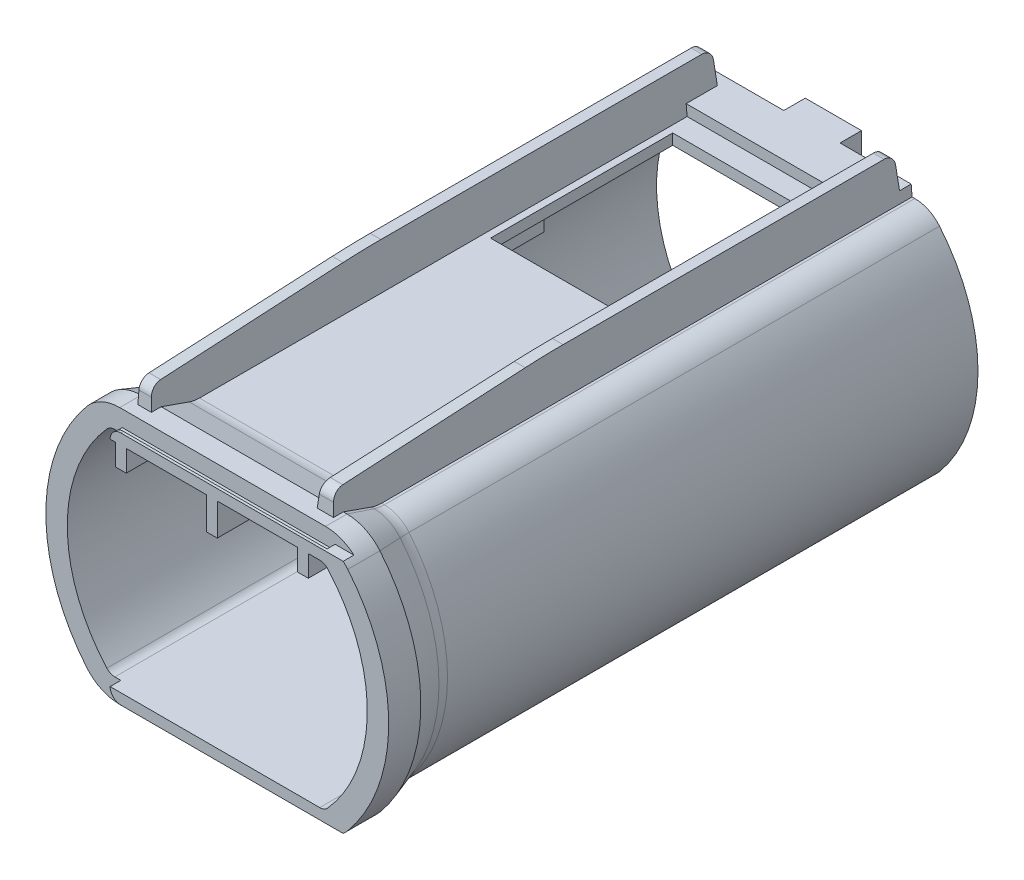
ISO-10303-21;
HEADER;
FILE_DESCRIPTION(('STEP AP214'),'2;1');
FILE_NAME('part.step','',(''),(''),'','','');
FILE_SCHEMA(('AUTOMOTIVE_DESIGN { 1 0 10303 214 1 1 1 1 }'));
ENDSEC;
DATA;
#1=APPLICATION_CONTEXT('core data for automotive mechanical design processes');
#2=APPLICATION_PROTOCOL_DEFINITION('international standard','automotive_design',2000,#1);
#3=PRODUCT_CONTEXT('',#1,'mechanical');
#4=PRODUCT('Part','Part','',(#3));
#5=PRODUCT_RELATED_PRODUCT_CATEGORY('part','',(#4));
#6=PRODUCT_DEFINITION_FORMATION('','',#4);
#7=PRODUCT_DEFINITION_CONTEXT('part definition',#1,'design');
#8=PRODUCT_DEFINITION('design','',#6,#7);
#9=PRODUCT_DEFINITION_SHAPE('','',#8);
#10=(LENGTH_UNIT() NAMED_UNIT(*) SI_UNIT(.MILLI.,.METRE.));
#11=(NAMED_UNIT(*) PLANE_ANGLE_UNIT() SI_UNIT($,.RADIAN.));
#12=(NAMED_UNIT(*) SI_UNIT($,.STERADIAN.) SOLID_ANGLE_UNIT());
#13=UNCERTAINTY_MEASURE_WITH_UNIT(LENGTH_MEASURE(1.E-05),#10,'distance_accuracy_value','');
#14=(GEOMETRIC_REPRESENTATION_CONTEXT(3) GLOBAL_UNCERTAINTY_ASSIGNED_CONTEXT((#13)) GLOBAL_UNIT_ASSIGNED_CONTEXT((#10,
#11,#12)) REPRESENTATION_CONTEXT('',''));
#15=CARTESIAN_POINT('',(0.,0.,0.));
#16=DIRECTION('',(0.,0.,1.));
#17=DIRECTION('',(1.,0.,0.));
#18=AXIS2_PLACEMENT_3D('',#15,#16,#17);
#19=CARTESIAN_POINT('',(-10.5,-11.,53.));
#20=DIRECTION('',(0.,1.,0.));
#21=DIRECTION('',(0.,0.,1.));
#22=AXIS2_PLACEMENT_3D('',#19,#20,#21);
#23=PLANE('',#22);
#24=DIRECTION('',(0.,0.,-1.));
#25=VECTOR('',#24,1.);
#26=CARTESIAN_POINT('',(9.60468635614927,-11.,53.));
#27=LINE('',#26,#25);
#28=CARTESIAN_POINT('',(9.60468635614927,-11.,0.));
#29=VERTEX_POINT('',#28);
#30=CARTESIAN_POINT('',(9.60468635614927,-11.,49.5131670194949));
#31=VERTEX_POINT('',#30);
#32=EDGE_CURVE('E1583',#29,#31,#27,.F.);
#33=ORIENTED_EDGE('',*,*,#32,.T.);
#34=DIRECTION('',(1.,0.,0.));
#35=VECTOR('',#34,1.);
#36=CARTESIAN_POINT('',(-9.60468635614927,-11.,49.5131670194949));
#37=LINE('',#36,#35);
#38=CARTESIAN_POINT('',(-9.60468635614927,-11.,49.5131670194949));
#39=VERTEX_POINT('',#38);
#40=EDGE_CURVE('E1111',#31,#39,#37,.F.);
#41=ORIENTED_EDGE('',*,*,#40,.T.);
#42=DIRECTION('',(0.,0.,-1.));
#43=VECTOR('',#42,1.);
#44=CARTESIAN_POINT('',(-9.60468635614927,-11.,53.));
#45=LINE('',#44,#43);
#46=CARTESIAN_POINT('',(-9.60468635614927,-11.,0.));
#47=VERTEX_POINT('',#46);
#48=EDGE_CURVE('E1581',#39,#47,#45,.T.);
#49=ORIENTED_EDGE('',*,*,#48,.T.);
#50=DIRECTION('',(1.,0.,0.));
#51=VECTOR('',#50,1.);
#52=CARTESIAN_POINT('',(-10.5,-11.,0.));
#53=LINE('',#52,#51);
#54=EDGE_CURVE('E1631',#47,#29,#53,.T.);
#55=ORIENTED_EDGE('',*,*,#54,.T.);
#56=EDGE_LOOP('',(#33,#41,#49,#55));
#57=FACE_BOUND('',#56,.T.);
#58=DIRECTION('',(-1.,0.,0.));
#59=VECTOR('',#58,1.);
#60=CARTESIAN_POINT('',(6.88279277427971,-11.0000000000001,18.2625098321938));
#61=LINE('',#60,#59);
#62=CARTESIAN_POINT('',(4.5,-11.0000000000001,18.2625098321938));
#63=VERTEX_POINT('',#62);
#64=CARTESIAN_POINT('',(-4.5,-11.0000000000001,18.2625098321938));
#65=VERTEX_POINT('',#64);
#66=EDGE_CURVE('E672',#63,#65,#61,.T.);
#67=ORIENTED_EDGE('',*,*,#66,.T.);
#68=DIRECTION('',(0.,0.,1.));
#69=VECTOR('',#68,1.);
#70=CARTESIAN_POINT('',(-4.5,-11.,19.));
#71=LINE('',#70,#69);
#72=CARTESIAN_POINT('',(-4.5,-11.,13.7374901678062));
#73=VERTEX_POINT('',#72);
#74=EDGE_CURVE('E757',#73,#65,#71,.T.);
#75=ORIENTED_EDGE('',*,*,#74,.F.);
#76=DIRECTION('',(-1.,0.,0.));
#77=VECTOR('',#76,1.);
#78=CARTESIAN_POINT('',(0.,-11.,13.7374901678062));
#79=LINE('',#78,#77);
#80=CARTESIAN_POINT('',(0.,-11.,13.7374901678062));
#81=VERTEX_POINT('',#80);
#82=EDGE_CURVE('E80',#81,#73,#79,.T.);
#83=ORIENTED_EDGE('',*,*,#82,.F.);
#84=DIRECTION('',(0.,0.,1.));
#85=VECTOR('',#84,1.);
#86=CARTESIAN_POINT('',(0.,-11.,13.));
#87=LINE('',#86,#85);
#88=CARTESIAN_POINT('',(0.,-11.,13.));
#89=VERTEX_POINT('',#88);
#90=EDGE_CURVE('E705',#89,#81,#87,.T.);
#91=ORIENTED_EDGE('',*,*,#90,.F.);
#92=DIRECTION('',(-1.,0.,0.));
#93=VECTOR('',#92,1.);
#94=CARTESIAN_POINT('',(-4.5,-11.,13.));
#95=LINE('',#94,#93);
#96=CARTESIAN_POINT('',(-5.5,-11.,13.));
#97=VERTEX_POINT('',#96);
#98=EDGE_CURVE('E88',#89,#97,#95,.T.);
#99=ORIENTED_EDGE('',*,*,#98,.T.);
#100=DIRECTION('',(0.,0.,1.));
#101=VECTOR('',#100,1.);
#102=CARTESIAN_POINT('',(-5.5,-11.,19.));
#103=LINE('',#102,#101);
#104=CARTESIAN_POINT('',(-5.5,-11.,19.));
#105=VERTEX_POINT('',#104);
#106=EDGE_CURVE('E756',#97,#105,#103,.T.);
#107=ORIENTED_EDGE('',*,*,#106,.T.);
#108=DIRECTION('',(-1.,0.,0.));
#109=VECTOR('',#108,1.);
#110=CARTESIAN_POINT('',(-4.5,-11.,19.));
#111=LINE('',#110,#109);
#112=CARTESIAN_POINT('',(5.5,-11.,19.));
#113=VERTEX_POINT('',#112);
#114=EDGE_CURVE('E777',#113,#105,#111,.T.);
#115=ORIENTED_EDGE('',*,*,#114,.F.);
#116=DIRECTION('',(0.,0.,1.));
#117=VECTOR('',#116,1.);
#118=CARTESIAN_POINT('',(5.5,-11.,19.));
#119=LINE('',#118,#117);
#120=CARTESIAN_POINT('',(5.5,-11.,13.));
#121=VERTEX_POINT('',#120);
#122=EDGE_CURVE('E726',#121,#113,#119,.T.);
#123=ORIENTED_EDGE('',*,*,#122,.F.);
#124=DIRECTION('',(1.,0.,0.));
#125=VECTOR('',#124,1.);
#126=CARTESIAN_POINT('',(4.5,-11.,13.));
#127=LINE('',#126,#125);
#128=CARTESIAN_POINT('',(4.5,-11.,13.));
#129=VERTEX_POINT('',#128);
#130=EDGE_CURVE('E747',#129,#121,#127,.T.);
#131=ORIENTED_EDGE('',*,*,#130,.F.);
#132=DIRECTION('',(0.,0.,1.));
#133=VECTOR('',#132,1.);
#134=CARTESIAN_POINT('',(4.5,-11.,19.));
#135=LINE('',#134,#133);
#136=EDGE_CURVE('E727',#129,#63,#135,.T.);
#137=ORIENTED_EDGE('',*,*,#136,.T.);
#138=EDGE_LOOP('',(#67,#75,#83,#91,#99,#107,#115,#123,#131,#137));
#139=FACE_BOUND('',#138,.T.);
#140=ADVANCED_FACE('F63',(#57,#139),#23,.F.);
#141=CARTESIAN_POINT('',(-4.5,-13.11479100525,16.));
#142=DIRECTION('',(-1.,0.,0.));
#143=DIRECTION('',(0.,0.,1.));
#144=AXIS2_PLACEMENT_3D('',#141,#142,#143);
#145=PLANE('',#144);
#146=CARTESIAN_POINT('',(-4.5,-13.11479100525,16.));
#147=DIRECTION('',(-1.,0.,0.));
#148=DIRECTION('',(0.,0.,1.));
#149=AXIS2_PLACEMENT_3D('',#146,#147,#148);
#150=CIRCLE('',#149,1.);
#151=CARTESIAN_POINT('',(-4.5,-13.11479100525,17.));
#152=VERTEX_POINT('',#151);
#153=EDGE_CURVE('E753',#152,#152,#150,.T.);
#154=ORIENTED_EDGE('',*,*,#153,.T.);
#155=EDGE_LOOP('',(#154));
#156=FACE_BOUND('',#155,.T.);
#157=DIRECTION('',(0.,0.,-1.));
#158=VECTOR('',#157,1.);
#159=CARTESIAN_POINT('',(-4.5,-13.265791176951,18.3812549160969));
#160=LINE('',#159,#158);
#161=CARTESIAN_POINT('',(-4.5,-13.265791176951,18.8812549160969));
#162=VERTEX_POINT('',#161);
#163=CARTESIAN_POINT('',(-4.5,-13.265791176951,18.3812549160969));
#164=VERTEX_POINT('',#163);
#165=EDGE_CURVE('E683',#162,#164,#160,.T.);
#166=ORIENTED_EDGE('',*,*,#165,.F.);
#167=CARTESIAN_POINT('',(-4.5,-13.11479100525,16.));
#168=DIRECTION('',(1.,0.,0.));
#169=DIRECTION('',(0.,0.,1.));
#170=AXIS2_PLACEMENT_3D('',#167,#168,#169);
#171=CIRCLE('',#170,2.88520899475);
#172=CARTESIAN_POINT('',(-4.5,-13.265791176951,13.1187450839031));
#173=VERTEX_POINT('',#172);
#174=EDGE_CURVE('E760',#162,#173,#171,.T.);
#175=ORIENTED_EDGE('',*,*,#174,.T.);
#176=DIRECTION('',(0.,0.,-1.));
#177=VECTOR('',#176,1.);
#178=CARTESIAN_POINT('',(-4.5,-13.265791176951,13.1187450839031));
#179=LINE('',#178,#177);
#180=CARTESIAN_POINT('',(-4.5,-13.265791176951,13.6187450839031));
#181=VERTEX_POINT('',#180);
#182=EDGE_CURVE('E676',#181,#173,#179,.T.);
#183=ORIENTED_EDGE('',*,*,#182,.F.);
#184=DIRECTION('',(0.,-0.998629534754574,-0.0523359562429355));
#185=VECTOR('',#184,1.);
#186=CARTESIAN_POINT('',(-4.5,-13.265791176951,13.6187450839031));
#187=LINE('',#186,#185);
#188=EDGE_CURVE('E702',#73,#181,#187,.T.);
#189=ORIENTED_EDGE('',*,*,#188,.F.);
#190=ORIENTED_EDGE('',*,*,#74,.T.);
#191=DIRECTION('',(0.,0.998629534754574,-0.052335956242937));
#192=VECTOR('',#191,1.);
#193=CARTESIAN_POINT('',(-4.5,-13.265791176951,18.3812549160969));
#194=LINE('',#193,#192);
#195=EDGE_CURVE('E685',#164,#65,#194,.T.);
#196=ORIENTED_EDGE('',*,*,#195,.F.);
#197=EDGE_LOOP('',(#166,#175,#183,#189,#190,#196));
#198=FACE_BOUND('',#197,.T.);
#199=ADVANCED_FACE('F1723',(#156,#198),#145,.F.);
#200=CARTESIAN_POINT('',(4.5,-13.11479100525,16.));
#201=DIRECTION('',(1.,0.,0.));
#202=DIRECTION('',(0.,0.,1.));
#203=AXIS2_PLACEMENT_3D('',#200,#201,#202);
#204=PLANE('',#203);
#205=CARTESIAN_POINT('',(4.5,-13.11479100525,16.));
#206=DIRECTION('',(1.,0.,0.));
#207=DIRECTION('',(0.,0.,-1.));
#208=AXIS2_PLACEMENT_3D('',#205,#206,#207);
#209=CIRCLE('',#208,1.);
#210=CARTESIAN_POINT('',(4.5,-13.11479100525,15.));
#211=VERTEX_POINT('',#210);
#212=EDGE_CURVE('E723',#211,#211,#209,.F.);
#213=ORIENTED_EDGE('',*,*,#212,.F.);
#214=EDGE_LOOP('',(#213));
#215=FACE_BOUND('',#214,.T.);
#216=DIRECTION('',(0.,0.,-1.));
#217=VECTOR('',#216,1.);
#218=CARTESIAN_POINT('',(4.5,-13.265791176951,18.3812549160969));
#219=LINE('',#218,#217);
#220=CARTESIAN_POINT('',(4.5,-13.265791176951,18.8812549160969));
#221=VERTEX_POINT('',#220);
#222=CARTESIAN_POINT('',(4.5,-13.265791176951,18.3812549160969));
#223=VERTEX_POINT('',#222);
#224=EDGE_CURVE('E677',#221,#223,#219,.T.);
#225=ORIENTED_EDGE('',*,*,#224,.T.);
#226=DIRECTION('',(0.,0.998629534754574,-0.052335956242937));
#227=VECTOR('',#226,1.);
#228=CARTESIAN_POINT('',(4.5,-13.265791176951,18.3812549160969));
#229=LINE('',#228,#227);
#230=EDGE_CURVE('E666',#223,#63,#229,.T.);
#231=ORIENTED_EDGE('',*,*,#230,.T.);
#232=ORIENTED_EDGE('',*,*,#136,.F.);
#233=DIRECTION('',(0.,0.998629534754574,-0.052335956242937));
#234=VECTOR('',#233,1.);
#235=CARTESIAN_POINT('',(4.5,-11.,13.));
#236=LINE('',#235,#234);
#237=CARTESIAN_POINT('',(4.5,-13.265791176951,13.1187450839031));
#238=VERTEX_POINT('',#237);
#239=EDGE_CURVE('E729',#238,#129,#236,.T.);
#240=ORIENTED_EDGE('',*,*,#239,.F.);
#241=CARTESIAN_POINT('',(4.5,-13.11479100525,16.));
#242=DIRECTION('',(1.,0.,0.));
#243=DIRECTION('',(0.,0.,1.));
#244=AXIS2_PLACEMENT_3D('',#241,#242,#243);
#245=CIRCLE('',#244,2.88520899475);
#246=EDGE_CURVE('E691',#221,#238,#245,.T.);
#247=ORIENTED_EDGE('',*,*,#246,.F.);
#248=EDGE_LOOP('',(#225,#231,#232,#240,#247));
#249=FACE_BOUND('',#248,.T.);
#250=ADVANCED_FACE('F688',(#215,#249),#204,.F.);
#251=CARTESIAN_POINT('',(5.5,-13.11479100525,16.));
#252=DIRECTION('',(1.,0.,0.));
#253=DIRECTION('',(0.,0.,1.));
#254=AXIS2_PLACEMENT_3D('',#251,#252,#253);
#255=PLANE('',#254);
#256=ORIENTED_EDGE('',*,*,#122,.T.);
#257=DIRECTION('',(0.,-0.998629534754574,-0.052335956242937));
#258=VECTOR('',#257,1.);
#259=CARTESIAN_POINT('',(5.5,-13.265791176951,18.8812549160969));
#260=LINE('',#259,#258);
#261=CARTESIAN_POINT('',(5.5,-13.265791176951,18.8812549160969));
#262=VERTEX_POINT('',#261);
#263=EDGE_CURVE('E730',#113,#262,#260,.T.);
#264=ORIENTED_EDGE('',*,*,#263,.T.);
#265=CARTESIAN_POINT('',(5.5,-13.11479100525,16.));
#266=DIRECTION('',(1.,0.,0.));
#267=DIRECTION('',(0.,0.,1.));
#268=AXIS2_PLACEMENT_3D('',#265,#266,#267);
#269=CIRCLE('',#268,2.88520899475);
#270=CARTESIAN_POINT('',(5.5,-13.265791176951,13.1187450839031));
#271=VERTEX_POINT('',#270);
#272=EDGE_CURVE('E739',#262,#271,#269,.T.);
#273=ORIENTED_EDGE('',*,*,#272,.T.);
#274=DIRECTION('',(0.,0.998629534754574,-0.052335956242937));
#275=VECTOR('',#274,1.);
#276=CARTESIAN_POINT('',(5.5,-11.,13.));
#277=LINE('',#276,#275);
#278=EDGE_CURVE('E737',#271,#121,#277,.T.);
#279=ORIENTED_EDGE('',*,*,#278,.T.);
#280=EDGE_LOOP('',(#256,#264,#273,#279));
#281=FACE_BOUND('',#280,.T.);
#282=CARTESIAN_POINT('',(5.5,-13.11479100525,16.));
#283=DIRECTION('',(-1.,0.,0.));
#284=DIRECTION('',(0.,0.,1.));
#285=AXIS2_PLACEMENT_3D('',#282,#283,#284);
#286=CIRCLE('',#285,1.);
#287=CARTESIAN_POINT('',(5.5,-13.11479100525,17.));
#288=VERTEX_POINT('',#287);
#289=EDGE_CURVE('E720',#288,#288,#286,.T.);
#290=ORIENTED_EDGE('',*,*,#289,.T.);
#291=EDGE_LOOP('',(#290));
#292=FACE_BOUND('',#291,.T.);
#293=ADVANCED_FACE('F2539',(#281,#292),#255,.T.);
#294=CARTESIAN_POINT('',(0.,0.,0.));
#295=DIRECTION('',(0.,0.,1.));
#296=DIRECTION('',(1.,0.,0.));
#297=AXIS2_PLACEMENT_3D('',#294,#295,#296);
#298=PLANE('',#297);
#299=DIRECTION('',(0.,1.,0.));
#300=VECTOR('',#299,1.);
#301=CARTESIAN_POINT('',(-2.625,12.,0.));
#302=LINE('',#301,#300);
#303=CARTESIAN_POINT('',(-2.625,10.,0.));
#304=VERTEX_POINT('',#303);
#305=CARTESIAN_POINT('',(-2.625,12.,0.));
#306=VERTEX_POINT('',#305);
#307=EDGE_CURVE('E784',#304,#306,#302,.T.);
#308=ORIENTED_EDGE('',*,*,#307,.F.);
#309=DIRECTION('',(-1.,0.,0.));
#310=VECTOR('',#309,1.);
#311=CARTESIAN_POINT('',(-10.5,10.,0.));
#312=LINE('',#311,#310);
#313=CARTESIAN_POINT('',(-10.0623058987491,10.,0.));
#314=VERTEX_POINT('',#313);
#315=EDGE_CURVE('E799',#304,#314,#312,.T.);
#316=ORIENTED_EDGE('',*,*,#315,.T.);
#317=CARTESIAN_POINT('',(-10.0623058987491,9.,0.));
#318=DIRECTION('',(0.,0.,1.));
#319=DIRECTION('',(1.,0.,0.));
#320=AXIS2_PLACEMENT_3D('',#317,#318,#319);
#321=CIRCLE('',#320,1.);
#322=CARTESIAN_POINT('',(-10.807661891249,9.66666666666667,0.));
#323=VERTEX_POINT('',#322);
#324=EDGE_CURVE('E1553',#314,#323,#321,.T.);
#325=ORIENTED_EDGE('',*,*,#324,.T.);
#326=CARTESIAN_POINT('',(0.,0.,0.));
#327=DIRECTION('',(0.,0.,1.));
#328=DIRECTION('',(1.,0.,0.));
#329=AXIS2_PLACEMENT_3D('',#326,#327,#328);
#330=CIRCLE('',#329,14.5);
#331=CARTESIAN_POINT('',(-10.807661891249,-9.66666666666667,0.));
#332=VERTEX_POINT('',#331);
#333=EDGE_CURVE('E838',#323,#332,#330,.T.);
#334=ORIENTED_EDGE('',*,*,#333,.T.);
#335=CARTESIAN_POINT('',(-10.0623058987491,-9.,0.));
#336=DIRECTION('',(0.,0.,1.));
#337=DIRECTION('',(1.,0.,0.));
#338=AXIS2_PLACEMENT_3D('',#335,#336,#337);
#339=CIRCLE('',#338,1.);
#340=CARTESIAN_POINT('',(-10.0623058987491,-10.,0.));
#341=VERTEX_POINT('',#340);
#342=EDGE_CURVE('E1557',#332,#341,#339,.T.);
#343=ORIENTED_EDGE('',*,*,#342,.T.);
#344=DIRECTION('',(1.,0.,0.));
#345=VECTOR('',#344,1.);
#346=CARTESIAN_POINT('',(-10.5,-10.,0.));
#347=LINE('',#346,#345);
#348=CARTESIAN_POINT('',(10.0623058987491,-10.,0.));
#349=VERTEX_POINT('',#348);
#350=EDGE_CURVE('E1662',#341,#349,#347,.T.);
#351=ORIENTED_EDGE('',*,*,#350,.T.);
#352=CARTESIAN_POINT('',(10.0623058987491,-9.,0.));
#353=DIRECTION('',(0.,0.,1.));
#354=DIRECTION('',(1.,0.,0.));
#355=AXIS2_PLACEMENT_3D('',#352,#353,#354);
#356=CIRCLE('',#355,1.);
#357=CARTESIAN_POINT('',(10.807661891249,-9.66666666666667,0.));
#358=VERTEX_POINT('',#357);
#359=EDGE_CURVE('E1554',#349,#358,#356,.T.);
#360=ORIENTED_EDGE('',*,*,#359,.T.);
#361=CARTESIAN_POINT('',(0.,0.,0.));
#362=DIRECTION('',(0.,0.,1.));
#363=DIRECTION('',(1.,0.,0.));
#364=AXIS2_PLACEMENT_3D('',#361,#362,#363);
#365=CIRCLE('',#364,14.5);
#366=CARTESIAN_POINT('',(10.807661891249,9.66666666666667,0.));
#367=VERTEX_POINT('',#366);
#368=EDGE_CURVE('E837',#358,#367,#365,.T.);
#369=ORIENTED_EDGE('',*,*,#368,.T.);
#370=CARTESIAN_POINT('',(10.0623058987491,9.,0.));
#371=DIRECTION('',(0.,0.,1.));
#372=DIRECTION('',(1.,0.,0.));
#373=AXIS2_PLACEMENT_3D('',#370,#371,#372);
#374=CIRCLE('',#373,1.);
#375=CARTESIAN_POINT('',(10.0623058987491,10.,0.));
#376=VERTEX_POINT('',#375);
#377=EDGE_CURVE('E1565',#367,#376,#374,.T.);
#378=ORIENTED_EDGE('',*,*,#377,.T.);
#379=CARTESIAN_POINT('',(2.625,10.,0.));
#380=VERTEX_POINT('',#379);
#381=EDGE_CURVE('E836',#376,#380,#312,.T.);
#382=ORIENTED_EDGE('',*,*,#381,.T.);
#383=DIRECTION('',(0.,-1.,0.));
#384=VECTOR('',#383,1.);
#385=CARTESIAN_POINT('',(2.625,12.,0.));
#386=LINE('',#385,#384);
#387=CARTESIAN_POINT('',(2.625,12.,0.));
#388=VERTEX_POINT('',#387);
#389=EDGE_CURVE('E779',#388,#380,#386,.T.);
#390=ORIENTED_EDGE('',*,*,#389,.F.);
#391=DIRECTION('',(-1.,0.,0.));
#392=VECTOR('',#391,1.);
#393=CARTESIAN_POINT('',(-9.,12.,0.));
#394=LINE('',#393,#392);
#395=CARTESIAN_POINT('',(9.26246599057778,12.,0.));
#396=VERTEX_POINT('',#395);
#397=EDGE_CURVE('E857',#396,#388,#394,.T.);
#398=ORIENTED_EDGE('',*,*,#397,.F.);
#399=DIRECTION('',(-0.0871557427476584,0.996194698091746,0.));
#400=VECTOR('',#399,1.);
#401=CARTESIAN_POINT('',(10.2339962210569,0.895358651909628,0.));
#402=LINE('',#401,#400);
#403=CARTESIAN_POINT('',(9.3499546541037,11.,0.));
#404=VERTEX_POINT('',#403);
#405=EDGE_CURVE('E881',#396,#404,#402,.F.);
#406=ORIENTED_EDGE('',*,*,#405,.T.);
#407=DIRECTION('',(-1.,0.,0.));
#408=VECTOR('',#407,1.);
#409=CARTESIAN_POINT('',(-10.5,11.,0.));
#410=LINE('',#409,#408);
#411=CARTESIAN_POINT('',(9.60468635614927,11.,0.));
#412=VERTEX_POINT('',#411);
#413=EDGE_CURVE('E1626',#412,#404,#410,.T.);
#414=ORIENTED_EDGE('',*,*,#413,.F.);
#415=CARTESIAN_POINT('',(9.60468635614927,8.,0.));
#416=DIRECTION('',(0.,0.,1.));
#417=DIRECTION('',(1.,0.,0.));
#418=AXIS2_PLACEMENT_3D('',#415,#416,#417);
#419=CIRCLE('',#418,3.);
#420=CARTESIAN_POINT('',(11.9098110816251,9.92,0.));
#421=VERTEX_POINT('',#420);
#422=EDGE_CURVE('E1577',#412,#421,#419,.F.);
#423=ORIENTED_EDGE('',*,*,#422,.T.);
#424=CARTESIAN_POINT('',(0.,0.,0.));
#425=DIRECTION('',(0.,0.,1.));
#426=DIRECTION('',(1.,0.,0.));
#427=AXIS2_PLACEMENT_3D('',#424,#425,#426);
#428=CIRCLE('',#427,15.5);
#429=CARTESIAN_POINT('',(11.9098110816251,-9.92,0.));
#430=VERTEX_POINT('',#429);
#431=EDGE_CURVE('E1627',#430,#421,#428,.T.);
#432=ORIENTED_EDGE('',*,*,#431,.F.);
#433=CARTESIAN_POINT('',(9.60468635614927,-8.,0.));
#434=DIRECTION('',(0.,0.,1.));
#435=DIRECTION('',(1.,0.,0.));
#436=AXIS2_PLACEMENT_3D('',#433,#434,#435);
#437=CIRCLE('',#436,3.);
#438=EDGE_CURVE('E1579',#430,#29,#437,.F.);
#439=ORIENTED_EDGE('',*,*,#438,.T.);
#440=ORIENTED_EDGE('',*,*,#54,.F.);
#441=CARTESIAN_POINT('',(-9.60468635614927,-8.,0.));
#442=DIRECTION('',(0.,0.,1.));
#443=DIRECTION('',(1.,0.,0.));
#444=AXIS2_PLACEMENT_3D('',#441,#442,#443);
#445=CIRCLE('',#444,3.);
#446=CARTESIAN_POINT('',(-11.9098110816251,-9.92,0.));
#447=VERTEX_POINT('',#446);
#448=EDGE_CURVE('E1575',#47,#447,#445,.F.);
#449=ORIENTED_EDGE('',*,*,#448,.T.);
#450=CARTESIAN_POINT('',(0.,0.,0.));
#451=DIRECTION('',(0.,0.,1.));
#452=DIRECTION('',(1.,0.,0.));
#453=AXIS2_PLACEMENT_3D('',#450,#451,#452);
#454=CIRCLE('',#453,15.5);
#455=CARTESIAN_POINT('',(-11.9098110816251,9.92,0.));
#456=VERTEX_POINT('',#455);
#457=EDGE_CURVE('E1601',#456,#447,#454,.T.);
#458=ORIENTED_EDGE('',*,*,#457,.F.);
#459=CARTESIAN_POINT('',(-9.60468635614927,8.,0.));
#460=DIRECTION('',(0.,0.,1.));
#461=DIRECTION('',(1.,0.,0.));
#462=AXIS2_PLACEMENT_3D('',#459,#460,#461);
#463=CIRCLE('',#462,3.);
#464=CARTESIAN_POINT('',(-9.60468635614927,11.,0.));
#465=VERTEX_POINT('',#464);
#466=EDGE_CURVE('E1572',#456,#465,#463,.F.);
#467=ORIENTED_EDGE('',*,*,#466,.T.);
#468=CARTESIAN_POINT('',(-9.,11.,0.));
#469=VERTEX_POINT('',#468);
#470=EDGE_CURVE('E1623',#469,#465,#410,.T.);
#471=ORIENTED_EDGE('',*,*,#470,.F.);
#472=DIRECTION('',(0.,-1.,0.));
#473=VECTOR('',#472,1.);
#474=CARTESIAN_POINT('',(-9.,12.,0.));
#475=LINE('',#474,#473);
#476=CARTESIAN_POINT('',(-9.,12.,0.));
#477=VERTEX_POINT('',#476);
#478=EDGE_CURVE('E847',#477,#469,#475,.T.);
#479=ORIENTED_EDGE('',*,*,#478,.F.);
#480=EDGE_CURVE('E854',#306,#477,#394,.T.);
#481=ORIENTED_EDGE('',*,*,#480,.F.);
#482=EDGE_LOOP('',(#308,#316,#325,#334,#343,#351,#360,#369,#378,#382,#390,#398,#406,#414,#423,
#432,#439,#440,#449,#458,#467,#471,#479,#481));
#483=FACE_BOUND('',#482,.T.);
#484=ADVANCED_FACE('F1629',(#483),#298,.F.);
#485=CARTESIAN_POINT('',(-10.5,10.,53.));
#486=DIRECTION('',(0.,-1.,0.));
#487=DIRECTION('',(0.,0.,-1.));
#488=AXIS2_PLACEMENT_3D('',#485,#486,#487);
#489=PLANE('',#488);
#490=DIRECTION('',(-1.,0.,0.));
#491=VECTOR('',#490,1.);
#492=CARTESIAN_POINT('',(-10.5,10.,23.));
#493=LINE('',#492,#491);
#494=CARTESIAN_POINT('',(7.24607744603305,10.,23.));
#495=VERTEX_POINT('',#494);
#496=CARTESIAN_POINT('',(0.5,10.,23.));
#497=VERTEX_POINT('',#496);
#498=EDGE_CURVE('E1499',#495,#497,#493,.T.);
#499=ORIENTED_EDGE('',*,*,#498,.F.);
#500=DIRECTION('',(0.,0.,1.));
#501=VECTOR('',#500,1.);
#502=CARTESIAN_POINT('',(7.24607744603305,10.,53.));
#503=LINE('',#502,#501);
#504=CARTESIAN_POINT('',(7.24607744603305,10.,6.));
#505=VERTEX_POINT('',#504);
#506=EDGE_CURVE('E1487',#505,#495,#503,.T.);
#507=ORIENTED_EDGE('',*,*,#506,.F.);
#508=DIRECTION('',(1.,0.,0.));
#509=VECTOR('',#508,1.);
#510=CARTESIAN_POINT('',(-10.5,10.,6.));
#511=LINE('',#510,#509);
#512=CARTESIAN_POINT('',(-6.99607744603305,10.,6.));
#513=VERTEX_POINT('',#512);
#514=EDGE_CURVE('E1497',#513,#505,#511,.T.);
#515=ORIENTED_EDGE('',*,*,#514,.F.);
#516=DIRECTION('',(0.,0.,-1.));
#517=VECTOR('',#516,1.);
#518=CARTESIAN_POINT('',(-6.99607744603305,10.,53.));
#519=LINE('',#518,#517);
#520=CARTESIAN_POINT('',(-6.99607744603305,10.,23.));
#521=VERTEX_POINT('',#520);
#522=EDGE_CURVE('E1495',#521,#513,#519,.T.);
#523=ORIENTED_EDGE('',*,*,#522,.F.);
#524=CARTESIAN_POINT('',(-0.5,10.,23.));
#525=VERTEX_POINT('',#524);
#526=EDGE_CURVE('E1503',#525,#521,#493,.T.);
#527=ORIENTED_EDGE('',*,*,#526,.F.);
#528=DIRECTION('',(0.,0.,1.));
#529=VECTOR('',#528,1.);
#530=CARTESIAN_POINT('',(-0.5,10.,13.8377251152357));
#531=LINE('',#530,#529);
#532=CARTESIAN_POINT('',(-0.5,10.,56.));
#533=VERTEX_POINT('',#532);
#534=EDGE_CURVE('E1440',#525,#533,#531,.T.);
#535=ORIENTED_EDGE('',*,*,#534,.T.);
#536=DIRECTION('',(-1.,0.,0.));
#537=VECTOR('',#536,1.);
#538=CARTESIAN_POINT('',(10.0623058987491,10.,56.));
#539=LINE('',#538,#537);
#540=CARTESIAN_POINT('',(-7.99607744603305,10.,56.));
#541=VERTEX_POINT('',#540);
#542=EDGE_CURVE('E1541',#533,#541,#539,.T.);
#543=ORIENTED_EDGE('',*,*,#542,.T.);
#544=DIRECTION('',(0.,0.,1.));
#545=VECTOR('',#544,1.);
#546=CARTESIAN_POINT('',(-7.99607744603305,10.,-2.23606274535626));
#547=LINE('',#546,#545);
#548=CARTESIAN_POINT('',(-7.99607744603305,10.,17.));
#549=VERTEX_POINT('',#548);
#550=EDGE_CURVE('E1427',#549,#541,#547,.T.);
#551=ORIENTED_EDGE('',*,*,#550,.F.);
#552=DIRECTION('',(-1.,0.,0.));
#553=VECTOR('',#552,1.);
#554=CARTESIAN_POINT('',(-8.99607744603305,10.,17.));
#555=LINE('',#554,#553);
#556=CARTESIAN_POINT('',(-8.99607744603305,10.,17.));
#557=VERTEX_POINT('',#556);
#558=EDGE_CURVE('E1443',#549,#557,#555,.T.);
#559=ORIENTED_EDGE('',*,*,#558,.T.);
#560=DIRECTION('',(0.,0.,1.));
#561=VECTOR('',#560,1.);
#562=CARTESIAN_POINT('',(-8.99607744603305,10.,-2.23606274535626));
#563=LINE('',#562,#561);
#564=CARTESIAN_POINT('',(-8.99607744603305,10.,56.));
#565=VERTEX_POINT('',#564);
#566=EDGE_CURVE('E1421',#557,#565,#563,.T.);
#567=ORIENTED_EDGE('',*,*,#566,.T.);
#568=CARTESIAN_POINT('',(-9.5,10.,56.));
#569=VERTEX_POINT('',#568);
#570=EDGE_CURVE('E1016',#565,#569,#539,.T.);
#571=ORIENTED_EDGE('',*,*,#570,.T.);
#572=DIRECTION('',(0.,0.,1.));
#573=VECTOR('',#572,1.);
#574=CARTESIAN_POINT('',(-9.5,10.,55.));
#575=LINE('',#574,#573);
#576=CARTESIAN_POINT('',(-9.5,10.,55.));
#577=VERTEX_POINT('',#576);
#578=EDGE_CURVE('E960',#577,#569,#575,.T.);
#579=ORIENTED_EDGE('',*,*,#578,.F.);
#580=DIRECTION('',(1.,0.,0.));
#581=VECTOR('',#580,1.);
#582=CARTESIAN_POINT('',(-10.0623058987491,10.,55.));
#583=LINE('',#582,#581);
#584=CARTESIAN_POINT('',(-10.0623058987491,10.,55.));
#585=VERTEX_POINT('',#584);
#586=EDGE_CURVE('E1374',#585,#577,#583,.T.);
#587=ORIENTED_EDGE('',*,*,#586,.F.);
#588=DIRECTION('',(0.,0.,1.));
#589=VECTOR('',#588,1.);
#590=CARTESIAN_POINT('',(-10.0623058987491,10.,0.));
#591=LINE('',#590,#589);
#592=EDGE_CURVE('E833',#585,#314,#591,.F.);
#593=ORIENTED_EDGE('',*,*,#592,.T.);
#594=ORIENTED_EDGE('',*,*,#315,.F.);
#595=DIRECTION('',(0.,0.,1.));
#596=VECTOR('',#595,1.);
#597=CARTESIAN_POINT('',(-2.625,10.,-2.));
#598=LINE('',#597,#596);
#599=CARTESIAN_POINT('',(-2.625,10.,-2.));
#600=VERTEX_POINT('',#599);
#601=EDGE_CURVE('E806',#600,#304,#598,.T.);
#602=ORIENTED_EDGE('',*,*,#601,.F.);
#603=DIRECTION('',(-1.,0.,0.));
#604=VECTOR('',#603,1.);
#605=CARTESIAN_POINT('',(-2.625,10.,-2.));
#606=LINE('',#605,#604);
#607=CARTESIAN_POINT('',(2.625,10.,-2.));
#608=VERTEX_POINT('',#607);
#609=EDGE_CURVE('E786',#608,#600,#606,.T.);
#610=ORIENTED_EDGE('',*,*,#609,.F.);
#611=DIRECTION('',(0.,0.,1.));
#612=VECTOR('',#611,1.);
#613=CARTESIAN_POINT('',(2.625,10.,-2.));
#614=LINE('',#613,#612);
#615=EDGE_CURVE('E802',#608,#380,#614,.T.);
#616=ORIENTED_EDGE('',*,*,#615,.T.);
#617=ORIENTED_EDGE('',*,*,#381,.F.);
#618=DIRECTION('',(0.,0.,1.));
#619=VECTOR('',#618,1.);
#620=CARTESIAN_POINT('',(10.0623058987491,10.,53.));
#621=LINE('',#620,#619);
#622=CARTESIAN_POINT('',(10.0623058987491,10.,56.));
#623=VERTEX_POINT('',#622);
#624=EDGE_CURVE('E1555',#376,#623,#621,.T.);
#625=ORIENTED_EDGE('',*,*,#624,.T.);
#626=CARTESIAN_POINT('',(8.99607744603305,10.,56.));
#627=VERTEX_POINT('',#626);
#628=EDGE_CURVE('E1017',#623,#627,#539,.T.);
#629=ORIENTED_EDGE('',*,*,#628,.T.);
#630=DIRECTION('',(0.,0.,1.));
#631=VECTOR('',#630,1.);
#632=CARTESIAN_POINT('',(8.99607744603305,10.,-2.23606274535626));
#633=LINE('',#632,#631);
#634=CARTESIAN_POINT('',(8.99607744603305,10.,17.));
#635=VERTEX_POINT('',#634);
#636=EDGE_CURVE('E1467',#635,#627,#633,.T.);
#637=ORIENTED_EDGE('',*,*,#636,.F.);
#638=DIRECTION('',(1.,0.,0.));
#639=VECTOR('',#638,1.);
#640=CARTESIAN_POINT('',(8.99607744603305,10.,17.));
#641=LINE('',#640,#639);
#642=CARTESIAN_POINT('',(7.99607744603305,10.,17.));
#643=VERTEX_POINT('',#642);
#644=EDGE_CURVE('E1463',#643,#635,#641,.T.);
#645=ORIENTED_EDGE('',*,*,#644,.F.);
#646=DIRECTION('',(0.,0.,1.));
#647=VECTOR('',#646,1.);
#648=CARTESIAN_POINT('',(7.99607744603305,10.,-2.23606274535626));
#649=LINE('',#648,#647);
#650=CARTESIAN_POINT('',(7.99607744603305,10.,56.));
#651=VERTEX_POINT('',#650);
#652=EDGE_CURVE('E1470',#643,#651,#649,.T.);
#653=ORIENTED_EDGE('',*,*,#652,.T.);
#654=CARTESIAN_POINT('',(0.5,10.,56.));
#655=VERTEX_POINT('',#654);
#656=EDGE_CURVE('E1020',#651,#655,#539,.T.);
#657=ORIENTED_EDGE('',*,*,#656,.T.);
#658=DIRECTION('',(0.,0.,1.));
#659=VECTOR('',#658,1.);
#660=CARTESIAN_POINT('',(0.5,10.,13.8377251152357));
#661=LINE('',#660,#659);
#662=EDGE_CURVE('E1452',#497,#655,#661,.T.);
#663=ORIENTED_EDGE('',*,*,#662,.F.);
#664=EDGE_LOOP('',(#499,#507,#515,#523,#527,#535,#543,#551,#559,#567,#571,#579,#587,#593,#594,
#602,#610,#616,#617,#625,#629,#637,#645,#653,#657,#663));
#665=FACE_BOUND('',#664,.T.);
#666=ADVANCED_FACE('F829',(#665),#489,.T.);
#667=CARTESIAN_POINT('',(12.2504376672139,11.,55.));
#668=DIRECTION('',(0.,-1.,0.));
#669=DIRECTION('',(1.,0.,0.));
#670=AXIS2_PLACEMENT_3D('',#667,#668,#669);
#671=PLANE('',#670);
#672=DIRECTION('',(0.,0.,1.));
#673=VECTOR('',#672,1.);
#674=CARTESIAN_POINT('',(10.5,11.,55.));
#675=LINE('',#674,#673);
#676=CARTESIAN_POINT('',(10.5,11.,55.));
#677=VERTEX_POINT('',#676);
#678=CARTESIAN_POINT('',(10.5,11.,55.75));
#679=VERTEX_POINT('',#678);
#680=EDGE_CURVE('E951',#677,#679,#675,.T.);
#681=ORIENTED_EDGE('',*,*,#680,.T.);
#682=DIRECTION('',(-1.,0.,0.));
#683=VECTOR('',#682,1.);
#684=CARTESIAN_POINT('',(-9.5,11.,55.75));
#685=LINE('',#684,#683);
#686=CARTESIAN_POINT('',(-8.5,11.,55.75));
#687=VERTEX_POINT('',#686);
#688=EDGE_CURVE('E939',#679,#687,#685,.T.);
#689=ORIENTED_EDGE('',*,*,#688,.T.);
#690=DIRECTION('',(0.,0.,1.));
#691=VECTOR('',#690,1.);
#692=CARTESIAN_POINT('',(-8.5,11.,55.));
#693=LINE('',#692,#691);
#694=CARTESIAN_POINT('',(-8.5,11.,56.));
#695=VERTEX_POINT('',#694);
#696=EDGE_CURVE('E948',#687,#695,#693,.T.);
#697=ORIENTED_EDGE('',*,*,#696,.T.);
#698=DIRECTION('',(1.,0.,0.));
#699=VECTOR('',#698,1.);
#700=CARTESIAN_POINT('',(12.2504376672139,11.,56.));
#701=LINE('',#700,#699);
#702=CARTESIAN_POINT('',(12.2504376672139,11.,56.));
#703=VERTEX_POINT('',#702);
#704=EDGE_CURVE('E1338',#695,#703,#701,.T.);
#705=ORIENTED_EDGE('',*,*,#704,.T.);
#706=DIRECTION('',(0.,0.,1.));
#707=VECTOR('',#706,1.);
#708=CARTESIAN_POINT('',(12.2504376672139,11.,55.));
#709=LINE('',#708,#707);
#710=CARTESIAN_POINT('',(12.2504376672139,11.,55.));
#711=VERTEX_POINT('',#710);
#712=EDGE_CURVE('E959',#711,#703,#709,.T.);
#713=ORIENTED_EDGE('',*,*,#712,.F.);
#714=DIRECTION('',(1.,0.,0.));
#715=VECTOR('',#714,1.);
#716=CARTESIAN_POINT('',(12.2504376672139,11.,55.));
#717=LINE('',#716,#715);
#718=EDGE_CURVE('E1367',#677,#711,#717,.T.);
#719=ORIENTED_EDGE('',*,*,#718,.F.);
#720=EDGE_LOOP('',(#681,#689,#697,#705,#713,#719));
#721=FACE_BOUND('',#720,.T.);
#722=ADVANCED_FACE('F947',(#721),#671,.F.);
#723=CARTESIAN_POINT('',(-8.5,10.,55.));
#724=DIRECTION('',(0.,0.,1.));
#725=DIRECTION('',(1.,0.,0.));
#726=AXIS2_PLACEMENT_3D('',#723,#724,#725);
#727=CYLINDRICAL_SURFACE('',#726,1.);
#728=CARTESIAN_POINT('',(-8.5,10.,55.75));
#729=DIRECTION('',(0.,0.,-1.));
#730=DIRECTION('',(-1.,0.,0.));
#731=AXIS2_PLACEMENT_3D('',#728,#729,#730);
#732=CIRCLE('',#731,1.);
#733=CARTESIAN_POINT('',(-9.36602540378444,10.5,55.75));
#734=VERTEX_POINT('',#733);
#735=EDGE_CURVE('E72',#734,#687,#732,.T.);
#736=ORIENTED_EDGE('',*,*,#735,.F.);
#737=DIRECTION('',(0.,0.,1.));
#738=VECTOR('',#737,1.);
#739=CARTESIAN_POINT('',(-9.36602540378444,10.5,55.));
#740=LINE('',#739,#738);
#741=CARTESIAN_POINT('',(-9.36602540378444,10.5,55.));
#742=VERTEX_POINT('',#741);
#743=EDGE_CURVE('E1398',#734,#742,#740,.F.);
#744=ORIENTED_EDGE('',*,*,#743,.T.);
#745=CARTESIAN_POINT('',(-8.5,10.,55.));
#746=DIRECTION('',(0.,0.,-1.));
#747=DIRECTION('',(1.,0.,0.));
#748=AXIS2_PLACEMENT_3D('',#745,#746,#747);
#749=CIRCLE('',#748,1.);
#750=EDGE_CURVE('E1369',#577,#742,#749,.T.);
#751=ORIENTED_EDGE('',*,*,#750,.F.);
#752=ORIENTED_EDGE('',*,*,#578,.T.);
#753=CARTESIAN_POINT('',(-8.5,10.,56.));
#754=DIRECTION('',(0.,0.,-1.));
#755=DIRECTION('',(1.,0.,0.));
#756=AXIS2_PLACEMENT_3D('',#753,#754,#755);
#757=CIRCLE('',#756,1.);
#758=EDGE_CURVE('E957',#569,#695,#757,.T.);
#759=ORIENTED_EDGE('',*,*,#758,.T.);
#760=ORIENTED_EDGE('',*,*,#696,.F.);
#761=EDGE_LOOP('',(#736,#744,#751,#752,#759,#760));
#762=FACE_BOUND('',#761,.T.);
#763=ADVANCED_FACE('F954',(#762),#727,.T.);
#764=CARTESIAN_POINT('',(0.,0.,53.));
#765=DIRECTION('',(0.,0.,-1.));
#766=DIRECTION('',(-1.,0.,0.));
#767=AXIS2_PLACEMENT_3D('',#764,#765,#766);
#768=CYLINDRICAL_SURFACE('',#767,14.5);
#769=DIRECTION('',(0.,0.,-1.));
#770=VECTOR('',#769,1.);
#771=CARTESIAN_POINT('',(-10.807661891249,9.66666666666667,53.));
#772=LINE('',#771,#770);
#773=CARTESIAN_POINT('',(-10.807661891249,9.66666666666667,55.));
#774=VERTEX_POINT('',#773);
#775=EDGE_CURVE('E1648',#323,#774,#772,.F.);
#776=ORIENTED_EDGE('',*,*,#775,.T.);
#777=CARTESIAN_POINT('',(0.,0.,55.));
#778=DIRECTION('',(0.,0.,-1.));
#779=DIRECTION('',(1.,0.,0.));
#780=AXIS2_PLACEMENT_3D('',#777,#778,#779);
#781=CIRCLE('',#780,14.5);
#782=CARTESIAN_POINT('',(-10.807661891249,-9.66666666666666,55.));
#783=VERTEX_POINT('',#782);
#784=EDGE_CURVE('E1379',#783,#774,#781,.T.);
#785=ORIENTED_EDGE('',*,*,#784,.F.);
#786=DIRECTION('',(0.,0.,-1.));
#787=VECTOR('',#786,1.);
#788=CARTESIAN_POINT('',(-10.807661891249,-9.66666666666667,53.));
#789=LINE('',#788,#787);
#790=EDGE_CURVE('E1559',#783,#332,#789,.T.);
#791=ORIENTED_EDGE('',*,*,#790,.T.);
#792=ORIENTED_EDGE('',*,*,#333,.F.);
#793=EDGE_LOOP('',(#776,#785,#791,#792));
#794=FACE_BOUND('',#793,.T.);
#795=ADVANCED_FACE('F1654',(#794),#768,.F.);
#796=CARTESIAN_POINT('',(-10.0623058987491,-9.,53.));
#797=DIRECTION('',(0.,0.,-1.));
#798=DIRECTION('',(-1.,0.,0.));
#799=AXIS2_PLACEMENT_3D('',#796,#797,#798);
#800=CYLINDRICAL_SURFACE('',#799,1.);
#801=CARTESIAN_POINT('',(-10.0623058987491,-9.,55.));
#802=DIRECTION('',(0.,0.,-1.));
#803=DIRECTION('',(1.,0.,0.));
#804=AXIS2_PLACEMENT_3D('',#801,#802,#803);
#805=CIRCLE('',#804,1.);
#806=CARTESIAN_POINT('',(-10.0623058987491,-10.,55.));
#807=VERTEX_POINT('',#806);
#808=EDGE_CURVE('E1346',#807,#783,#805,.T.);
#809=ORIENTED_EDGE('',*,*,#808,.F.);
#810=DIRECTION('',(0.,0.,1.));
#811=VECTOR('',#810,1.);
#812=CARTESIAN_POINT('',(-10.0623058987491,-10.,53.));
#813=LINE('',#812,#811);
#814=EDGE_CURVE('E1634',#341,#807,#813,.T.);
#815=ORIENTED_EDGE('',*,*,#814,.F.);
#816=ORIENTED_EDGE('',*,*,#342,.F.);
#817=ORIENTED_EDGE('',*,*,#790,.F.);
#818=EDGE_LOOP('',(#809,#815,#816,#817));
#819=FACE_BOUND('',#818,.T.);
#820=ADVANCED_FACE('F1659',(#819),#800,.F.);
#821=CARTESIAN_POINT('',(-10.0623058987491,9.,53.));
#822=DIRECTION('',(0.,0.,-1.));
#823=DIRECTION('',(-1.,0.,0.));
#824=AXIS2_PLACEMENT_3D('',#821,#822,#823);
#825=CYLINDRICAL_SURFACE('',#824,1.);
#826=CARTESIAN_POINT('',(-10.0623058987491,9.,55.));
#827=DIRECTION('',(0.,0.,-1.));
#828=DIRECTION('',(1.,0.,0.));
#829=AXIS2_PLACEMENT_3D('',#826,#827,#828);
#830=CIRCLE('',#829,1.);
#831=EDGE_CURVE('E1377',#774,#585,#830,.T.);
#832=ORIENTED_EDGE('',*,*,#831,.F.);
#833=ORIENTED_EDGE('',*,*,#775,.F.);
#834=ORIENTED_EDGE('',*,*,#324,.F.);
#835=ORIENTED_EDGE('',*,*,#592,.F.);
#836=EDGE_LOOP('',(#832,#833,#834,#835));
#837=FACE_BOUND('',#836,.T.);
#838=ADVANCED_FACE('F1550',(#837),#825,.F.);
#839=CARTESIAN_POINT('',(9.60468635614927,12.,56.));
#840=DIRECTION('',(0.,-1.,0.));
#841=DIRECTION('',(0.,0.,-1.));
#842=AXIS2_PLACEMENT_3D('',#839,#840,#841);
#843=PLANE('',#842);
#844=DIRECTION('',(-1.,0.,0.));
#845=VECTOR('',#844,1.);
#846=CARTESIAN_POINT('',(9.60468635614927,12.,55.));
#847=LINE('',#846,#845);
#848=CARTESIAN_POINT('',(9.60468635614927,12.,55.));
#849=VERTEX_POINT('',#848);
#850=CARTESIAN_POINT('',(-9.60468635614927,12.,55.));
#851=VERTEX_POINT('',#850);
#852=EDGE_CURVE('E1323',#849,#851,#847,.T.);
#853=ORIENTED_EDGE('',*,*,#852,.F.);
#854=DIRECTION('',(0.,0.,-1.));
#855=VECTOR('',#854,1.);
#856=CARTESIAN_POINT('',(9.60468635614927,12.,56.));
#857=LINE('',#856,#855);
#858=CARTESIAN_POINT('',(9.60468635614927,12.,53.));
#859=VERTEX_POINT('',#858);
#860=EDGE_CURVE('E1043',#849,#859,#857,.T.);
#861=ORIENTED_EDGE('',*,*,#860,.T.);
#862=DIRECTION('',(-1.,0.,0.));
#863=VECTOR('',#862,1.);
#864=CARTESIAN_POINT('',(-9.60468635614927,12.,53.));
#865=LINE('',#864,#863);
#866=CARTESIAN_POINT('',(9.26246599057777,12.,53.));
#867=VERTEX_POINT('',#866);
#868=EDGE_CURVE('E1285',#859,#867,#865,.T.);
#869=ORIENTED_EDGE('',*,*,#868,.T.);
#870=DIRECTION('',(0.,0.,1.));
#871=VECTOR('',#870,1.);
#872=CARTESIAN_POINT('',(9.26246599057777,12.,56.));
#873=LINE('',#872,#871);
#874=CARTESIAN_POINT('',(9.26246599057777,12.,53.9125113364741));
#875=VERTEX_POINT('',#874);
#876=EDGE_CURVE('E890',#875,#867,#873,.F.);
#877=ORIENTED_EDGE('',*,*,#876,.F.);
#878=DIRECTION('',(-1.,0.,0.));
#879=VECTOR('',#878,1.);
#880=CARTESIAN_POINT('',(9.60468635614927,12.,53.9125113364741));
#881=LINE('',#880,#879);
#882=CARTESIAN_POINT('',(7.73753400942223,12.,53.9125113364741));
#883=VERTEX_POINT('',#882);
#884=EDGE_CURVE('E893',#875,#883,#881,.T.);
#885=ORIENTED_EDGE('',*,*,#884,.T.);
#886=DIRECTION('',(0.,0.,-1.));
#887=VECTOR('',#886,1.);
#888=CARTESIAN_POINT('',(7.73753400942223,12.,56.));
#889=LINE('',#888,#887);
#890=CARTESIAN_POINT('',(7.73753400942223,12.,53.));
#891=VERTEX_POINT('',#890);
#892=EDGE_CURVE('E1159',#883,#891,#889,.T.);
#893=ORIENTED_EDGE('',*,*,#892,.T.);
#894=CARTESIAN_POINT('',(-7.73753400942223,12.,53.));
#895=VERTEX_POINT('',#894);
#896=EDGE_CURVE('E1277',#891,#895,#865,.T.);
#897=ORIENTED_EDGE('',*,*,#896,.T.);
#898=DIRECTION('',(0.,0.,1.));
#899=VECTOR('',#898,1.);
#900=CARTESIAN_POINT('',(-7.73753400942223,12.,56.));
#901=LINE('',#900,#899);
#902=CARTESIAN_POINT('',(-7.73753400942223,12.,53.9125113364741));
#903=VERTEX_POINT('',#902);
#904=EDGE_CURVE('E1199',#895,#903,#901,.T.);
#905=ORIENTED_EDGE('',*,*,#904,.T.);
#906=DIRECTION('',(1.,0.,0.));
#907=VECTOR('',#906,1.);
#908=CARTESIAN_POINT('',(9.60468635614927,12.,53.9125113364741));
#909=LINE('',#908,#907);
#910=CARTESIAN_POINT('',(-9.,12.,53.9125113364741));
#911=VERTEX_POINT('',#910);
#912=EDGE_CURVE('E1196',#911,#903,#909,.T.);
#913=ORIENTED_EDGE('',*,*,#912,.F.);
#914=DIRECTION('',(0.,0.,1.));
#915=VECTOR('',#914,1.);
#916=CARTESIAN_POINT('',(-9.,12.,56.));
#917=LINE('',#916,#915);
#918=CARTESIAN_POINT('',(-9.,12.,53.));
#919=VERTEX_POINT('',#918);
#920=EDGE_CURVE('E1193',#919,#911,#917,.T.);
#921=ORIENTED_EDGE('',*,*,#920,.F.);
#922=CARTESIAN_POINT('',(-9.60468635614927,12.,53.));
#923=VERTEX_POINT('',#922);
#924=EDGE_CURVE('E1286',#919,#923,#865,.T.);
#925=ORIENTED_EDGE('',*,*,#924,.T.);
#926=DIRECTION('',(0.,0.,-1.));
#927=VECTOR('',#926,1.);
#928=CARTESIAN_POINT('',(-9.60468635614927,12.,56.));
#929=LINE('',#928,#927);
#930=EDGE_CURVE('E1041',#851,#923,#929,.T.);
#931=ORIENTED_EDGE('',*,*,#930,.F.);
#932=EDGE_LOOP('',(#853,#861,#869,#877,#885,#893,#897,#905,#913,#921,#925,#931));
#933=FACE_BOUND('',#932,.T.);
#934=ADVANCED_FACE('F1276',(#933),#843,.F.);
#935=CARTESIAN_POINT('',(-9.60468635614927,8.,56.));
#936=DIRECTION('',(0.,0.,-1.));
#937=DIRECTION('',(-1.,0.,0.));
#938=AXIS2_PLACEMENT_3D('',#935,#936,#937);
#939=CYLINDRICAL_SURFACE('',#938,4.);
#940=CARTESIAN_POINT('',(-9.60468635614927,8.,55.));
#941=DIRECTION('',(0.,0.,1.));
#942=DIRECTION('',(1.,0.,0.));
#943=AXIS2_PLACEMENT_3D('',#940,#941,#942);
#944=CIRCLE('',#943,4.);
#945=CARTESIAN_POINT('',(-12.678185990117,10.56,55.));
#946=VERTEX_POINT('',#945);
#947=EDGE_CURVE('E1319',#851,#946,#944,.T.);
#948=ORIENTED_EDGE('',*,*,#947,.F.);
#949=ORIENTED_EDGE('',*,*,#930,.T.);
#950=CARTESIAN_POINT('',(-9.60468635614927,8.,53.));
#951=DIRECTION('',(0.,0.,1.));
#952=DIRECTION('',(1.,0.,0.));
#953=AXIS2_PLACEMENT_3D('',#950,#951,#952);
#954=CIRCLE('',#953,4.);
#955=CARTESIAN_POINT('',(-12.678185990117,10.56,53.));
#956=VERTEX_POINT('',#955);
#957=EDGE_CURVE('E1288',#923,#956,#954,.T.);
#958=ORIENTED_EDGE('',*,*,#957,.T.);
#959=DIRECTION('',(0.,0.,-1.));
#960=VECTOR('',#959,1.);
#961=CARTESIAN_POINT('',(-12.678185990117,10.56,56.));
#962=LINE('',#961,#960);
#963=EDGE_CURVE('E1039',#946,#956,#962,.T.);
#964=ORIENTED_EDGE('',*,*,#963,.F.);
#965=EDGE_LOOP('',(#948,#949,#958,#964));
#966=FACE_BOUND('',#965,.T.);
#967=ADVANCED_FACE('F1299',(#966),#939,.T.);
#968=CARTESIAN_POINT('',(0.,0.,56.));
#969=DIRECTION('',(0.,0.,-1.));
#970=DIRECTION('',(-1.,0.,0.));
#971=AXIS2_PLACEMENT_3D('',#968,#969,#970);
#972=CYLINDRICAL_SURFACE('',#971,16.5);
#973=CARTESIAN_POINT('',(0.,0.,55.));
#974=DIRECTION('',(0.,0.,1.));
#975=DIRECTION('',(1.,0.,0.));
#976=AXIS2_PLACEMENT_3D('',#973,#974,#975);
#977=CIRCLE('',#976,16.5);
#978=CARTESIAN_POINT('',(-12.678185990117,-10.56,55.));
#979=VERTEX_POINT('',#978);
#980=EDGE_CURVE('E1315',#946,#979,#977,.T.);
#981=ORIENTED_EDGE('',*,*,#980,.F.);
#982=ORIENTED_EDGE('',*,*,#963,.T.);
#983=CARTESIAN_POINT('',(0.,0.,53.));
#984=DIRECTION('',(0.,0.,1.));
#985=DIRECTION('',(1.,0.,0.));
#986=AXIS2_PLACEMENT_3D('',#983,#984,#985);
#987=CIRCLE('',#986,16.5);
#988=CARTESIAN_POINT('',(-12.678185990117,-10.56,53.));
#989=VERTEX_POINT('',#988);
#990=EDGE_CURVE('E1065',#956,#989,#987,.T.);
#991=ORIENTED_EDGE('',*,*,#990,.T.);
#992=DIRECTION('',(0.,0.,-1.));
#993=VECTOR('',#992,1.);
#994=CARTESIAN_POINT('',(-12.678185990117,-10.56,56.));
#995=LINE('',#994,#993);
#996=EDGE_CURVE('E1037',#979,#989,#995,.T.);
#997=ORIENTED_EDGE('',*,*,#996,.F.);
#998=EDGE_LOOP('',(#981,#982,#991,#997));
#999=FACE_BOUND('',#998,.T.);
#1000=ADVANCED_FACE('F1314',(#999),#972,.T.);
#1001=CARTESIAN_POINT('',(-9.60468635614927,-8.,56.));
#1002=DIRECTION('',(0.,0.,-1.));
#1003=DIRECTION('',(-1.,0.,0.));
#1004=AXIS2_PLACEMENT_3D('',#1001,#1002,#1003);
#1005=CYLINDRICAL_SURFACE('',#1004,4.);
#1006=CARTESIAN_POINT('',(-9.60468635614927,-8.,55.));
#1007=DIRECTION('',(0.,0.,1.));
#1008=DIRECTION('',(1.,0.,0.));
#1009=AXIS2_PLACEMENT_3D('',#1006,#1007,#1008);
#1010=CIRCLE('',#1009,4.);
#1011=CARTESIAN_POINT('',(-9.60468635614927,-12.,55.));
#1012=VERTEX_POINT('',#1011);
#1013=EDGE_CURVE('E1318',#979,#1012,#1010,.T.);
#1014=ORIENTED_EDGE('',*,*,#1013,.F.);
#1015=ORIENTED_EDGE('',*,*,#996,.T.);
#1016=CARTESIAN_POINT('',(-9.60468635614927,-8.,53.));
#1017=DIRECTION('',(0.,0.,1.));
#1018=DIRECTION('',(1.,0.,0.));
#1019=AXIS2_PLACEMENT_3D('',#1016,#1017,#1018);
#1020=CIRCLE('',#1019,4.);
#1021=CARTESIAN_POINT('',(-9.60468635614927,-12.,53.));
#1022=VERTEX_POINT('',#1021);
#1023=EDGE_CURVE('E1064',#989,#1022,#1020,.T.);
#1024=ORIENTED_EDGE('',*,*,#1023,.T.);
#1025=DIRECTION('',(0.,0.,-1.));
#1026=VECTOR('',#1025,1.);
#1027=CARTESIAN_POINT('',(-9.60468635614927,-12.,56.));
#1028=LINE('',#1027,#1026);
#1029=EDGE_CURVE('E1035',#1012,#1022,#1028,.T.);
#1030=ORIENTED_EDGE('',*,*,#1029,.F.);
#1031=EDGE_LOOP('',(#1014,#1015,#1024,#1030));
#1032=FACE_BOUND('',#1031,.T.);
#1033=ADVANCED_FACE('F2232',(#1032),#1005,.T.);
#1034=CARTESIAN_POINT('',(-9.60468635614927,-12.,56.));
#1035=DIRECTION('',(0.,1.,0.));
#1036=DIRECTION('',(-1.,0.,0.));
#1037=AXIS2_PLACEMENT_3D('',#1034,#1035,#1036);
#1038=PLANE('',#1037);
#1039=DIRECTION('',(1.,0.,0.));
#1040=VECTOR('',#1039,1.);
#1041=CARTESIAN_POINT('',(-9.60468635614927,-12.,55.));
#1042=LINE('',#1041,#1040);
#1043=CARTESIAN_POINT('',(9.60468635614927,-12.,55.));
#1044=VERTEX_POINT('',#1043);
#1045=EDGE_CURVE('E1321',#1012,#1044,#1042,.T.);
#1046=ORIENTED_EDGE('',*,*,#1045,.F.);
#1047=ORIENTED_EDGE('',*,*,#1029,.T.);
#1048=DIRECTION('',(1.,0.,0.));
#1049=VECTOR('',#1048,1.);
#1050=CARTESIAN_POINT('',(9.60468635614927,-12.,53.));
#1051=LINE('',#1050,#1049);
#1052=CARTESIAN_POINT('',(9.60468635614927,-12.,53.));
#1053=VERTEX_POINT('',#1052);
#1054=EDGE_CURVE('E1075',#1022,#1053,#1051,.T.);
#1055=ORIENTED_EDGE('',*,*,#1054,.T.);
#1056=DIRECTION('',(0.,0.,-1.));
#1057=VECTOR('',#1056,1.);
#1058=CARTESIAN_POINT('',(9.60468635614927,-12.,56.));
#1059=LINE('',#1058,#1057);
#1060=EDGE_CURVE('E1033',#1044,#1053,#1059,.T.);
#1061=ORIENTED_EDGE('',*,*,#1060,.F.);
#1062=EDGE_LOOP('',(#1046,#1047,#1055,#1061));
#1063=FACE_BOUND('',#1062,.T.);
#1064=ADVANCED_FACE('F1969',(#1063),#1038,.F.);
#1065=CARTESIAN_POINT('',(-10.5,11.,53.));
#1066=DIRECTION('',(0.,-1.,0.));
#1067=DIRECTION('',(0.,0.,-1.));
#1068=AXIS2_PLACEMENT_3D('',#1065,#1066,#1067);
#1069=PLANE('',#1068);
#1070=DIRECTION('',(-1.,0.,0.));
#1071=VECTOR('',#1070,1.);
#1072=CARTESIAN_POINT('',(9.60468635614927,11.,49.5131670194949));
#1073=LINE('',#1072,#1071);
#1074=CARTESIAN_POINT('',(-9.60468635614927,11.,49.5131670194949));
#1075=VERTEX_POINT('',#1074);
#1076=CARTESIAN_POINT('',(-9.,11.,49.5131670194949));
#1077=VERTEX_POINT('',#1076);
#1078=EDGE_CURVE('E1128',#1075,#1077,#1073,.F.);
#1079=ORIENTED_EDGE('',*,*,#1078,.T.);
#1080=DIRECTION('',(0.,0.,1.));
#1081=VECTOR('',#1080,1.);
#1082=CARTESIAN_POINT('',(-9.,11.,0.));
#1083=LINE('',#1082,#1081);
#1084=EDGE_CURVE('E864',#469,#1077,#1083,.T.);
#1085=ORIENTED_EDGE('',*,*,#1084,.F.);
#1086=ORIENTED_EDGE('',*,*,#470,.T.);
#1087=DIRECTION('',(0.,0.,-1.));
#1088=VECTOR('',#1087,1.);
#1089=CARTESIAN_POINT('',(-9.60468635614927,11.,53.));
#1090=LINE('',#1089,#1088);
#1091=EDGE_CURVE('E1586',#465,#1075,#1090,.F.);
#1092=ORIENTED_EDGE('',*,*,#1091,.T.);
#1093=EDGE_LOOP('',(#1079,#1085,#1086,#1092));
#1094=FACE_BOUND('',#1093,.T.);
#1095=ADVANCED_FACE('F1621',(#1094),#1069,.F.);
#1096=CARTESIAN_POINT('',(0.,12.,53.));
#1097=DIRECTION('',(0.,0.948683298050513,-0.316227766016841));
#1098=DIRECTION('',(0.,0.316227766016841,0.948683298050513));
#1099=AXIS2_PLACEMENT_3D('',#1096,#1097,#1098);
#1100=PLANE('',#1099);
#1101=DIRECTION('',(0.,-0.316227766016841,-0.948683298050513));
#1102=VECTOR('',#1101,1.);
#1103=CARTESIAN_POINT('',(-9.,12.,53.));
#1104=LINE('',#1103,#1102);
#1105=CARTESIAN_POINT('',(-9.,11.1539501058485,50.4618503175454));
#1106=VERTEX_POINT('',#1105);
#1107=EDGE_CURVE('E986',#1106,#919,#1104,.F.);
#1108=ORIENTED_EDGE('',*,*,#1107,.F.);
#1109=DIRECTION('',(1.,0.,0.));
#1110=VECTOR('',#1109,1.);
#1111=CARTESIAN_POINT('',(-9.60468635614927,11.1539501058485,50.4618503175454));
#1112=LINE('',#1111,#1110);
#1113=CARTESIAN_POINT('',(-9.60468635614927,11.1539501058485,50.4618503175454));
#1114=VERTEX_POINT('',#1113);
#1115=EDGE_CURVE('E1131',#1106,#1114,#1112,.F.);
#1116=ORIENTED_EDGE('',*,*,#1115,.T.);
#1117=DIRECTION('',(0.,-0.316227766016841,-0.948683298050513));
#1118=VECTOR('',#1117,1.);
#1119=CARTESIAN_POINT('',(-9.60468635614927,12.,53.));
#1120=LINE('',#1119,#1118);
#1121=EDGE_CURVE('E840',#923,#1114,#1120,.T.);
#1122=ORIENTED_EDGE('',*,*,#1121,.F.);
#1123=ORIENTED_EDGE('',*,*,#924,.F.);
#1124=EDGE_LOOP('',(#1108,#1116,#1122,#1123));
#1125=FACE_BOUND('',#1124,.T.);
#1126=ADVANCED_FACE('F1968',(#1125),#1100,.T.);
#1127=CARTESIAN_POINT('',(-10.5,14.,49.5131670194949));
#1128=DIRECTION('',(1.,0.,0.));
#1129=DIRECTION('',(0.,0.,-1.));
#1130=AXIS2_PLACEMENT_3D('',#1127,#1128,#1129);
#1131=CYLINDRICAL_SURFACE('',#1130,3.);
#1132=CARTESIAN_POINT('',(-9.,14.,49.5131670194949));
#1133=DIRECTION('',(1.,0.,0.));
#1134=DIRECTION('',(0.,0.,-1.));
#1135=AXIS2_PLACEMENT_3D('',#1132,#1133,#1134);
#1136=CIRCLE('',#1135,3.);
#1137=EDGE_CURVE('E993',#1077,#1106,#1136,.F.);
#1138=ORIENTED_EDGE('',*,*,#1137,.F.);
#1139=ORIENTED_EDGE('',*,*,#1078,.F.);
#1140=CARTESIAN_POINT('',(-9.60468635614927,14.,49.5131670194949));
#1141=DIRECTION('',(1.,0.,0.));
#1142=DIRECTION('',(0.,0.,-1.));
#1143=AXIS2_PLACEMENT_3D('',#1140,#1141,#1142);
#1144=CIRCLE('',#1143,3.);
#1145=EDGE_CURVE('E1136',#1114,#1075,#1144,.T.);
#1146=ORIENTED_EDGE('',*,*,#1145,.F.);
#1147=ORIENTED_EDGE('',*,*,#1115,.F.);
#1148=EDGE_LOOP('',(#1138,#1139,#1146,#1147));
#1149=FACE_BOUND('',#1148,.T.);
#1150=ADVANCED_FACE('F1979',(#1149),#1131,.F.);
#1151=CARTESIAN_POINT('',(-9.,12.,4.));
#1152=DIRECTION('',(0.,1.,0.));
#1153=DIRECTION('',(0.,0.,1.));
#1154=AXIS2_PLACEMENT_3D('',#1151,#1152,#1153);
#1155=PLANE('',#1154);
#1156=DIRECTION('',(0.,0.,1.));
#1157=VECTOR('',#1156,1.);
#1158=CARTESIAN_POINT('',(-9.,12.,0.));
#1159=LINE('',#1158,#1157);
#1160=CARTESIAN_POINT('',(-9.,12.,1.08748866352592));
#1161=VERTEX_POINT('',#1160);
#1162=EDGE_CURVE('E873',#477,#1161,#1159,.T.);
#1163=ORIENTED_EDGE('',*,*,#1162,.T.);
#1164=DIRECTION('',(1.,0.,0.));
#1165=VECTOR('',#1164,1.);
#1166=CARTESIAN_POINT('',(-9.,12.,1.08748866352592));
#1167=LINE('',#1166,#1165);
#1168=CARTESIAN_POINT('',(-7.73753400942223,12.,1.08748866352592));
#1169=VERTEX_POINT('',#1168);
#1170=EDGE_CURVE('E917',#1161,#1169,#1167,.T.);
#1171=ORIENTED_EDGE('',*,*,#1170,.T.);
#1172=DIRECTION('',(0.,0.,-1.));
#1173=VECTOR('',#1172,1.);
#1174=CARTESIAN_POINT('',(-7.73753400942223,12.,4.));
#1175=LINE('',#1174,#1173);
#1176=CARTESIAN_POINT('',(-7.73753400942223,12.,4.));
#1177=VERTEX_POINT('',#1176);
#1178=EDGE_CURVE('E1203',#1177,#1169,#1175,.T.);
#1179=ORIENTED_EDGE('',*,*,#1178,.F.);
#1180=DIRECTION('',(1.,0.,0.));
#1181=VECTOR('',#1180,1.);
#1182=CARTESIAN_POINT('',(-9.,12.,4.));
#1183=LINE('',#1182,#1181);
#1184=CARTESIAN_POINT('',(7.73753400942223,12.,4.));
#1185=VERTEX_POINT('',#1184);
#1186=EDGE_CURVE('E862',#1177,#1185,#1183,.T.);
#1187=ORIENTED_EDGE('',*,*,#1186,.T.);
#1188=DIRECTION('',(0.,0.,1.));
#1189=VECTOR('',#1188,1.);
#1190=CARTESIAN_POINT('',(7.73753400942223,12.,4.));
#1191=LINE('',#1190,#1189);
#1192=CARTESIAN_POINT('',(7.73753400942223,12.,1.08748866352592));
#1193=VERTEX_POINT('',#1192);
#1194=EDGE_CURVE('E1164',#1193,#1185,#1191,.T.);
#1195=ORIENTED_EDGE('',*,*,#1194,.F.);
#1196=DIRECTION('',(-1.,0.,0.));
#1197=VECTOR('',#1196,1.);
#1198=CARTESIAN_POINT('',(-9.,12.,1.08748866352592));
#1199=LINE('',#1198,#1197);
#1200=CARTESIAN_POINT('',(9.26246599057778,12.,1.08748866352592));
#1201=VERTEX_POINT('',#1200);
#1202=EDGE_CURVE('E1160',#1201,#1193,#1199,.T.);
#1203=ORIENTED_EDGE('',*,*,#1202,.F.);
#1204=DIRECTION('',(0.,0.,1.));
#1205=VECTOR('',#1204,1.);
#1206=CARTESIAN_POINT('',(9.26246599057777,12.,32.2278653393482));
#1207=LINE('',#1206,#1205);
#1208=EDGE_CURVE('E858',#1201,#396,#1207,.F.);
#1209=ORIENTED_EDGE('',*,*,#1208,.T.);
#1210=ORIENTED_EDGE('',*,*,#397,.T.);
#1211=DIRECTION('',(0.,0.,1.));
#1212=VECTOR('',#1211,1.);
#1213=CARTESIAN_POINT('',(2.625,12.,-2.));
#1214=LINE('',#1213,#1212);
#1215=CARTESIAN_POINT('',(2.625,12.,-2.));
#1216=VERTEX_POINT('',#1215);
#1217=EDGE_CURVE('E805',#1216,#388,#1214,.T.);
#1218=ORIENTED_EDGE('',*,*,#1217,.F.);
#1219=DIRECTION('',(1.,0.,0.));
#1220=VECTOR('',#1219,1.);
#1221=CARTESIAN_POINT('',(2.625,12.,-2.));
#1222=LINE('',#1221,#1220);
#1223=CARTESIAN_POINT('',(-2.625,12.,-2.));
#1224=VERTEX_POINT('',#1223);
#1225=EDGE_CURVE('E780',#1224,#1216,#1222,.T.);
#1226=ORIENTED_EDGE('',*,*,#1225,.F.);
#1227=DIRECTION('',(0.,0.,1.));
#1228=VECTOR('',#1227,1.);
#1229=CARTESIAN_POINT('',(-2.625,12.,-2.));
#1230=LINE('',#1229,#1228);
#1231=EDGE_CURVE('E790',#1224,#306,#1230,.T.);
#1232=ORIENTED_EDGE('',*,*,#1231,.T.);
#1233=ORIENTED_EDGE('',*,*,#480,.T.);
#1234=EDGE_LOOP('',(#1163,#1171,#1179,#1187,#1195,#1203,#1209,#1210,#1218,#1226,#1232,#1233));
#1235=FACE_BOUND('',#1234,.T.);
#1236=ADVANCED_FACE('F1229',(#1235),#1155,.T.);
#1237=DIRECTION('',(0.,0.,1.));
#1238=VECTOR('',#1237,1.);
#1239=CARTESIAN_POINT('',(9.3499546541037,11.,53.));
#1240=LINE('',#1239,#1238);
#1241=CARTESIAN_POINT('',(9.3499546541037,11.,49.5131670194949));
#1242=VERTEX_POINT('',#1241);
#1243=EDGE_CURVE('E868',#1242,#404,#1240,.F.);
#1244=ORIENTED_EDGE('',*,*,#1243,.F.);
#1245=CARTESIAN_POINT('',(9.60468635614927,11.,49.5131670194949));
#1246=VERTEX_POINT('',#1245);
#1247=EDGE_CURVE('E1127',#1242,#1246,#1073,.F.);
#1248=ORIENTED_EDGE('',*,*,#1247,.T.);
#1249=DIRECTION('',(0.,0.,-1.));
#1250=VECTOR('',#1249,1.);
#1251=CARTESIAN_POINT('',(9.60468635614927,11.,53.));
#1252=LINE('',#1251,#1250);
#1253=EDGE_CURVE('E1589',#1246,#412,#1252,.T.);
#1254=ORIENTED_EDGE('',*,*,#1253,.T.);
#1255=ORIENTED_EDGE('',*,*,#413,.T.);
#1256=EDGE_LOOP('',(#1244,#1248,#1254,#1255));
#1257=FACE_BOUND('',#1256,.T.);
#1258=ADVANCED_FACE('F1740',(#1257),#1069,.F.);
#1259=DIRECTION('',(0.0276557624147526,-0.316106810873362,-0.948320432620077));
#1260=VECTOR('',#1259,1.);
#1261=CARTESIAN_POINT('',(9.25538167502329,12.080974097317,53.242922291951));
#1262=LINE('',#1261,#1260);
#1263=CARTESIAN_POINT('',(9.33648576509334,11.1539501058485,50.4618503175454));
#1264=VERTEX_POINT('',#1263);
#1265=EDGE_CURVE('E886',#867,#1264,#1262,.T.);
#1266=ORIENTED_EDGE('',*,*,#1265,.F.);
#1267=ORIENTED_EDGE('',*,*,#868,.F.);
#1268=DIRECTION('',(0.,0.316227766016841,0.948683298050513));
#1269=VECTOR('',#1268,1.);
#1270=CARTESIAN_POINT('',(9.60468635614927,11.,50.));
#1271=LINE('',#1270,#1269);
#1272=CARTESIAN_POINT('',(9.60468635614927,11.1539501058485,50.4618503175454));
#1273=VERTEX_POINT('',#1272);
#1274=EDGE_CURVE('E844',#1273,#859,#1271,.T.);
#1275=ORIENTED_EDGE('',*,*,#1274,.F.);
#1276=EDGE_CURVE('E894',#1273,#1264,#1112,.F.);
#1277=ORIENTED_EDGE('',*,*,#1276,.T.);
#1278=EDGE_LOOP('',(#1266,#1267,#1275,#1277));
#1279=FACE_BOUND('',#1278,.T.);
#1280=ADVANCED_FACE('F1689',(#1279),#1100,.T.);
#1281=CARTESIAN_POINT('',(9.08748866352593,14.,49.5131670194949));
#1282=DIRECTION('',(0.996194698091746,0.0871557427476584,0.));
#1283=DIRECTION('',(0.0871557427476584,-0.996194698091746,0.));
#1284=AXIS2_PLACEMENT_3D('',#1281,#1282,#1283);
#1285=ELLIPSE('',#1284,3.01145951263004,3.);
#1286=EDGE_CURVE('E883',#1264,#1242,#1285,.T.);
#1287=ORIENTED_EDGE('',*,*,#1286,.F.);
#1288=ORIENTED_EDGE('',*,*,#1276,.F.);
#1289=CARTESIAN_POINT('',(9.60468635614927,14.,49.5131670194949));
#1290=DIRECTION('',(1.,0.,0.));
#1291=DIRECTION('',(0.,0.,-1.));
#1292=AXIS2_PLACEMENT_3D('',#1289,#1290,#1291);
#1293=CIRCLE('',#1292,3.);
#1294=EDGE_CURVE('E1140',#1273,#1246,#1293,.T.);
#1295=ORIENTED_EDGE('',*,*,#1294,.T.);
#1296=ORIENTED_EDGE('',*,*,#1247,.F.);
#1297=EDGE_LOOP('',(#1287,#1288,#1295,#1296));
#1298=FACE_BOUND('',#1297,.T.);
#1299=ADVANCED_FACE('F1685',(#1298),#1131,.F.);
#1300=DIRECTION('',(-1.,0.,0.));
#1301=VECTOR('',#1300,1.);
#1302=CARTESIAN_POINT('',(-6.99607744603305,11.,6.));
#1303=LINE('',#1302,#1301);
#1304=CARTESIAN_POINT('',(7.24607744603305,11.,6.));
#1305=VERTEX_POINT('',#1304);
#1306=CARTESIAN_POINT('',(-6.99607744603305,11.,6.));
#1307=VERTEX_POINT('',#1306);
#1308=EDGE_CURVE('E1521',#1305,#1307,#1303,.T.);
#1309=ORIENTED_EDGE('',*,*,#1308,.F.);
#1310=DIRECTION('',(0.,0.,-1.));
#1311=VECTOR('',#1310,1.);
#1312=CARTESIAN_POINT('',(7.24607744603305,11.,6.));
#1313=LINE('',#1312,#1311);
#1314=CARTESIAN_POINT('',(7.24607744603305,11.,23.));
#1315=VERTEX_POINT('',#1314);
#1316=EDGE_CURVE('E811',#1315,#1305,#1313,.T.);
#1317=ORIENTED_EDGE('',*,*,#1316,.F.);
#1318=DIRECTION('',(1.,0.,0.));
#1319=VECTOR('',#1318,1.);
#1320=CARTESIAN_POINT('',(7.24607744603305,11.,23.));
#1321=LINE('',#1320,#1319);
#1322=CARTESIAN_POINT('',(-6.99607744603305,11.,23.));
#1323=VERTEX_POINT('',#1322);
#1324=EDGE_CURVE('E1510',#1323,#1315,#1321,.T.);
#1325=ORIENTED_EDGE('',*,*,#1324,.F.);
#1326=DIRECTION('',(0.,0.,1.));
#1327=VECTOR('',#1326,1.);
#1328=CARTESIAN_POINT('',(-6.99607744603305,11.,6.));
#1329=LINE('',#1328,#1327);
#1330=EDGE_CURVE('E1518',#1307,#1323,#1329,.T.);
#1331=ORIENTED_EDGE('',*,*,#1330,.F.);
#1332=EDGE_LOOP('',(#1309,#1317,#1325,#1331));
#1333=FACE_BOUND('',#1332,.T.);
#1334=DIRECTION('',(1.,0.,0.));
#1335=VECTOR('',#1334,1.);
#1336=CARTESIAN_POINT('',(-9.,11.,4.));
#1337=LINE('',#1336,#1335);
#1338=CARTESIAN_POINT('',(-7.6500453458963,11.,4.));
#1339=VERTEX_POINT('',#1338);
#1340=CARTESIAN_POINT('',(7.6500453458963,11.,4.));
#1341=VERTEX_POINT('',#1340);
#1342=EDGE_CURVE('E866',#1339,#1341,#1337,.T.);
#1343=ORIENTED_EDGE('',*,*,#1342,.F.);
#1344=DIRECTION('',(0.,0.,-1.));
#1345=VECTOR('',#1344,1.);
#1346=CARTESIAN_POINT('',(-7.6500453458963,11.,32.2278653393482));
#1347=LINE('',#1346,#1345);
#1348=CARTESIAN_POINT('',(-7.6500453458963,11.,49.5131670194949));
#1349=VERTEX_POINT('',#1348);
#1350=EDGE_CURVE('E982',#1349,#1339,#1347,.T.);
#1351=ORIENTED_EDGE('',*,*,#1350,.F.);
#1352=CARTESIAN_POINT('',(7.6500453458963,11.,49.5131670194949));
#1353=VERTEX_POINT('',#1352);
#1354=EDGE_CURVE('E1132',#1349,#1353,#1073,.F.);
#1355=ORIENTED_EDGE('',*,*,#1354,.T.);
#1356=DIRECTION('',(0.,0.,-1.));
#1357=VECTOR('',#1356,1.);
#1358=CARTESIAN_POINT('',(7.6500453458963,11.,53.));
#1359=LINE('',#1358,#1357);
#1360=EDGE_CURVE('E897',#1353,#1341,#1359,.T.);
#1361=ORIENTED_EDGE('',*,*,#1360,.T.);
#1362=EDGE_LOOP('',(#1343,#1351,#1355,#1361));
#1363=FACE_BOUND('',#1362,.T.);
#1364=ADVANCED_FACE('F1736',(#1333,#1363),#1069,.F.);
#1365=CARTESIAN_POINT('',(0.,0.,53.));
#1366=DIRECTION('',(0.,0.,-1.));
#1367=DIRECTION('',(-1.,0.,0.));
#1368=AXIS2_PLACEMENT_3D('',#1365,#1366,#1367);
#1369=CYLINDRICAL_SURFACE('',#1368,15.5);
#1370=DIRECTION('',(0.,0.,-1.));
#1371=VECTOR('',#1370,1.);
#1372=CARTESIAN_POINT('',(11.9098110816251,9.92000000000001,53.));
#1373=LINE('',#1372,#1371);
#1374=CARTESIAN_POINT('',(11.9098110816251,9.92000000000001,49.5131670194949));
#1375=VERTEX_POINT('',#1374);
#1376=EDGE_CURVE('E1567',#421,#1375,#1373,.F.);
#1377=ORIENTED_EDGE('',*,*,#1376,.T.);
#1378=CARTESIAN_POINT('',(0.,0.,49.5131670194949));
#1379=DIRECTION('',(0.,0.,-1.));
#1380=DIRECTION('',(-1.,0.,0.));
#1381=AXIS2_PLACEMENT_3D('',#1378,#1379,#1380);
#1382=CIRCLE('',#1381,15.5);
#1383=CARTESIAN_POINT('',(11.9098110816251,-9.92000000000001,49.5131670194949));
#1384=VERTEX_POINT('',#1383);
#1385=EDGE_CURVE('E1119',#1375,#1384,#1382,.T.);
#1386=ORIENTED_EDGE('',*,*,#1385,.T.);
#1387=DIRECTION('',(0.,0.,-1.));
#1388=VECTOR('',#1387,1.);
#1389=CARTESIAN_POINT('',(11.9098110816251,-9.92000000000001,53.));
#1390=LINE('',#1389,#1388);
#1391=EDGE_CURVE('E1570',#1384,#430,#1390,.T.);
#1392=ORIENTED_EDGE('',*,*,#1391,.T.);
#1393=ORIENTED_EDGE('',*,*,#431,.T.);
#1394=EDGE_LOOP('',(#1377,#1386,#1392,#1393));
#1395=FACE_BOUND('',#1394,.T.);
#1396=ADVANCED_FACE('F1667',(#1395),#1369,.T.);
#1397=CARTESIAN_POINT('',(0.,0.,53.));
#1398=DIRECTION('',(0.,0.,-1.));
#1399=DIRECTION('',(-1.,0.,0.));
#1400=AXIS2_PLACEMENT_3D('',#1397,#1398,#1399);
#1401=CYLINDRICAL_SURFACE('',#1400,15.5);
#1402=DIRECTION('',(0.,0.,-1.));
#1403=VECTOR('',#1402,1.);
#1404=CARTESIAN_POINT('',(-11.9098110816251,-9.92000000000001,53.));
#1405=LINE('',#1404,#1403);
#1406=CARTESIAN_POINT('',(-11.9098110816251,-9.92000000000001,49.5131670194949));
#1407=VERTEX_POINT('',#1406);
#1408=EDGE_CURVE('E1290',#447,#1407,#1405,.F.);
#1409=ORIENTED_EDGE('',*,*,#1408,.T.);
#1410=CARTESIAN_POINT('',(0.,0.,49.5131670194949));
#1411=DIRECTION('',(0.,0.,-1.));
#1412=DIRECTION('',(-1.,0.,0.));
#1413=AXIS2_PLACEMENT_3D('',#1410,#1411,#1412);
#1414=CIRCLE('',#1413,15.5);
#1415=CARTESIAN_POINT('',(-11.9098110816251,9.92000000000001,49.5131670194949));
#1416=VERTEX_POINT('',#1415);
#1417=EDGE_CURVE('E1103',#1407,#1416,#1414,.T.);
#1418=ORIENTED_EDGE('',*,*,#1417,.T.);
#1419=DIRECTION('',(0.,0.,-1.));
#1420=VECTOR('',#1419,1.);
#1421=CARTESIAN_POINT('',(-11.9098110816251,9.92000000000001,53.));
#1422=LINE('',#1421,#1420);
#1423=EDGE_CURVE('E1590',#1416,#456,#1422,.T.);
#1424=ORIENTED_EDGE('',*,*,#1423,.T.);
#1425=ORIENTED_EDGE('',*,*,#457,.T.);
#1426=EDGE_LOOP('',(#1409,#1418,#1424,#1425));
#1427=FACE_BOUND('',#1426,.T.);
#1428=ADVANCED_FACE('F1598',(#1427),#1401,.T.);
#1429=CARTESIAN_POINT('',(0.,0.,53.));
#1430=DIRECTION('',(0.,0.,-1.));
#1431=DIRECTION('',(-1.,0.,0.));
#1432=AXIS2_PLACEMENT_3D('',#1429,#1430,#1431);
#1433=CYLINDRICAL_SURFACE('',#1432,14.5);
#1434=ORIENTED_EDGE('',*,*,#368,.F.);
#1435=DIRECTION('',(0.,0.,-1.));
#1436=VECTOR('',#1435,1.);
#1437=CARTESIAN_POINT('',(10.807661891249,-9.66666666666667,53.));
#1438=LINE('',#1437,#1436);
#1439=CARTESIAN_POINT('',(10.807661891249,-9.66666666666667,56.));
#1440=VERTEX_POINT('',#1439);
#1441=EDGE_CURVE('E1646',#358,#1440,#1438,.F.);
#1442=ORIENTED_EDGE('',*,*,#1441,.T.);
#1443=CARTESIAN_POINT('',(0.,0.,56.));
#1444=DIRECTION('',(0.,0.,1.));
#1445=DIRECTION('',(1.,0.,0.));
#1446=AXIS2_PLACEMENT_3D('',#1443,#1444,#1445);
#1447=CIRCLE('',#1446,14.5);
#1448=CARTESIAN_POINT('',(10.807661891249,9.66666666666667,56.));
#1449=VERTEX_POINT('',#1448);
#1450=EDGE_CURVE('E1009',#1440,#1449,#1447,.T.);
#1451=ORIENTED_EDGE('',*,*,#1450,.T.);
#1452=DIRECTION('',(0.,0.,-1.));
#1453=VECTOR('',#1452,1.);
#1454=CARTESIAN_POINT('',(10.807661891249,9.66666666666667,53.));
#1455=LINE('',#1454,#1453);
#1456=EDGE_CURVE('E1643',#1449,#367,#1455,.T.);
#1457=ORIENTED_EDGE('',*,*,#1456,.T.);
#1458=EDGE_LOOP('',(#1434,#1442,#1451,#1457));
#1459=FACE_BOUND('',#1458,.T.);
#1460=ADVANCED_FACE('F1735',(#1459),#1433,.F.);
#1461=CARTESIAN_POINT('',(-10.5,-10.,53.));
#1462=DIRECTION('',(0.,1.,0.));
#1463=DIRECTION('',(0.,0.,1.));
#1464=AXIS2_PLACEMENT_3D('',#1461,#1462,#1463);
#1465=PLANE('',#1464);
#1466=DIRECTION('',(0.,0.,1.));
#1467=VECTOR('',#1466,1.);
#1468=CARTESIAN_POINT('',(-9.5,-10.,55.));
#1469=LINE('',#1468,#1467);
#1470=CARTESIAN_POINT('',(-9.5,-10.,55.));
#1471=VERTEX_POINT('',#1470);
#1472=CARTESIAN_POINT('',(-9.5,-10.,56.));
#1473=VERTEX_POINT('',#1472);
#1474=EDGE_CURVE('E972',#1471,#1473,#1469,.T.);
#1475=ORIENTED_EDGE('',*,*,#1474,.T.);
#1476=DIRECTION('',(1.,0.,0.));
#1477=VECTOR('',#1476,1.);
#1478=CARTESIAN_POINT('',(-10.0623058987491,-10.,56.));
#1479=LINE('',#1478,#1477);
#1480=CARTESIAN_POINT('',(10.0623058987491,-10.,56.));
#1481=VERTEX_POINT('',#1480);
#1482=EDGE_CURVE('E1019',#1473,#1481,#1479,.T.);
#1483=ORIENTED_EDGE('',*,*,#1482,.T.);
#1484=DIRECTION('',(0.,0.,1.));
#1485=VECTOR('',#1484,1.);
#1486=CARTESIAN_POINT('',(10.0623058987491,-10.,0.));
#1487=LINE('',#1486,#1485);
#1488=EDGE_CURVE('E1640',#1481,#349,#1487,.F.);
#1489=ORIENTED_EDGE('',*,*,#1488,.T.);
#1490=ORIENTED_EDGE('',*,*,#350,.F.);
#1491=ORIENTED_EDGE('',*,*,#814,.T.);
#1492=DIRECTION('',(-1.,0.,0.));
#1493=VECTOR('',#1492,1.);
#1494=CARTESIAN_POINT('',(-10.0623058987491,-10.,55.));
#1495=LINE('',#1494,#1493);
#1496=EDGE_CURVE('E965',#1471,#807,#1495,.T.);
#1497=ORIENTED_EDGE('',*,*,#1496,.F.);
#1498=EDGE_LOOP('',(#1475,#1483,#1489,#1490,#1491,#1497));
#1499=FACE_BOUND('',#1498,.T.);
#1500=ADVANCED_FACE('F1747',(#1499),#1465,.T.);
#1501=CARTESIAN_POINT('',(10.0623058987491,-9.,53.));
#1502=DIRECTION('',(0.,0.,-1.));
#1503=DIRECTION('',(-1.,0.,0.));
#1504=AXIS2_PLACEMENT_3D('',#1501,#1502,#1503);
#1505=CYLINDRICAL_SURFACE('',#1504,1.);
#1506=ORIENTED_EDGE('',*,*,#1488,.F.);
#1507=CARTESIAN_POINT('',(10.0623058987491,-9.,56.));
#1508=DIRECTION('',(0.,0.,1.));
#1509=DIRECTION('',(1.,0.,0.));
#1510=AXIS2_PLACEMENT_3D('',#1507,#1508,#1509);
#1511=CIRCLE('',#1510,1.);
#1512=EDGE_CURVE('E1006',#1481,#1440,#1511,.T.);
#1513=ORIENTED_EDGE('',*,*,#1512,.T.);
#1514=ORIENTED_EDGE('',*,*,#1441,.F.);
#1515=ORIENTED_EDGE('',*,*,#359,.F.);
#1516=EDGE_LOOP('',(#1506,#1513,#1514,#1515));
#1517=FACE_BOUND('',#1516,.T.);
#1518=ADVANCED_FACE('F1743',(#1517),#1505,.F.);
#1519=CARTESIAN_POINT('',(10.0623058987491,9.,53.));
#1520=DIRECTION('',(0.,0.,-1.));
#1521=DIRECTION('',(-1.,0.,0.));
#1522=AXIS2_PLACEMENT_3D('',#1519,#1520,#1521);
#1523=CYLINDRICAL_SURFACE('',#1522,1.);
#1524=ORIENTED_EDGE('',*,*,#1456,.F.);
#1525=CARTESIAN_POINT('',(10.0623058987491,9.,56.));
#1526=DIRECTION('',(0.,0.,1.));
#1527=DIRECTION('',(1.,0.,0.));
#1528=AXIS2_PLACEMENT_3D('',#1525,#1526,#1527);
#1529=CIRCLE('',#1528,1.);
#1530=EDGE_CURVE('E1013',#1449,#623,#1529,.T.);
#1531=ORIENTED_EDGE('',*,*,#1530,.T.);
#1532=ORIENTED_EDGE('',*,*,#624,.F.);
#1533=ORIENTED_EDGE('',*,*,#377,.F.);
#1534=EDGE_LOOP('',(#1524,#1531,#1532,#1533));
#1535=FACE_BOUND('',#1534,.T.);
#1536=ADVANCED_FACE('F1746',(#1535),#1523,.F.);
#1537=CARTESIAN_POINT('',(9.60468635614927,-8.,53.));
#1538=DIRECTION('',(0.,0.,-1.));
#1539=DIRECTION('',(-1.,0.,0.));
#1540=AXIS2_PLACEMENT_3D('',#1537,#1538,#1539);
#1541=CYLINDRICAL_SURFACE('',#1540,3.);
#1542=ORIENTED_EDGE('',*,*,#1391,.F.);
#1543=CARTESIAN_POINT('',(9.60468635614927,-8.,49.5131670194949));
#1544=DIRECTION('',(0.,0.,-1.));
#1545=DIRECTION('',(-1.,0.,0.));
#1546=AXIS2_PLACEMENT_3D('',#1543,#1544,#1545);
#1547=CIRCLE('',#1546,3.);
#1548=EDGE_CURVE('E1115',#1384,#31,#1547,.T.);
#1549=ORIENTED_EDGE('',*,*,#1548,.T.);
#1550=ORIENTED_EDGE('',*,*,#32,.F.);
#1551=ORIENTED_EDGE('',*,*,#438,.F.);
#1552=EDGE_LOOP('',(#1542,#1549,#1550,#1551));
#1553=FACE_BOUND('',#1552,.T.);
#1554=ADVANCED_FACE('F1700',(#1553),#1541,.T.);
#1555=CARTESIAN_POINT('',(9.60468635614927,8.,53.));
#1556=DIRECTION('',(0.,0.,-1.));
#1557=DIRECTION('',(-1.,0.,0.));
#1558=AXIS2_PLACEMENT_3D('',#1555,#1556,#1557);
#1559=CYLINDRICAL_SURFACE('',#1558,3.);
#1560=ORIENTED_EDGE('',*,*,#1253,.F.);
#1561=CARTESIAN_POINT('',(9.60468635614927,8.,49.5131670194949));
#1562=DIRECTION('',(0.,0.,-1.));
#1563=DIRECTION('',(-1.,0.,0.));
#1564=AXIS2_PLACEMENT_3D('',#1561,#1562,#1563);
#1565=CIRCLE('',#1564,3.);
#1566=EDGE_CURVE('E1123',#1246,#1375,#1565,.T.);
#1567=ORIENTED_EDGE('',*,*,#1566,.T.);
#1568=ORIENTED_EDGE('',*,*,#1376,.F.);
#1569=ORIENTED_EDGE('',*,*,#422,.F.);
#1570=EDGE_LOOP('',(#1560,#1567,#1568,#1569));
#1571=FACE_BOUND('',#1570,.T.);
#1572=ADVANCED_FACE('F1674',(#1571),#1559,.T.);
#1573=CARTESIAN_POINT('',(-9.60468635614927,-8.,53.));
#1574=DIRECTION('',(0.,0.,-1.));
#1575=DIRECTION('',(-1.,0.,0.));
#1576=AXIS2_PLACEMENT_3D('',#1573,#1574,#1575);
#1577=CYLINDRICAL_SURFACE('',#1576,3.);
#1578=ORIENTED_EDGE('',*,*,#48,.F.);
#1579=CARTESIAN_POINT('',(-9.60468635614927,-8.,49.5131670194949));
#1580=DIRECTION('',(0.,0.,-1.));
#1581=DIRECTION('',(-1.,0.,0.));
#1582=AXIS2_PLACEMENT_3D('',#1579,#1580,#1581);
#1583=CIRCLE('',#1582,3.);
#1584=EDGE_CURVE('E1107',#39,#1407,#1583,.T.);
#1585=ORIENTED_EDGE('',*,*,#1584,.T.);
#1586=ORIENTED_EDGE('',*,*,#1408,.F.);
#1587=ORIENTED_EDGE('',*,*,#448,.F.);
#1588=EDGE_LOOP('',(#1578,#1585,#1586,#1587));
#1589=FACE_BOUND('',#1588,.T.);
#1590=ADVANCED_FACE('F1713',(#1589),#1577,.T.);
#1591=CARTESIAN_POINT('',(-9.60468635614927,8.,53.));
#1592=DIRECTION('',(0.,0.,-1.));
#1593=DIRECTION('',(-1.,0.,0.));
#1594=AXIS2_PLACEMENT_3D('',#1591,#1592,#1593);
#1595=CYLINDRICAL_SURFACE('',#1594,3.);
#1596=ORIENTED_EDGE('',*,*,#1423,.F.);
#1597=CARTESIAN_POINT('',(-9.60468635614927,8.,49.5131670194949));
#1598=DIRECTION('',(0.,0.,-1.));
#1599=DIRECTION('',(-1.,0.,0.));
#1600=AXIS2_PLACEMENT_3D('',#1597,#1598,#1599);
#1601=CIRCLE('',#1600,3.);
#1602=EDGE_CURVE('E1078',#1416,#1075,#1601,.T.);
#1603=ORIENTED_EDGE('',*,*,#1602,.T.);
#1604=ORIENTED_EDGE('',*,*,#1091,.F.);
#1605=ORIENTED_EDGE('',*,*,#466,.F.);
#1606=EDGE_LOOP('',(#1596,#1603,#1604,#1605));
#1607=FACE_BOUND('',#1606,.T.);
#1608=ADVANCED_FACE('F1619',(#1607),#1595,.T.);
#1609=CARTESIAN_POINT('',(7.66351423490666,11.1539501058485,50.4618503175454));
#1610=VERTEX_POINT('',#1609);
#1611=CARTESIAN_POINT('',(-7.66351423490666,11.1539501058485,50.4618503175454));
#1612=VERTEX_POINT('',#1611);
#1613=EDGE_CURVE('E1135',#1610,#1612,#1112,.F.);
#1614=ORIENTED_EDGE('',*,*,#1613,.T.);
#1615=DIRECTION('',(0.0276557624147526,-0.316106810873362,-0.948320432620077));
#1616=VECTOR('',#1615,1.);
#1617=CARTESIAN_POINT('',(-7.73161602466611,11.9323571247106,52.7970713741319));
#1618=LINE('',#1617,#1616);
#1619=EDGE_CURVE('E996',#1612,#895,#1618,.F.);
#1620=ORIENTED_EDGE('',*,*,#1619,.T.);
#1621=ORIENTED_EDGE('',*,*,#896,.F.);
#1622=DIRECTION('',(0.0276557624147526,0.316106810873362,0.948320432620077));
#1623=VECTOR('',#1622,1.);
#1624=CARTESIAN_POINT('',(7.73161602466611,11.9323571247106,52.7970713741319));
#1625=LINE('',#1624,#1623);
#1626=EDGE_CURVE('E885',#891,#1610,#1625,.F.);
#1627=ORIENTED_EDGE('',*,*,#1626,.T.);
#1628=EDGE_LOOP('',(#1614,#1620,#1621,#1627));
#1629=FACE_BOUND('',#1628,.T.);
#1630=ADVANCED_FACE('F1282',(#1629),#1100,.T.);
#1631=CARTESIAN_POINT('',(-9.60468635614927,8.,53.));
#1632=DIRECTION('',(0.,0.,1.));
#1633=DIRECTION('',(1.,0.,0.));
#1634=AXIS2_PLACEMENT_3D('',#1631,#1632,#1633);
#1635=CONICAL_SURFACE('',#1634,4.,0.321750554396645);
#1636=ORIENTED_EDGE('',*,*,#1121,.T.);
#1637=CARTESIAN_POINT('',(-9.60468635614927,8.,50.4618503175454));
#1638=DIRECTION('',(0.,0.,-1.));
#1639=DIRECTION('',(-1.,0.,0.));
#1640=AXIS2_PLACEMENT_3D('',#1637,#1638,#1639);
#1641=CIRCLE('',#1640,3.15395010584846);
#1642=CARTESIAN_POINT('',(-12.0281024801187,10.018528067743,50.4618503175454));
#1643=VERTEX_POINT('',#1642);
#1644=EDGE_CURVE('E1100',#1114,#1643,#1641,.F.);
#1645=ORIENTED_EDGE('',*,*,#1644,.T.);
#1646=DIRECTION('',(0.242981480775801,-0.202385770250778,-0.948683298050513));
#1647=VECTOR('',#1646,1.);
#1648=CARTESIAN_POINT('',(-12.678185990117,10.56,53.));
#1649=LINE('',#1648,#1647);
#1650=EDGE_CURVE('E1093',#956,#1643,#1649,.T.);
#1651=ORIENTED_EDGE('',*,*,#1650,.F.);
#1652=ORIENTED_EDGE('',*,*,#957,.F.);
#1653=EDGE_LOOP('',(#1636,#1645,#1651,#1652));
#1654=FACE_BOUND('',#1653,.T.);
#1655=ADVANCED_FACE('F1303',(#1654),#1635,.T.);
#1656=CARTESIAN_POINT('',(9.60468635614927,8.,53.));
#1657=DIRECTION('',(0.,0.,1.));
#1658=DIRECTION('',(1.,0.,0.));
#1659=AXIS2_PLACEMENT_3D('',#1656,#1657,#1658);
#1660=CONICAL_SURFACE('',#1659,4.,0.321750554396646);
#1661=DIRECTION('',(0.242981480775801,0.202385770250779,0.948683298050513));
#1662=VECTOR('',#1661,1.);
#1663=CARTESIAN_POINT('',(11.9098110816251,9.92,50.));
#1664=LINE('',#1663,#1662);
#1665=CARTESIAN_POINT('',(12.0281024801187,10.018528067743,50.4618503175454));
#1666=VERTEX_POINT('',#1665);
#1667=CARTESIAN_POINT('',(12.678185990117,10.56,53.));
#1668=VERTEX_POINT('',#1667);
#1669=EDGE_CURVE('E1091',#1666,#1668,#1664,.T.);
#1670=ORIENTED_EDGE('',*,*,#1669,.F.);
#1671=CARTESIAN_POINT('',(9.60468635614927,8.,50.4618503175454));
#1672=DIRECTION('',(0.,0.,-1.));
#1673=DIRECTION('',(-1.,0.,0.));
#1674=AXIS2_PLACEMENT_3D('',#1671,#1672,#1673);
#1675=CIRCLE('',#1674,3.15395010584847);
#1676=EDGE_CURVE('E1125',#1666,#1273,#1675,.F.);
#1677=ORIENTED_EDGE('',*,*,#1676,.T.);
#1678=ORIENTED_EDGE('',*,*,#1274,.T.);
#1679=CARTESIAN_POINT('',(9.60468635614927,8.,53.));
#1680=DIRECTION('',(0.,0.,1.));
#1681=DIRECTION('',(1.,0.,0.));
#1682=AXIS2_PLACEMENT_3D('',#1679,#1680,#1681);
#1683=CIRCLE('',#1682,4.);
#1684=EDGE_CURVE('E1054',#1668,#859,#1683,.T.);
#1685=ORIENTED_EDGE('',*,*,#1684,.F.);
#1686=EDGE_LOOP('',(#1670,#1677,#1678,#1685));
#1687=FACE_BOUND('',#1686,.T.);
#1688=ADVANCED_FACE('F1693',(#1687),#1660,.T.);
#1689=CARTESIAN_POINT('',(0.,0.,53.));
#1690=DIRECTION('',(0.,0.,1.));
#1691=DIRECTION('',(1.,0.,0.));
#1692=AXIS2_PLACEMENT_3D('',#1689,#1690,#1691);
#1693=CONICAL_SURFACE('',#1692,16.5,0.321750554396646);
#1694=ORIENTED_EDGE('',*,*,#1650,.T.);
#1695=CARTESIAN_POINT('',(0.,0.,50.4618503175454));
#1696=DIRECTION('',(0.,0.,1.));
#1697=DIRECTION('',(1.,0.,0.));
#1698=AXIS2_PLACEMENT_3D('',#1695,#1696,#1697);
#1699=CIRCLE('',#1698,15.6539501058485);
#1700=CARTESIAN_POINT('',(-12.0281024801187,-10.018528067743,50.4618503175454));
#1701=VERTEX_POINT('',#1700);
#1702=EDGE_CURVE('E1105',#1643,#1701,#1699,.T.);
#1703=ORIENTED_EDGE('',*,*,#1702,.T.);
#1704=DIRECTION('',(0.242981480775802,0.202385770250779,-0.948683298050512));
#1705=VECTOR('',#1704,1.);
#1706=CARTESIAN_POINT('',(-12.678185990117,-10.56,53.));
#1707=LINE('',#1706,#1705);
#1708=EDGE_CURVE('E1088',#989,#1701,#1707,.T.);
#1709=ORIENTED_EDGE('',*,*,#1708,.F.);
#1710=ORIENTED_EDGE('',*,*,#990,.F.);
#1711=EDGE_LOOP('',(#1694,#1703,#1709,#1710));
#1712=FACE_BOUND('',#1711,.T.);
#1713=ADVANCED_FACE('F1309',(#1712),#1693,.T.);
#1714=CARTESIAN_POINT('',(0.,0.,53.));
#1715=DIRECTION('',(0.,0.,1.));
#1716=DIRECTION('',(1.,0.,0.));
#1717=AXIS2_PLACEMENT_3D('',#1714,#1715,#1716);
#1718=CONICAL_SURFACE('',#1717,16.5,0.321750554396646);
#1719=DIRECTION('',(0.242981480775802,-0.202385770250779,0.948683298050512));
#1720=VECTOR('',#1719,1.);
#1721=CARTESIAN_POINT('',(11.9098110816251,-9.92,50.));
#1722=LINE('',#1721,#1720);
#1723=CARTESIAN_POINT('',(12.0281024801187,-10.018528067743,50.4618503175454));
#1724=VERTEX_POINT('',#1723);
#1725=CARTESIAN_POINT('',(12.678185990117,-10.56,53.));
#1726=VERTEX_POINT('',#1725);
#1727=EDGE_CURVE('E1086',#1724,#1726,#1722,.T.);
#1728=ORIENTED_EDGE('',*,*,#1727,.F.);
#1729=CARTESIAN_POINT('',(0.,0.,50.4618503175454));
#1730=DIRECTION('',(0.,0.,1.));
#1731=DIRECTION('',(1.,0.,0.));
#1732=AXIS2_PLACEMENT_3D('',#1729,#1730,#1731);
#1733=CIRCLE('',#1732,15.6539501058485);
#1734=EDGE_CURVE('E1121',#1724,#1666,#1733,.T.);
#1735=ORIENTED_EDGE('',*,*,#1734,.T.);
#1736=ORIENTED_EDGE('',*,*,#1669,.T.);
#1737=CARTESIAN_POINT('',(0.,0.,53.));
#1738=DIRECTION('',(0.,0.,1.));
#1739=DIRECTION('',(1.,0.,0.));
#1740=AXIS2_PLACEMENT_3D('',#1737,#1738,#1739);
#1741=CIRCLE('',#1740,16.5);
#1742=EDGE_CURVE('E1058',#1726,#1668,#1741,.T.);
#1743=ORIENTED_EDGE('',*,*,#1742,.F.);
#1744=EDGE_LOOP('',(#1728,#1735,#1736,#1743));
#1745=FACE_BOUND('',#1744,.T.);
#1746=ADVANCED_FACE('F1899',(#1745),#1718,.T.);
#1747=CARTESIAN_POINT('',(-9.60468635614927,-8.,53.));
#1748=DIRECTION('',(0.,0.,1.));
#1749=DIRECTION('',(1.,0.,0.));
#1750=AXIS2_PLACEMENT_3D('',#1747,#1748,#1749);
#1751=CONICAL_SURFACE('',#1750,4.,0.321750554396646);
#1752=ORIENTED_EDGE('',*,*,#1708,.T.);
#1753=CARTESIAN_POINT('',(-9.60468635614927,-8.,50.4618503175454));
#1754=DIRECTION('',(0.,0.,-1.));
#1755=DIRECTION('',(-1.,0.,0.));
#1756=AXIS2_PLACEMENT_3D('',#1753,#1754,#1755);
#1757=CIRCLE('',#1756,3.15395010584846);
#1758=CARTESIAN_POINT('',(-9.60468635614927,-11.1539501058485,50.4618503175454));
#1759=VERTEX_POINT('',#1758);
#1760=EDGE_CURVE('E1109',#1701,#1759,#1757,.F.);
#1761=ORIENTED_EDGE('',*,*,#1760,.T.);
#1762=DIRECTION('',(0.,0.316227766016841,-0.948683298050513));
#1763=VECTOR('',#1762,1.);
#1764=CARTESIAN_POINT('',(-9.60468635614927,-12.,53.));
#1765=LINE('',#1764,#1763);
#1766=EDGE_CURVE('E1082',#1022,#1759,#1765,.T.);
#1767=ORIENTED_EDGE('',*,*,#1766,.F.);
#1768=ORIENTED_EDGE('',*,*,#1023,.F.);
#1769=EDGE_LOOP('',(#1752,#1761,#1767,#1768));
#1770=FACE_BOUND('',#1769,.T.);
#1771=ADVANCED_FACE('F1909',(#1770),#1751,.T.);
#1772=CARTESIAN_POINT('',(9.60468635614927,-8.,53.));
#1773=DIRECTION('',(0.,0.,1.));
#1774=DIRECTION('',(1.,0.,0.));
#1775=AXIS2_PLACEMENT_3D('',#1772,#1773,#1774);
#1776=CONICAL_SURFACE('',#1775,4.,0.321750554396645);
#1777=DIRECTION('',(0.,-0.316227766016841,0.948683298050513));
#1778=VECTOR('',#1777,1.);
#1779=CARTESIAN_POINT('',(9.60468635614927,-11.,50.));
#1780=LINE('',#1779,#1778);
#1781=CARTESIAN_POINT('',(9.60468635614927,-11.1539501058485,50.4618503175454));
#1782=VERTEX_POINT('',#1781);
#1783=EDGE_CURVE('E1079',#1782,#1053,#1780,.T.);
#1784=ORIENTED_EDGE('',*,*,#1783,.F.);
#1785=CARTESIAN_POINT('',(9.60468635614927,-8.,50.4618503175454));
#1786=DIRECTION('',(0.,0.,-1.));
#1787=DIRECTION('',(-1.,0.,0.));
#1788=AXIS2_PLACEMENT_3D('',#1785,#1786,#1787);
#1789=CIRCLE('',#1788,3.15395010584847);
#1790=EDGE_CURVE('E1117',#1782,#1724,#1789,.F.);
#1791=ORIENTED_EDGE('',*,*,#1790,.T.);
#1792=ORIENTED_EDGE('',*,*,#1727,.T.);
#1793=CARTESIAN_POINT('',(9.60468635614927,-8.,53.));
#1794=DIRECTION('',(0.,0.,1.));
#1795=DIRECTION('',(1.,0.,0.));
#1796=AXIS2_PLACEMENT_3D('',#1793,#1794,#1795);
#1797=CIRCLE('',#1796,4.);
#1798=EDGE_CURVE('E1068',#1053,#1726,#1797,.T.);
#1799=ORIENTED_EDGE('',*,*,#1798,.F.);
#1800=EDGE_LOOP('',(#1784,#1791,#1792,#1799));
#1801=FACE_BOUND('',#1800,.T.);
#1802=ADVANCED_FACE('F1919',(#1801),#1776,.T.);
#1803=CARTESIAN_POINT('',(0.,-12.,53.));
#1804=DIRECTION('',(0.,-0.948683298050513,-0.316227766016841));
#1805=DIRECTION('',(0.,0.316227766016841,-0.948683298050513));
#1806=AXIS2_PLACEMENT_3D('',#1803,#1804,#1805);
#1807=PLANE('',#1806);
#1808=ORIENTED_EDGE('',*,*,#1766,.T.);
#1809=DIRECTION('',(-1.,0.,0.));
#1810=VECTOR('',#1809,1.);
#1811=CARTESIAN_POINT('',(9.60468635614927,-11.1539501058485,50.4618503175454));
#1812=LINE('',#1811,#1810);
#1813=EDGE_CURVE('E1113',#1759,#1782,#1812,.F.);
#1814=ORIENTED_EDGE('',*,*,#1813,.T.);
#1815=ORIENTED_EDGE('',*,*,#1783,.T.);
#1816=ORIENTED_EDGE('',*,*,#1054,.F.);
#1817=EDGE_LOOP('',(#1808,#1814,#1815,#1816));
#1818=FACE_BOUND('',#1817,.T.);
#1819=ADVANCED_FACE('F1787',(#1818),#1807,.T.);
#1820=CARTESIAN_POINT('',(9.60468635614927,-8.,49.5131670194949));
#1821=DIRECTION('',(0.,0.,-1.));
#1822=DIRECTION('',(-1.,0.,0.));
#1823=AXIS2_PLACEMENT_3D('',#1820,#1821,#1822);
#1824=TOROIDAL_SURFACE('',#1823,6.,3.);
#1825=CARTESIAN_POINT('',(14.2149358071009,-11.84,49.5131670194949));
#1826=DIRECTION('',(-0.640000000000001,-0.768374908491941,0.));
#1827=DIRECTION('',(0.768374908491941,-0.640000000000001,0.));
#1828=AXIS2_PLACEMENT_3D('',#1825,#1826,#1827);
#1829=CIRCLE('',#1828,3.);
#1830=EDGE_CURVE('E1152',#1724,#1384,#1829,.T.);
#1831=ORIENTED_EDGE('',*,*,#1830,.F.);
#1832=ORIENTED_EDGE('',*,*,#1790,.F.);
#1833=CARTESIAN_POINT('',(9.60468635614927,-14.,49.5131670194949));
#1834=DIRECTION('',(1.,0.,0.));
#1835=DIRECTION('',(0.,0.,-1.));
#1836=AXIS2_PLACEMENT_3D('',#1833,#1834,#1835);
#1837=CIRCLE('',#1836,3.);
#1838=EDGE_CURVE('E1083',#31,#1782,#1837,.T.);
#1839=ORIENTED_EDGE('',*,*,#1838,.F.);
#1840=ORIENTED_EDGE('',*,*,#1548,.F.);
#1841=EDGE_LOOP('',(#1831,#1832,#1839,#1840));
#1842=FACE_BOUND('',#1841,.T.);
#1843=ADVANCED_FACE('F1704',(#1842),#1824,.F.);
#1844=CARTESIAN_POINT('',(-10.5,-14.,49.5131670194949));
#1845=DIRECTION('',(-1.,0.,0.));
#1846=DIRECTION('',(0.,0.,1.));
#1847=AXIS2_PLACEMENT_3D('',#1844,#1845,#1846);
#1848=CYLINDRICAL_SURFACE('',#1847,3.);
#1849=ORIENTED_EDGE('',*,*,#1838,.T.);
#1850=ORIENTED_EDGE('',*,*,#1813,.F.);
#1851=CARTESIAN_POINT('',(-9.60468635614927,-14.,49.5131670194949));
#1852=DIRECTION('',(1.,0.,0.));
#1853=DIRECTION('',(0.,0.,-1.));
#1854=AXIS2_PLACEMENT_3D('',#1851,#1852,#1853);
#1855=CIRCLE('',#1854,3.);
#1856=EDGE_CURVE('E1149',#39,#1759,#1855,.T.);
#1857=ORIENTED_EDGE('',*,*,#1856,.F.);
#1858=ORIENTED_EDGE('',*,*,#40,.F.);
#1859=EDGE_LOOP('',(#1849,#1850,#1857,#1858));
#1860=FACE_BOUND('',#1859,.T.);
#1861=ADVANCED_FACE('F1710',(#1860),#1848,.F.);
#1862=CARTESIAN_POINT('',(0.,0.,49.5131670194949));
#1863=DIRECTION('',(0.,0.,-1.));
#1864=DIRECTION('',(-1.,0.,0.));
#1865=AXIS2_PLACEMENT_3D('',#1862,#1863,#1864);
#1866=TOROIDAL_SURFACE('',#1865,18.5,3.);
#1867=ORIENTED_EDGE('',*,*,#1830,.T.);
#1868=ORIENTED_EDGE('',*,*,#1385,.F.);
#1869=CARTESIAN_POINT('',(14.2149358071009,11.84,49.5131670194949));
#1870=DIRECTION('',(0.64,-0.768374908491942,0.));
#1871=DIRECTION('',(0.768374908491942,0.64,0.));
#1872=AXIS2_PLACEMENT_3D('',#1869,#1870,#1871);
#1873=CIRCLE('',#1872,3.);
#1874=EDGE_CURVE('E1146',#1666,#1375,#1873,.T.);
#1875=ORIENTED_EDGE('',*,*,#1874,.F.);
#1876=ORIENTED_EDGE('',*,*,#1734,.F.);
#1877=EDGE_LOOP('',(#1867,#1868,#1875,#1876));
#1878=FACE_BOUND('',#1877,.T.);
#1879=ADVANCED_FACE('F1696',(#1878),#1866,.F.);
#1880=CARTESIAN_POINT('',(-9.60468635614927,-8.,49.5131670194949));
#1881=DIRECTION('',(0.,0.,-1.));
#1882=DIRECTION('',(-1.,0.,0.));
#1883=AXIS2_PLACEMENT_3D('',#1880,#1881,#1882);
#1884=TOROIDAL_SURFACE('',#1883,6.,3.);
#1885=ORIENTED_EDGE('',*,*,#1856,.T.);
#1886=ORIENTED_EDGE('',*,*,#1760,.F.);
#1887=CARTESIAN_POINT('',(-14.2149358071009,-11.84,49.5131670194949));
#1888=DIRECTION('',(0.64,-0.768374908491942,0.));
#1889=DIRECTION('',(0.768374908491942,0.64,0.));
#1890=AXIS2_PLACEMENT_3D('',#1887,#1888,#1889);
#1891=CIRCLE('',#1890,3.);
#1892=EDGE_CURVE('E1143',#1407,#1701,#1891,.T.);
#1893=ORIENTED_EDGE('',*,*,#1892,.F.);
#1894=ORIENTED_EDGE('',*,*,#1584,.F.);
#1895=EDGE_LOOP('',(#1885,#1886,#1893,#1894));
#1896=FACE_BOUND('',#1895,.T.);
#1897=ADVANCED_FACE('F1607',(#1896),#1884,.F.);
#1898=CARTESIAN_POINT('',(9.60468635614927,8.,49.5131670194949));
#1899=DIRECTION('',(0.,0.,-1.));
#1900=DIRECTION('',(-1.,0.,0.));
#1901=AXIS2_PLACEMENT_3D('',#1898,#1899,#1900);
#1902=TOROIDAL_SURFACE('',#1901,6.,3.);
#1903=ORIENTED_EDGE('',*,*,#1874,.T.);
#1904=ORIENTED_EDGE('',*,*,#1566,.F.);
#1905=ORIENTED_EDGE('',*,*,#1294,.F.);
#1906=ORIENTED_EDGE('',*,*,#1676,.F.);
#1907=EDGE_LOOP('',(#1903,#1904,#1905,#1906));
#1908=FACE_BOUND('',#1907,.T.);
#1909=ADVANCED_FACE('F1679',(#1908),#1902,.F.);
#1910=CARTESIAN_POINT('',(0.,0.,49.5131670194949));
#1911=DIRECTION('',(0.,0.,-1.));
#1912=DIRECTION('',(-1.,0.,0.));
#1913=AXIS2_PLACEMENT_3D('',#1910,#1911,#1912);
#1914=TOROIDAL_SURFACE('',#1913,18.5,3.);
#1915=ORIENTED_EDGE('',*,*,#1892,.T.);
#1916=ORIENTED_EDGE('',*,*,#1702,.F.);
#1917=CARTESIAN_POINT('',(-14.2149358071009,11.84,49.5131670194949));
#1918=DIRECTION('',(-0.64,-0.768374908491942,0.));
#1919=DIRECTION('',(0.768374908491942,-0.64,0.));
#1920=AXIS2_PLACEMENT_3D('',#1917,#1918,#1919);
#1921=CIRCLE('',#1920,3.);
#1922=EDGE_CURVE('E1138',#1416,#1643,#1921,.T.);
#1923=ORIENTED_EDGE('',*,*,#1922,.F.);
#1924=ORIENTED_EDGE('',*,*,#1417,.F.);
#1925=EDGE_LOOP('',(#1915,#1916,#1923,#1924));
#1926=FACE_BOUND('',#1925,.T.);
#1927=ADVANCED_FACE('F1611',(#1926),#1914,.F.);
#1928=ORIENTED_EDGE('',*,*,#1354,.F.);
#1929=CARTESIAN_POINT('',(-7.91251133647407,14.,49.5131670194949));
#1930=DIRECTION('',(0.996194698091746,0.0871557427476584,0.));
#1931=DIRECTION('',(0.0871557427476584,-0.996194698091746,0.));
#1932=AXIS2_PLACEMENT_3D('',#1929,#1930,#1931);
#1933=ELLIPSE('',#1932,3.01145951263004,3.);
#1934=EDGE_CURVE('E1207',#1349,#1612,#1933,.F.);
#1935=ORIENTED_EDGE('',*,*,#1934,.T.);
#1936=ORIENTED_EDGE('',*,*,#1613,.F.);
#1937=CARTESIAN_POINT('',(7.91251133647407,14.,49.5131670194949));
#1938=DIRECTION('',(-0.996194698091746,0.0871557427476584,0.));
#1939=DIRECTION('',(0.0871557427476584,0.996194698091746,0.));
#1940=AXIS2_PLACEMENT_3D('',#1937,#1938,#1939);
#1941=ELLIPSE('',#1940,3.01145951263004,3.);
#1942=EDGE_CURVE('E1167',#1610,#1353,#1941,.F.);
#1943=ORIENTED_EDGE('',*,*,#1942,.T.);
#1944=EDGE_LOOP('',(#1928,#1935,#1936,#1943));
#1945=FACE_BOUND('',#1944,.T.);
#1946=ADVANCED_FACE('F1835',(#1945),#1131,.F.);
#1947=CARTESIAN_POINT('',(-9.60468635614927,8.,49.5131670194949));
#1948=DIRECTION('',(0.,0.,-1.));
#1949=DIRECTION('',(-1.,0.,0.));
#1950=AXIS2_PLACEMENT_3D('',#1947,#1948,#1949);
#1951=TOROIDAL_SURFACE('',#1950,6.,3.);
#1952=ORIENTED_EDGE('',*,*,#1922,.T.);
#1953=ORIENTED_EDGE('',*,*,#1644,.F.);
#1954=ORIENTED_EDGE('',*,*,#1145,.T.);
#1955=ORIENTED_EDGE('',*,*,#1602,.F.);
#1956=EDGE_LOOP('',(#1952,#1953,#1954,#1955));
#1957=FACE_BOUND('',#1956,.T.);
#1958=ADVANCED_FACE('F1614',(#1957),#1951,.F.);
#1959=CARTESIAN_POINT('',(-9.,12.,0.));
#1960=DIRECTION('',(1.,0.,0.));
#1961=DIRECTION('',(0.,0.,-1.));
#1962=AXIS2_PLACEMENT_3D('',#1959,#1960,#1961);
#1963=PLANE('',#1962);
#1964=DIRECTION('',(0.,0.,1.));
#1965=VECTOR('',#1964,1.);
#1966=CARTESIAN_POINT('',(-9.,15.,32.2278653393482));
#1967=LINE('',#1966,#1965);
#1968=CARTESIAN_POINT('',(-9.,15.,2.26628582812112));
#1969=VERTEX_POINT('',#1968);
#1970=CARTESIAN_POINT('',(-9.,15.,32.2278653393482));
#1971=VERTEX_POINT('',#1970);
#1972=EDGE_CURVE('E977',#1969,#1971,#1967,.T.);
#1973=ORIENTED_EDGE('',*,*,#1972,.F.);
#1974=CARTESIAN_POINT('',(-9.,14.,2.26628582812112));
#1975=DIRECTION('',(1.,0.,0.));
#1976=DIRECTION('',(0.,0.,-1.));
#1977=AXIS2_PLACEMENT_3D('',#1974,#1975,#1976);
#1978=CIRCLE('',#1977,1.);
#1979=CARTESIAN_POINT('',(-9.,14.0871557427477,1.27009113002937));
#1980=VERTEX_POINT('',#1979);
#1981=EDGE_CURVE('E919',#1969,#1980,#1978,.F.);
#1982=ORIENTED_EDGE('',*,*,#1981,.T.);
#1983=DIRECTION('',(0.,0.996194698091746,0.0871557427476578));
#1984=VECTOR('',#1983,1.);
#1985=CARTESIAN_POINT('',(-9.,11.,1.));
#1986=LINE('',#1985,#1984);
#1987=EDGE_CURVE('E979',#1161,#1980,#1986,.T.);
#1988=ORIENTED_EDGE('',*,*,#1987,.F.);
#1989=ORIENTED_EDGE('',*,*,#1162,.F.);
#1990=ORIENTED_EDGE('',*,*,#478,.T.);
#1991=ORIENTED_EDGE('',*,*,#1084,.T.);
#1992=ORIENTED_EDGE('',*,*,#1137,.T.);
#1993=ORIENTED_EDGE('',*,*,#1107,.T.);
#1994=ORIENTED_EDGE('',*,*,#920,.T.);
#1995=DIRECTION('',(0.,-0.996194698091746,0.0871557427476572));
#1996=VECTOR('',#1995,1.);
#1997=CARTESIAN_POINT('',(-9.,11.,54.));
#1998=LINE('',#1997,#1996);
#1999=CARTESIAN_POINT('',(-9.,13.1324999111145,53.8134304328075));
#2000=VERTEX_POINT('',#1999);
#2001=EDGE_CURVE('E969',#2000,#911,#1998,.T.);
#2002=ORIENTED_EDGE('',*,*,#2001,.F.);
#2003=CARTESIAN_POINT('',(-9.,13.0453441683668,52.8172357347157));
#2004=DIRECTION('',(1.,0.,0.));
#2005=DIRECTION('',(0.,0.,-1.));
#2006=AXIS2_PLACEMENT_3D('',#2003,#2004,#2005);
#2007=CIRCLE('',#2006,1.);
#2008=CARTESIAN_POINT('',(-9.,14.0440631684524,52.8678357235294));
#2009=VERTEX_POINT('',#2008);
#2010=EDGE_CURVE('E916',#2000,#2009,#2007,.F.);
#2011=ORIENTED_EDGE('',*,*,#2010,.T.);
#2012=DIRECTION('',(0.,-0.0505999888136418,0.998719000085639));
#2013=VECTOR('',#2012,1.);
#2014=CARTESIAN_POINT('',(-9.,14.,53.7375340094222));
#2015=LINE('',#2014,#2013);
#2016=CARTESIAN_POINT('',(-9.,14.9103300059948,35.7698645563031));
#2017=VERTEX_POINT('',#2016);
#2018=EDGE_CURVE('E971',#2017,#2009,#2015,.T.);
#2019=ORIENTED_EDGE('',*,*,#2018,.F.);
#2020=CARTESIAN_POINT('',(-9.,-55.,32.2278653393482));
#2021=DIRECTION('',(1.,0.,0.));
#2022=DIRECTION('',(0.,0.,1.));
#2023=AXIS2_PLACEMENT_3D('',#2020,#2021,#2022);
#2024=CIRCLE('',#2023,70.);
#2025=EDGE_CURVE('E975',#1971,#2017,#2024,.T.);
#2026=ORIENTED_EDGE('',*,*,#2025,.F.);
#2027=EDGE_LOOP('',(#1973,#1982,#1988,#1989,#1990,#1991,#1992,#1993,#1994,#2002,#2011,#2019,#2026));
#2028=FACE_BOUND('',#2027,.T.);
#2029=ADVANCED_FACE('F1846',(#2028),#1963,.F.);
#2030=CARTESIAN_POINT('',(-9.,12.,4.));
#2031=DIRECTION('',(0.,0.,-1.));
#2032=DIRECTION('',(-1.,0.,0.));
#2033=AXIS2_PLACEMENT_3D('',#2030,#2031,#2032);
#2034=PLANE('',#2033);
#2035=ORIENTED_EDGE('',*,*,#1186,.F.);
#2036=DIRECTION('',(0.0871557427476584,-0.996194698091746,0.));
#2037=VECTOR('',#2036,1.);
#2038=CARTESIAN_POINT('',(-7.7471238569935,12.1096124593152,4.));
#2039=LINE('',#2038,#2037);
#2040=EDGE_CURVE('E1201',#1177,#1339,#2039,.T.);
#2041=ORIENTED_EDGE('',*,*,#2040,.T.);
#2042=ORIENTED_EDGE('',*,*,#1342,.T.);
#2043=DIRECTION('',(0.0871557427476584,0.996194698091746,0.));
#2044=VECTOR('',#2043,1.);
#2045=CARTESIAN_POINT('',(7.61039363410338,10.5467788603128,4.));
#2046=LINE('',#2045,#2044);
#2047=EDGE_CURVE('E1010',#1341,#1185,#2046,.T.);
#2048=ORIENTED_EDGE('',*,*,#2047,.T.);
#2049=EDGE_LOOP('',(#2035,#2041,#2042,#2048));
#2050=FACE_BOUND('',#2049,.T.);
#2051=ADVANCED_FACE('F1232',(#2050),#2034,.F.);
#2052=CARTESIAN_POINT('',(9.,15.,32.2278653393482));
#2053=DIRECTION('',(0.996194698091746,0.0871557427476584,0.));
#2054=DIRECTION('',(-0.0871557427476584,0.996194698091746,0.));
#2055=AXIS2_PLACEMENT_3D('',#2052,#2053,#2054);
#2056=PLANE('',#2055);
#2057=DIRECTION('',(0.0868265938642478,-0.992432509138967,-0.0868265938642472));
#2058=VECTOR('',#2057,1.);
#2059=CARTESIAN_POINT('',(9.33977753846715,11.116324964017,1.01017711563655));
#2060=LINE('',#2059,#2058);
#2061=CARTESIAN_POINT('',(9.07986352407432,14.0871557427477,1.27009113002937));
#2062=VERTEX_POINT('',#2061);
#2063=EDGE_CURVE('E910',#1201,#2062,#2060,.F.);
#2064=ORIENTED_EDGE('',*,*,#2063,.T.);
#2065=CARTESIAN_POINT('',(9.08748866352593,14.,2.26628582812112));
#2066=DIRECTION('',(0.996194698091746,0.0871557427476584,0.));
#2067=DIRECTION('',(0.0871557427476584,-0.996194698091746,0.));
#2068=AXIS2_PLACEMENT_3D('',#2065,#2066,#2067);
#2069=ELLIPSE('',#2068,1.00381983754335,1.);
#2070=CARTESIAN_POINT('',(9.,15.,2.26628582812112));
#2071=VERTEX_POINT('',#2070);
#2072=EDGE_CURVE('E901',#2062,#2071,#2069,.T.);
#2073=ORIENTED_EDGE('',*,*,#2072,.T.);
#2074=DIRECTION('',(0.,0.,-1.));
#2075=VECTOR('',#2074,1.);
#2076=CARTESIAN_POINT('',(9.,15.,32.2278653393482));
#2077=LINE('',#2076,#2075);
#2078=CARTESIAN_POINT('',(9.,15.,32.2278653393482));
#2079=VERTEX_POINT('',#2078);
#2080=EDGE_CURVE('E908',#2071,#2079,#2077,.F.);
#2081=ORIENTED_EDGE('',*,*,#2080,.T.);
#2082=CARTESIAN_POINT('',(15.1242064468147,-55.,32.2278653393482));
#2083=DIRECTION('',(0.996194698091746,0.0871557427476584,0.));
#2084=DIRECTION('',(0.0871557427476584,-0.996194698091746,0.));
#2085=AXIS2_PLACEMENT_3D('',#2082,#2083,#2084);
#2086=ELLIPSE('',#2085,70.2673886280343,70.);
#2087=CARTESIAN_POINT('',(9.0078451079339,14.9103300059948,35.7698645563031));
#2088=VERTEX_POINT('',#2087);
#2089=EDGE_CURVE('E905',#2079,#2088,#2086,.T.);
#2090=ORIENTED_EDGE('',*,*,#2089,.T.);
#2091=DIRECTION('',(-0.00442688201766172,0.050599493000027,-0.998709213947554));
#2092=VECTOR('',#2091,1.);
#2093=CARTESIAN_POINT('',(9.0874673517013,14.0002435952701,53.7327260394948));
#2094=LINE('',#2093,#2092);
#2095=CARTESIAN_POINT('',(9.0836336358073,14.0440631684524,52.8678357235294));
#2096=VERTEX_POINT('',#2095);
#2097=EDGE_CURVE('E898',#2088,#2096,#2094,.F.);
#2098=ORIENTED_EDGE('',*,*,#2097,.T.);
#2099=CARTESIAN_POINT('',(9.17101022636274,13.0453441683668,52.8172357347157));
#2100=DIRECTION('',(0.996194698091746,0.0871557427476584,0.));
#2101=DIRECTION('',(0.0871557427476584,-0.996194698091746,0.));
#2102=AXIS2_PLACEMENT_3D('',#2099,#2100,#2101);
#2103=ELLIPSE('',#2102,1.00381983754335,1.);
#2104=CARTESIAN_POINT('',(9.16338508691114,13.1324999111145,53.8134304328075));
#2105=VERTEX_POINT('',#2104);
#2106=EDGE_CURVE('E899',#2096,#2105,#2103,.T.);
#2107=ORIENTED_EDGE('',*,*,#2106,.T.);
#2108=DIRECTION('',(-0.0868265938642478,0.992432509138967,-0.0868265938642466));
#2109=VECTOR('',#2108,1.);
#2110=CARTESIAN_POINT('',(9.33977753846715,11.116324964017,53.9898228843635));
#2111=LINE('',#2110,#2109);
#2112=EDGE_CURVE('E895',#2105,#875,#2111,.F.);
#2113=ORIENTED_EDGE('',*,*,#2112,.T.);
#2114=ORIENTED_EDGE('',*,*,#876,.T.);
#2115=ORIENTED_EDGE('',*,*,#1265,.T.);
#2116=ORIENTED_EDGE('',*,*,#1286,.T.);
#2117=ORIENTED_EDGE('',*,*,#1243,.T.);
#2118=ORIENTED_EDGE('',*,*,#405,.F.);
#2119=ORIENTED_EDGE('',*,*,#1208,.F.);
#2120=EDGE_LOOP('',(#2064,#2073,#2081,#2090,#2098,#2107,#2113,#2114,#2115,#2116,#2117,#2118,#2119));
#2121=FACE_BOUND('',#2120,.T.);
#2122=ADVANCED_FACE('F1247',(#2121),#2056,.T.);
#2123=CARTESIAN_POINT('',(0.,0.,56.));
#2124=DIRECTION('',(0.,0.,1.));
#2125=DIRECTION('',(1.,0.,0.));
#2126=AXIS2_PLACEMENT_3D('',#2123,#2124,#2125);
#2127=PLANE('',#2126);
#2128=CARTESIAN_POINT('',(-8.5,-10.,56.));
#2129=DIRECTION('',(0.,0.,-1.));
#2130=DIRECTION('',(-1.,0.,0.));
#2131=AXIS2_PLACEMENT_3D('',#2128,#2129,#2130);
#2132=CIRCLE('',#2131,1.);
#2133=CARTESIAN_POINT('',(-8.5,-11.,56.));
#2134=VERTEX_POINT('',#2133);
#2135=EDGE_CURVE('E1344',#2134,#1473,#2132,.T.);
#2136=ORIENTED_EDGE('',*,*,#2135,.F.);
#2137=DIRECTION('',(-1.,0.,0.));
#2138=VECTOR('',#2137,1.);
#2139=CARTESIAN_POINT('',(-8.5,-11.,56.));
#2140=LINE('',#2139,#2138);
#2141=CARTESIAN_POINT('',(12.2504376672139,-11.,56.));
#2142=VERTEX_POINT('',#2141);
#2143=EDGE_CURVE('E1341',#2142,#2134,#2140,.T.);
#2144=ORIENTED_EDGE('',*,*,#2143,.F.);
#2145=CARTESIAN_POINT('',(9.60468635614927,-8.,56.));
#2146=DIRECTION('',(0.,0.,1.));
#2147=DIRECTION('',(1.,0.,0.));
#2148=AXIS2_PLACEMENT_3D('',#2145,#2146,#2147);
#2149=CIRCLE('',#2148,4.);
#2150=CARTESIAN_POINT('',(12.678185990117,-10.56,56.));
#2151=VERTEX_POINT('',#2150);
#2152=EDGE_CURVE('E1028',#2142,#2151,#2149,.T.);
#2153=ORIENTED_EDGE('',*,*,#2152,.T.);
#2154=CARTESIAN_POINT('',(0.,0.,56.));
#2155=DIRECTION('',(0.,0.,1.));
#2156=DIRECTION('',(1.,0.,0.));
#2157=AXIS2_PLACEMENT_3D('',#2154,#2155,#2156);
#2158=CIRCLE('',#2157,16.5);
#2159=CARTESIAN_POINT('',(12.678185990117,10.56,56.));
#2160=VERTEX_POINT('',#2159);
#2161=EDGE_CURVE('E1022',#2151,#2160,#2158,.T.);
#2162=ORIENTED_EDGE('',*,*,#2161,.T.);
#2163=CARTESIAN_POINT('',(9.60468635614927,8.,56.));
#2164=DIRECTION('',(0.,0.,1.));
#2165=DIRECTION('',(1.,0.,0.));
#2166=AXIS2_PLACEMENT_3D('',#2163,#2164,#2165);
#2167=CIRCLE('',#2166,4.);
#2168=EDGE_CURVE('E1025',#2160,#703,#2167,.T.);
#2169=ORIENTED_EDGE('',*,*,#2168,.T.);
#2170=ORIENTED_EDGE('',*,*,#704,.F.);
#2171=ORIENTED_EDGE('',*,*,#758,.F.);
#2172=ORIENTED_EDGE('',*,*,#570,.F.);
#2173=DIRECTION('',(0.,1.,0.));
#2174=VECTOR('',#2173,1.);
#2175=CARTESIAN_POINT('',(-8.99607744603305,10.,56.));
#2176=LINE('',#2175,#2174);
#2177=CARTESIAN_POINT('',(-8.99607744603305,8.00000584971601,56.));
#2178=VERTEX_POINT('',#2177);
#2179=EDGE_CURVE('E1437',#565,#2178,#2176,.F.);
#2180=ORIENTED_EDGE('',*,*,#2179,.T.);
#2181=DIRECTION('',(-1.,0.,0.));
#2182=VECTOR('',#2181,1.);
#2183=CARTESIAN_POINT('',(-7.99607744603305,8.00000584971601,56.));
#2184=LINE('',#2183,#2182);
#2185=CARTESIAN_POINT('',(-7.99607744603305,8.00000584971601,56.));
#2186=VERTEX_POINT('',#2185);
#2187=EDGE_CURVE('E1434',#2186,#2178,#2184,.T.);
#2188=ORIENTED_EDGE('',*,*,#2187,.F.);
#2189=DIRECTION('',(0.,1.,0.));
#2190=VECTOR('',#2189,1.);
#2191=CARTESIAN_POINT('',(-7.99607744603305,10.,56.));
#2192=LINE('',#2191,#2190);
#2193=EDGE_CURVE('E1425',#541,#2186,#2192,.F.);
#2194=ORIENTED_EDGE('',*,*,#2193,.F.);
#2195=ORIENTED_EDGE('',*,*,#542,.F.);
#2196=DIRECTION('',(0.,1.,0.));
#2197=VECTOR('',#2196,1.);
#2198=CARTESIAN_POINT('',(-0.5,10.,56.));
#2199=LINE('',#2198,#2197);
#2200=CARTESIAN_POINT('',(-0.5,7.00000292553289,56.));
#2201=VERTEX_POINT('',#2200);
#2202=EDGE_CURVE('E1460',#533,#2201,#2199,.F.);
#2203=ORIENTED_EDGE('',*,*,#2202,.T.);
#2204=DIRECTION('',(-1.,0.,0.));
#2205=VECTOR('',#2204,1.);
#2206=CARTESIAN_POINT('',(0.5,7.00000292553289,56.));
#2207=LINE('',#2206,#2205);
#2208=CARTESIAN_POINT('',(0.5,7.00000292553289,56.));
#2209=VERTEX_POINT('',#2208);
#2210=EDGE_CURVE('E1457',#2209,#2201,#2207,.T.);
#2211=ORIENTED_EDGE('',*,*,#2210,.F.);
#2212=DIRECTION('',(0.,1.,0.));
#2213=VECTOR('',#2212,1.);
#2214=CARTESIAN_POINT('',(0.5,10.,56.));
#2215=LINE('',#2214,#2213);
#2216=EDGE_CURVE('E1450',#655,#2209,#2215,.F.);
#2217=ORIENTED_EDGE('',*,*,#2216,.F.);
#2218=ORIENTED_EDGE('',*,*,#656,.F.);
#2219=DIRECTION('',(0.,1.,0.));
#2220=VECTOR('',#2219,1.);
#2221=CARTESIAN_POINT('',(7.99607744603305,10.,56.));
#2222=LINE('',#2221,#2220);
#2223=CARTESIAN_POINT('',(7.99607744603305,8.00000584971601,56.));
#2224=VERTEX_POINT('',#2223);
#2225=EDGE_CURVE('E1481',#651,#2224,#2222,.F.);
#2226=ORIENTED_EDGE('',*,*,#2225,.T.);
#2227=DIRECTION('',(1.,0.,0.));
#2228=VECTOR('',#2227,1.);
#2229=CARTESIAN_POINT('',(7.99607744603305,8.00000584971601,56.));
#2230=LINE('',#2229,#2228);
#2231=CARTESIAN_POINT('',(8.99607744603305,8.00000584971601,56.));
#2232=VERTEX_POINT('',#2231);
#2233=EDGE_CURVE('E1471',#2224,#2232,#2230,.T.);
#2234=ORIENTED_EDGE('',*,*,#2233,.T.);
#2235=DIRECTION('',(0.,1.,0.));
#2236=VECTOR('',#2235,1.);
#2237=CARTESIAN_POINT('',(8.99607744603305,10.,56.));
#2238=LINE('',#2237,#2236);
#2239=EDGE_CURVE('E1484',#627,#2232,#2238,.F.);
#2240=ORIENTED_EDGE('',*,*,#2239,.F.);
#2241=ORIENTED_EDGE('',*,*,#628,.F.);
#2242=ORIENTED_EDGE('',*,*,#1530,.F.);
#2243=ORIENTED_EDGE('',*,*,#1450,.F.);
#2244=ORIENTED_EDGE('',*,*,#1512,.F.);
#2245=ORIENTED_EDGE('',*,*,#1482,.F.);
#2246=EDGE_LOOP('',(#2136,#2144,#2153,#2162,#2169,#2170,#2171,#2172,#2180,#2188,#2194,#2195,
#2203,#2211,#2217,#2218,#2226,#2234,#2240,#2241,#2242,#2243,#2244,#2245));
#2247=FACE_BOUND('',#2246,.T.);
#2248=ADVANCED_FACE('F1361',(#2247),#2127,.T.);
#2249=CARTESIAN_POINT('',(0.,0.,56.));
#2250=DIRECTION('',(0.,0.,-1.));
#2251=DIRECTION('',(-1.,0.,0.));
#2252=AXIS2_PLACEMENT_3D('',#2249,#2250,#2251);
#2253=CYLINDRICAL_SURFACE('',#2252,16.5);
#2254=ORIENTED_EDGE('',*,*,#1742,.T.);
#2255=DIRECTION('',(0.,0.,-1.));
#2256=VECTOR('',#2255,1.);
#2257=CARTESIAN_POINT('',(12.678185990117,10.56,56.));
#2258=LINE('',#2257,#2256);
#2259=EDGE_CURVE('E867',#2160,#1668,#2258,.T.);
#2260=ORIENTED_EDGE('',*,*,#2259,.F.);
#2261=ORIENTED_EDGE('',*,*,#2161,.F.);
#2262=DIRECTION('',(0.,0.,-1.));
#2263=VECTOR('',#2262,1.);
#2264=CARTESIAN_POINT('',(12.678185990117,-10.56,56.));
#2265=LINE('',#2264,#2263);
#2266=EDGE_CURVE('E1030',#2151,#1726,#2265,.T.);
#2267=ORIENTED_EDGE('',*,*,#2266,.T.);
#2268=EDGE_LOOP('',(#2254,#2260,#2261,#2267));
#2269=FACE_BOUND('',#2268,.T.);
#2270=ADVANCED_FACE('F1059',(#2269),#2253,.T.);
#2271=CARTESIAN_POINT('',(9.60468635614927,8.,56.));
#2272=DIRECTION('',(0.,0.,-1.));
#2273=DIRECTION('',(-1.,0.,0.));
#2274=AXIS2_PLACEMENT_3D('',#2271,#2272,#2273);
#2275=CYLINDRICAL_SURFACE('',#2274,4.);
#2276=CARTESIAN_POINT('',(9.60468635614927,8.,55.));
#2277=DIRECTION('',(0.,0.,1.));
#2278=DIRECTION('',(1.,0.,0.));
#2279=AXIS2_PLACEMENT_3D('',#2276,#2277,#2278);
#2280=CIRCLE('',#2279,4.);
#2281=EDGE_CURVE('E1366',#711,#849,#2280,.T.);
#2282=ORIENTED_EDGE('',*,*,#2281,.F.);
#2283=ORIENTED_EDGE('',*,*,#712,.T.);
#2284=ORIENTED_EDGE('',*,*,#2168,.F.);
#2285=ORIENTED_EDGE('',*,*,#2259,.T.);
#2286=ORIENTED_EDGE('',*,*,#1684,.T.);
#2287=ORIENTED_EDGE('',*,*,#860,.F.);
#2288=EDGE_LOOP('',(#2282,#2283,#2284,#2285,#2286,#2287));
#2289=FACE_BOUND('',#2288,.T.);
#2290=ADVANCED_FACE('F1051',(#2289),#2275,.T.);
#2291=CARTESIAN_POINT('',(9.60468635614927,-8.,56.));
#2292=DIRECTION('',(0.,0.,-1.));
#2293=DIRECTION('',(-1.,0.,0.));
#2294=AXIS2_PLACEMENT_3D('',#2291,#2292,#2293);
#2295=CYLINDRICAL_SURFACE('',#2294,4.);
#2296=ORIENTED_EDGE('',*,*,#2152,.F.);
#2297=DIRECTION('',(0.,0.,1.));
#2298=VECTOR('',#2297,1.);
#2299=CARTESIAN_POINT('',(12.2504376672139,-11.,55.));
#2300=LINE('',#2299,#2298);
#2301=CARTESIAN_POINT('',(12.2504376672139,-11.,55.));
#2302=VERTEX_POINT('',#2301);
#2303=EDGE_CURVE('E963',#2302,#2142,#2300,.T.);
#2304=ORIENTED_EDGE('',*,*,#2303,.F.);
#2305=CARTESIAN_POINT('',(9.60468635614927,-8.,55.));
#2306=DIRECTION('',(0.,0.,1.));
#2307=DIRECTION('',(1.,0.,0.));
#2308=AXIS2_PLACEMENT_3D('',#2305,#2306,#2307);
#2309=CIRCLE('',#2308,4.);
#2310=EDGE_CURVE('E1328',#1044,#2302,#2309,.T.);
#2311=ORIENTED_EDGE('',*,*,#2310,.F.);
#2312=ORIENTED_EDGE('',*,*,#1060,.T.);
#2313=ORIENTED_EDGE('',*,*,#1798,.T.);
#2314=ORIENTED_EDGE('',*,*,#2266,.F.);
#2315=EDGE_LOOP('',(#2296,#2304,#2311,#2312,#2313,#2314));
#2316=FACE_BOUND('',#2315,.T.);
#2317=ADVANCED_FACE('F1363',(#2316),#2295,.T.);
#2318=CARTESIAN_POINT('',(8.,11.,54.));
#2319=DIRECTION('',(0.,0.0871557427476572,0.996194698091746));
#2320=DIRECTION('',(0.,-0.996194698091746,0.0871557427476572));
#2321=AXIS2_PLACEMENT_3D('',#2318,#2319,#2320);
#2322=PLANE('',#2321);
#2323=ORIENTED_EDGE('',*,*,#2112,.F.);
#2324=DIRECTION('',(1.,0.,0.));
#2325=VECTOR('',#2324,1.);
#2326=CARTESIAN_POINT('',(8.,13.1324999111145,53.8134304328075));
#2327=LINE('',#2326,#2325);
#2328=CARTESIAN_POINT('',(7.83661491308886,13.1324999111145,53.8134304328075));
#2329=VERTEX_POINT('',#2328);
#2330=EDGE_CURVE('E1191',#2105,#2329,#2327,.F.);
#2331=ORIENTED_EDGE('',*,*,#2330,.T.);
#2332=DIRECTION('',(-0.0868265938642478,-0.992432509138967,0.0868265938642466));
#2333=VECTOR('',#2332,1.);
#2334=CARTESIAN_POINT('',(7.65268360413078,11.0301554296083,53.9973617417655));
#2335=LINE('',#2334,#2333);
#2336=EDGE_CURVE('E1005',#2329,#883,#2335,.T.);
#2337=ORIENTED_EDGE('',*,*,#2336,.T.);
#2338=ORIENTED_EDGE('',*,*,#884,.F.);
#2339=EDGE_LOOP('',(#2323,#2331,#2337,#2338));
#2340=FACE_BOUND('',#2339,.T.);
#2341=ADVANCED_FACE('F1267',(#2340),#2322,.T.);
#2342=CARTESIAN_POINT('',(8.,15.,32.2278653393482));
#2343=DIRECTION('',(-0.996194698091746,0.0871557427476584,0.));
#2344=DIRECTION('',(-0.0871557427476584,-0.996194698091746,0.));
#2345=AXIS2_PLACEMENT_3D('',#2342,#2343,#2344);
#2346=PLANE('',#2345);
#2347=DIRECTION('',(0.,0.,1.));
#2348=VECTOR('',#2347,1.);
#2349=CARTESIAN_POINT('',(8.,15.,32.2278653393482));
#2350=LINE('',#2349,#2348);
#2351=CARTESIAN_POINT('',(8.,15.,2.26628582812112));
#2352=VERTEX_POINT('',#2351);
#2353=CARTESIAN_POINT('',(8.,15.,32.2278653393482));
#2354=VERTEX_POINT('',#2353);
#2355=EDGE_CURVE('E997',#2352,#2354,#2350,.T.);
#2356=ORIENTED_EDGE('',*,*,#2355,.F.);
#2357=CARTESIAN_POINT('',(7.91251133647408,14.,2.26628582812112));
#2358=DIRECTION('',(-0.996194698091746,0.0871557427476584,0.));
#2359=DIRECTION('',(0.0871557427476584,0.996194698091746,0.));
#2360=AXIS2_PLACEMENT_3D('',#2357,#2358,#2359);
#2361=ELLIPSE('',#2360,1.00381983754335,1.);
#2362=CARTESIAN_POINT('',(7.92013647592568,14.0871557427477,1.27009113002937));
#2363=VERTEX_POINT('',#2362);
#2364=EDGE_CURVE('E1186',#2352,#2363,#2361,.T.);
#2365=ORIENTED_EDGE('',*,*,#2364,.T.);
#2366=DIRECTION('',(0.0868265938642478,0.992432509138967,0.0868265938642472));
#2367=VECTOR('',#2366,1.);
#2368=CARTESIAN_POINT('',(7.65268360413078,11.0301554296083,1.00263825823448));
#2369=LINE('',#2368,#2367);
#2370=EDGE_CURVE('E1000',#1193,#2363,#2369,.T.);
#2371=ORIENTED_EDGE('',*,*,#2370,.F.);
#2372=ORIENTED_EDGE('',*,*,#1194,.T.);
#2373=ORIENTED_EDGE('',*,*,#2047,.F.);
#2374=ORIENTED_EDGE('',*,*,#1360,.F.);
#2375=ORIENTED_EDGE('',*,*,#1942,.F.);
#2376=ORIENTED_EDGE('',*,*,#1626,.F.);
#2377=ORIENTED_EDGE('',*,*,#892,.F.);
#2378=ORIENTED_EDGE('',*,*,#2336,.F.);
#2379=CARTESIAN_POINT('',(7.82898977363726,13.0453441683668,52.8172357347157));
#2380=DIRECTION('',(-0.996194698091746,0.0871557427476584,0.));
#2381=DIRECTION('',(0.0871557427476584,0.996194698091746,0.));
#2382=AXIS2_PLACEMENT_3D('',#2379,#2380,#2381);
#2383=ELLIPSE('',#2382,1.00381983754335,1.);
#2384=CARTESIAN_POINT('',(7.9163663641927,14.0440631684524,52.8678357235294));
#2385=VERTEX_POINT('',#2384);
#2386=EDGE_CURVE('E1184',#2329,#2385,#2383,.T.);
#2387=ORIENTED_EDGE('',*,*,#2386,.T.);
#2388=DIRECTION('',(-0.00442688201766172,-0.050599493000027,0.998709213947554));
#2389=VECTOR('',#2388,1.);
#2390=CARTESIAN_POINT('',(7.9125130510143,14.0000195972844,53.7371472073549));
#2391=LINE('',#2390,#2389);
#2392=CARTESIAN_POINT('',(7.9921548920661,14.9103300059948,35.7698645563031));
#2393=VERTEX_POINT('',#2392);
#2394=EDGE_CURVE('E1172',#2393,#2385,#2391,.T.);
#2395=ORIENTED_EDGE('',*,*,#2394,.F.);
#2396=CARTESIAN_POINT('',(1.87579355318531,-55.,32.2278653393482));
#2397=DIRECTION('',(-0.996194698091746,0.0871557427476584,0.));
#2398=DIRECTION('',(0.0871557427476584,0.996194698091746,0.));
#2399=AXIS2_PLACEMENT_3D('',#2396,#2397,#2398);
#2400=ELLIPSE('',#2399,70.2673886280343,70.);
#2401=EDGE_CURVE('E999',#2354,#2393,#2400,.F.);
#2402=ORIENTED_EDGE('',*,*,#2401,.F.);
#2403=EDGE_LOOP('',(#2356,#2365,#2371,#2372,#2373,#2374,#2375,#2376,#2377,#2378,#2387,#2395,#2402));
#2404=FACE_BOUND('',#2403,.T.);
#2405=ADVANCED_FACE('F1237',(#2404),#2346,.T.);
#2406=CARTESIAN_POINT('',(8.,14.,53.7375340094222));
#2407=DIRECTION('',(0.,0.998719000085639,0.0505999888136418));
#2408=DIRECTION('',(0.,-0.0505999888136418,0.99871900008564));
#2409=AXIS2_PLACEMENT_3D('',#2406,#2407,#2408);
#2410=PLANE('',#2409);
#2411=ORIENTED_EDGE('',*,*,#2394,.T.);
#2412=DIRECTION('',(1.,0.,0.));
#2413=VECTOR('',#2412,1.);
#2414=CARTESIAN_POINT('',(8.,14.0440631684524,52.8678357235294));
#2415=LINE('',#2414,#2413);
#2416=EDGE_CURVE('E1188',#2385,#2096,#2415,.T.);
#2417=ORIENTED_EDGE('',*,*,#2416,.T.);
#2418=ORIENTED_EDGE('',*,*,#2097,.F.);
#2419=DIRECTION('',(1.,0.,0.));
#2420=VECTOR('',#2419,1.);
#2421=CARTESIAN_POINT('',(8.,14.9103300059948,35.7698645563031));
#2422=LINE('',#2421,#2420);
#2423=EDGE_CURVE('E889',#2393,#2088,#2422,.T.);
#2424=ORIENTED_EDGE('',*,*,#2423,.F.);
#2425=EDGE_LOOP('',(#2411,#2417,#2418,#2424));
#2426=FACE_BOUND('',#2425,.T.);
#2427=ADVANCED_FACE('F1258',(#2426),#2410,.T.);
#2428=CARTESIAN_POINT('',(8.,-55.,32.2278653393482));
#2429=DIRECTION('',(1.,0.,0.));
#2430=DIRECTION('',(0.,0.,-1.));
#2431=AXIS2_PLACEMENT_3D('',#2428,#2429,#2430);
#2432=CYLINDRICAL_SURFACE('',#2431,70.);
#2433=ORIENTED_EDGE('',*,*,#2089,.F.);
#2434=DIRECTION('',(1.,0.,0.));
#2435=VECTOR('',#2434,1.);
#2436=CARTESIAN_POINT('',(8.,15.,32.2278653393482));
#2437=LINE('',#2436,#2435);
#2438=EDGE_CURVE('E1002',#2354,#2079,#2437,.T.);
#2439=ORIENTED_EDGE('',*,*,#2438,.F.);
#2440=ORIENTED_EDGE('',*,*,#2401,.T.);
#2441=ORIENTED_EDGE('',*,*,#2423,.T.);
#2442=EDGE_LOOP('',(#2433,#2439,#2440,#2441));
#2443=FACE_BOUND('',#2442,.T.);
#2444=ADVANCED_FACE('F1254',(#2443),#2432,.T.);
#2445=CARTESIAN_POINT('',(8.,15.,32.2278653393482));
#2446=DIRECTION('',(0.,1.,0.));
#2447=DIRECTION('',(0.,0.,1.));
#2448=AXIS2_PLACEMENT_3D('',#2445,#2446,#2447);
#2449=PLANE('',#2448);
#2450=ORIENTED_EDGE('',*,*,#2080,.F.);
#2451=DIRECTION('',(1.,0.,0.));
#2452=VECTOR('',#2451,1.);
#2453=CARTESIAN_POINT('',(8.,15.,2.26628582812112));
#2454=LINE('',#2453,#2452);
#2455=EDGE_CURVE('E912',#2071,#2352,#2454,.F.);
#2456=ORIENTED_EDGE('',*,*,#2455,.T.);
#2457=ORIENTED_EDGE('',*,*,#2355,.T.);
#2458=ORIENTED_EDGE('',*,*,#2438,.T.);
#2459=EDGE_LOOP('',(#2450,#2456,#2457,#2458));
#2460=FACE_BOUND('',#2459,.T.);
#2461=ADVANCED_FACE('F1249',(#2460),#2449,.T.);
#2462=CARTESIAN_POINT('',(8.,11.,1.));
#2463=DIRECTION('',(0.,0.0871557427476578,-0.996194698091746));
#2464=DIRECTION('',(0.,0.996194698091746,0.0871557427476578));
#2465=AXIS2_PLACEMENT_3D('',#2462,#2463,#2464);
#2466=PLANE('',#2465);
#2467=ORIENTED_EDGE('',*,*,#2370,.T.);
#2468=DIRECTION('',(1.,0.,0.));
#2469=VECTOR('',#2468,1.);
#2470=CARTESIAN_POINT('',(8.,14.0871557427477,1.27009113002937));
#2471=LINE('',#2470,#2469);
#2472=EDGE_CURVE('E902',#2363,#2062,#2471,.T.);
#2473=ORIENTED_EDGE('',*,*,#2472,.T.);
#2474=ORIENTED_EDGE('',*,*,#2063,.F.);
#2475=ORIENTED_EDGE('',*,*,#1202,.T.);
#2476=EDGE_LOOP('',(#2467,#2473,#2474,#2475));
#2477=FACE_BOUND('',#2476,.T.);
#2478=ADVANCED_FACE('F1241',(#2477),#2466,.T.);
#2479=CARTESIAN_POINT('',(8.,14.,2.26628582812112));
#2480=DIRECTION('',(1.,0.,0.));
#2481=DIRECTION('',(0.,0.,-1.));
#2482=AXIS2_PLACEMENT_3D('',#2479,#2480,#2481);
#2483=CYLINDRICAL_SURFACE('',#2482,1.);
#2484=ORIENTED_EDGE('',*,*,#2364,.F.);
#2485=ORIENTED_EDGE('',*,*,#2455,.F.);
#2486=ORIENTED_EDGE('',*,*,#2072,.F.);
#2487=ORIENTED_EDGE('',*,*,#2472,.F.);
#2488=EDGE_LOOP('',(#2484,#2485,#2486,#2487));
#2489=FACE_BOUND('',#2488,.T.);
#2490=ADVANCED_FACE('F1244',(#2489),#2483,.T.);
#2491=CARTESIAN_POINT('',(8.,13.0453441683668,52.8172357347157));
#2492=DIRECTION('',(1.,0.,0.));
#2493=DIRECTION('',(0.,0.,-1.));
#2494=AXIS2_PLACEMENT_3D('',#2491,#2492,#2493);
#2495=CYLINDRICAL_SURFACE('',#2494,1.);
#2496=ORIENTED_EDGE('',*,*,#2386,.F.);
#2497=ORIENTED_EDGE('',*,*,#2330,.F.);
#2498=ORIENTED_EDGE('',*,*,#2106,.F.);
#2499=ORIENTED_EDGE('',*,*,#2416,.F.);
#2500=EDGE_LOOP('',(#2496,#2497,#2498,#2499));
#2501=FACE_BOUND('',#2500,.T.);
#2502=ADVANCED_FACE('F1263',(#2501),#2495,.T.);
#2503=CARTESIAN_POINT('',(-8.,11.,54.));
#2504=DIRECTION('',(0.,-0.0871557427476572,-0.996194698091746));
#2505=DIRECTION('',(0.,0.996194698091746,-0.0871557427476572));
#2506=AXIS2_PLACEMENT_3D('',#2503,#2504,#2505);
#2507=PLANE('',#2506);
#2508=DIRECTION('',(0.0868265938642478,-0.992432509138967,0.0868265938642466));
#2509=VECTOR('',#2508,1.);
#2510=CARTESIAN_POINT('',(-7.65268360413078,11.0301554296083,53.9973617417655));
#2511=LINE('',#2510,#2509);
#2512=CARTESIAN_POINT('',(-7.83661491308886,13.1324999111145,53.8134304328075));
#2513=VERTEX_POINT('',#2512);
#2514=EDGE_CURVE('E1206',#2513,#903,#2511,.T.);
#2515=ORIENTED_EDGE('',*,*,#2514,.F.);
#2516=DIRECTION('',(-1.,0.,0.));
#2517=VECTOR('',#2516,1.);
#2518=CARTESIAN_POINT('',(-8.,13.1324999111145,53.8134304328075));
#2519=LINE('',#2518,#2517);
#2520=EDGE_CURVE('E927',#2513,#2000,#2519,.T.);
#2521=ORIENTED_EDGE('',*,*,#2520,.T.);
#2522=ORIENTED_EDGE('',*,*,#2001,.T.);
#2523=ORIENTED_EDGE('',*,*,#912,.T.);
#2524=EDGE_LOOP('',(#2515,#2521,#2522,#2523));
#2525=FACE_BOUND('',#2524,.T.);
#2526=ADVANCED_FACE('F2104',(#2525),#2507,.F.);
#2527=CARTESIAN_POINT('',(-8.,15.,32.2278653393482));
#2528=DIRECTION('',(0.996194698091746,0.0871557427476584,0.));
#2529=DIRECTION('',(-0.0871557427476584,0.996194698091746,0.));
#2530=AXIS2_PLACEMENT_3D('',#2527,#2528,#2529);
#2531=PLANE('',#2530);
#2532=DIRECTION('',(-0.0868265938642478,0.992432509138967,0.0868265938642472));
#2533=VECTOR('',#2532,1.);
#2534=CARTESIAN_POINT('',(-7.65268360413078,11.0301554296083,1.00263825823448));
#2535=LINE('',#2534,#2533);
#2536=CARTESIAN_POINT('',(-7.92013647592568,14.0871557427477,1.27009113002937));
#2537=VERTEX_POINT('',#2536);
#2538=EDGE_CURVE('E990',#1169,#2537,#2535,.T.);
#2539=ORIENTED_EDGE('',*,*,#2538,.T.);
#2540=CARTESIAN_POINT('',(-7.91251133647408,14.,2.26628582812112));
#2541=DIRECTION('',(0.996194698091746,0.0871557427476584,0.));
#2542=DIRECTION('',(-0.0871557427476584,0.996194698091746,0.));
#2543=AXIS2_PLACEMENT_3D('',#2540,#2541,#2542);
#2544=ELLIPSE('',#2543,1.00381983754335,1.);
#2545=CARTESIAN_POINT('',(-8.,15.,2.26628582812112));
#2546=VERTEX_POINT('',#2545);
#2547=EDGE_CURVE('E925',#2537,#2546,#2544,.T.);
#2548=ORIENTED_EDGE('',*,*,#2547,.T.);
#2549=DIRECTION('',(0.,0.,1.));
#2550=VECTOR('',#2549,1.);
#2551=CARTESIAN_POINT('',(-8.,15.,32.2278653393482));
#2552=LINE('',#2551,#2550);
#2553=CARTESIAN_POINT('',(-8.,15.,32.2278653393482));
#2554=VERTEX_POINT('',#2553);
#2555=EDGE_CURVE('E1218',#2546,#2554,#2552,.T.);
#2556=ORIENTED_EDGE('',*,*,#2555,.T.);
#2557=CARTESIAN_POINT('',(-1.87579355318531,-55.,32.2278653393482));
#2558=DIRECTION('',(0.996194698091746,0.0871557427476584,0.));
#2559=DIRECTION('',(-0.0871557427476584,0.996194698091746,0.));
#2560=AXIS2_PLACEMENT_3D('',#2557,#2558,#2559);
#2561=ELLIPSE('',#2560,70.2673886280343,70.);
#2562=CARTESIAN_POINT('',(-7.9921548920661,14.9103300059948,35.7698645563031));
#2563=VERTEX_POINT('',#2562);
#2564=EDGE_CURVE('E1216',#2554,#2563,#2561,.T.);
#2565=ORIENTED_EDGE('',*,*,#2564,.T.);
#2566=DIRECTION('',(0.00442688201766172,-0.050599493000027,0.998709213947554));
#2567=VECTOR('',#2566,1.);
#2568=CARTESIAN_POINT('',(-7.9125130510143,14.0000195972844,53.7371472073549));
#2569=LINE('',#2568,#2567);
#2570=CARTESIAN_POINT('',(-7.9163663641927,14.0440631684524,52.8678357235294));
#2571=VERTEX_POINT('',#2570);
#2572=EDGE_CURVE('E1213',#2563,#2571,#2569,.T.);
#2573=ORIENTED_EDGE('',*,*,#2572,.T.);
#2574=CARTESIAN_POINT('',(-7.82898977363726,13.0453441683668,52.8172357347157));
#2575=DIRECTION('',(0.996194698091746,0.0871557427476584,0.));
#2576=DIRECTION('',(-0.0871557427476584,0.996194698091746,0.));
#2577=AXIS2_PLACEMENT_3D('',#2574,#2575,#2576);
#2578=ELLIPSE('',#2577,1.00381983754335,1.);
#2579=EDGE_CURVE('E923',#2571,#2513,#2578,.T.);
#2580=ORIENTED_EDGE('',*,*,#2579,.T.);
#2581=ORIENTED_EDGE('',*,*,#2514,.T.);
#2582=ORIENTED_EDGE('',*,*,#904,.F.);
#2583=ORIENTED_EDGE('',*,*,#1619,.F.);
#2584=ORIENTED_EDGE('',*,*,#1934,.F.);
#2585=ORIENTED_EDGE('',*,*,#1350,.T.);
#2586=ORIENTED_EDGE('',*,*,#2040,.F.);
#2587=ORIENTED_EDGE('',*,*,#1178,.T.);
#2588=EDGE_LOOP('',(#2539,#2548,#2556,#2565,#2573,#2580,#2581,#2582,#2583,#2584,#2585,#2586,#2587));
#2589=FACE_BOUND('',#2588,.T.);
#2590=ADVANCED_FACE('F2112',(#2589),#2531,.T.);
#2591=CARTESIAN_POINT('',(-8.,11.,1.));
#2592=DIRECTION('',(0.,-0.0871557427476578,0.996194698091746));
#2593=DIRECTION('',(0.,-0.996194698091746,-0.0871557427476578));
#2594=AXIS2_PLACEMENT_3D('',#2591,#2592,#2593);
#2595=PLANE('',#2594);
#2596=ORIENTED_EDGE('',*,*,#1987,.T.);
#2597=DIRECTION('',(-1.,0.,0.));
#2598=VECTOR('',#2597,1.);
#2599=CARTESIAN_POINT('',(-8.,14.0871557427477,1.27009113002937));
#2600=LINE('',#2599,#2598);
#2601=EDGE_CURVE('E921',#1980,#2537,#2600,.F.);
#2602=ORIENTED_EDGE('',*,*,#2601,.T.);
#2603=ORIENTED_EDGE('',*,*,#2538,.F.);
#2604=ORIENTED_EDGE('',*,*,#1170,.F.);
#2605=EDGE_LOOP('',(#2596,#2602,#2603,#2604));
#2606=FACE_BOUND('',#2605,.T.);
#2607=ADVANCED_FACE('F2122',(#2606),#2595,.F.);
#2608=CARTESIAN_POINT('',(-8.,15.,32.2278653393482));
#2609=DIRECTION('',(0.,-1.,0.));
#2610=DIRECTION('',(0.,0.,-1.));
#2611=AXIS2_PLACEMENT_3D('',#2608,#2609,#2610);
#2612=PLANE('',#2611);
#2613=ORIENTED_EDGE('',*,*,#2555,.F.);
#2614=DIRECTION('',(-1.,0.,0.));
#2615=VECTOR('',#2614,1.);
#2616=CARTESIAN_POINT('',(-8.,15.,2.26628582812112));
#2617=LINE('',#2616,#2615);
#2618=EDGE_CURVE('E913',#2546,#1969,#2617,.T.);
#2619=ORIENTED_EDGE('',*,*,#2618,.T.);
#2620=ORIENTED_EDGE('',*,*,#1972,.T.);
#2621=DIRECTION('',(-1.,0.,0.));
#2622=VECTOR('',#2621,1.);
#2623=CARTESIAN_POINT('',(-8.,15.,32.2278653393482));
#2624=LINE('',#2623,#2622);
#2625=EDGE_CURVE('E983',#2554,#1971,#2624,.T.);
#2626=ORIENTED_EDGE('',*,*,#2625,.F.);
#2627=EDGE_LOOP('',(#2613,#2619,#2620,#2626));
#2628=FACE_BOUND('',#2627,.T.);
#2629=ADVANCED_FACE('F2132',(#2628),#2612,.F.);
#2630=CARTESIAN_POINT('',(-8.,-55.,32.2278653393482));
#2631=DIRECTION('',(-1.,0.,0.));
#2632=DIRECTION('',(0.,0.,1.));
#2633=AXIS2_PLACEMENT_3D('',#2630,#2631,#2632);
#2634=CYLINDRICAL_SURFACE('',#2633,70.);
#2635=ORIENTED_EDGE('',*,*,#2025,.T.);
#2636=DIRECTION('',(-1.,0.,0.));
#2637=VECTOR('',#2636,1.);
#2638=CARTESIAN_POINT('',(-8.,14.9103300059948,35.7698645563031));
#2639=LINE('',#2638,#2637);
#2640=EDGE_CURVE('E987',#2563,#2017,#2639,.T.);
#2641=ORIENTED_EDGE('',*,*,#2640,.F.);
#2642=ORIENTED_EDGE('',*,*,#2564,.F.);
#2643=ORIENTED_EDGE('',*,*,#2625,.T.);
#2644=EDGE_LOOP('',(#2635,#2641,#2642,#2643));
#2645=FACE_BOUND('',#2644,.T.);
#2646=ADVANCED_FACE('F2142',(#2645),#2634,.T.);
#2647=CARTESIAN_POINT('',(-8.,14.,53.7375340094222));
#2648=DIRECTION('',(0.,-0.998719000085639,-0.0505999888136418));
#2649=DIRECTION('',(0.,0.0505999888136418,-0.99871900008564));
#2650=AXIS2_PLACEMENT_3D('',#2647,#2648,#2649);
#2651=PLANE('',#2650);
#2652=ORIENTED_EDGE('',*,*,#2018,.T.);
#2653=DIRECTION('',(-1.,0.,0.));
#2654=VECTOR('',#2653,1.);
#2655=CARTESIAN_POINT('',(-8.,14.0440631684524,52.8678357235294));
#2656=LINE('',#2655,#2654);
#2657=EDGE_CURVE('E930',#2009,#2571,#2656,.F.);
#2658=ORIENTED_EDGE('',*,*,#2657,.T.);
#2659=ORIENTED_EDGE('',*,*,#2572,.F.);
#2660=ORIENTED_EDGE('',*,*,#2640,.T.);
#2661=EDGE_LOOP('',(#2652,#2658,#2659,#2660));
#2662=FACE_BOUND('',#2661,.T.);
#2663=ADVANCED_FACE('F2152',(#2662),#2651,.F.);
#2664=CARTESIAN_POINT('',(-8.,14.,2.26628582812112));
#2665=DIRECTION('',(-1.,0.,0.));
#2666=DIRECTION('',(0.,0.,1.));
#2667=AXIS2_PLACEMENT_3D('',#2664,#2665,#2666);
#2668=CYLINDRICAL_SURFACE('',#2667,1.);
#2669=ORIENTED_EDGE('',*,*,#2547,.F.);
#2670=ORIENTED_EDGE('',*,*,#2601,.F.);
#2671=ORIENTED_EDGE('',*,*,#1981,.F.);
#2672=ORIENTED_EDGE('',*,*,#2618,.F.);
#2673=EDGE_LOOP('',(#2669,#2670,#2671,#2672));
#2674=FACE_BOUND('',#2673,.T.);
#2675=ADVANCED_FACE('F2162',(#2674),#2668,.T.);
#2676=CARTESIAN_POINT('',(-8.,13.0453441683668,52.8172357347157));
#2677=DIRECTION('',(-1.,0.,0.));
#2678=DIRECTION('',(0.,0.,1.));
#2679=AXIS2_PLACEMENT_3D('',#2676,#2677,#2678);
#2680=CYLINDRICAL_SURFACE('',#2679,1.);
#2681=ORIENTED_EDGE('',*,*,#2579,.F.);
#2682=ORIENTED_EDGE('',*,*,#2657,.F.);
#2683=ORIENTED_EDGE('',*,*,#2010,.F.);
#2684=ORIENTED_EDGE('',*,*,#2520,.F.);
#2685=EDGE_LOOP('',(#2681,#2682,#2683,#2684));
#2686=FACE_BOUND('',#2685,.T.);
#2687=ADVANCED_FACE('F65',(#2686),#2680,.T.);
#2688=CARTESIAN_POINT('',(-8.5,-10.,55.));
#2689=DIRECTION('',(0.,0.,1.));
#2690=DIRECTION('',(1.,0.,0.));
#2691=AXIS2_PLACEMENT_3D('',#2688,#2689,#2690);
#2692=CYLINDRICAL_SURFACE('',#2691,1.);
#2693=DIRECTION('',(0.,0.,1.));
#2694=VECTOR('',#2693,1.);
#2695=CARTESIAN_POINT('',(-9.36602540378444,-10.5,55.));
#2696=LINE('',#2695,#2694);
#2697=CARTESIAN_POINT('',(-9.36602540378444,-10.5,55.));
#2698=VERTEX_POINT('',#2697);
#2699=CARTESIAN_POINT('',(-9.36602540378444,-10.5,55.75));
#2700=VERTEX_POINT('',#2699);
#2701=EDGE_CURVE('E1384',#2698,#2700,#2696,.T.);
#2702=ORIENTED_EDGE('',*,*,#2701,.T.);
#2703=CARTESIAN_POINT('',(-8.5,-10.,55.75));
#2704=DIRECTION('',(0.,0.,1.));
#2705=DIRECTION('',(1.,0.,0.));
#2706=AXIS2_PLACEMENT_3D('',#2703,#2704,#2705);
#2707=CIRCLE('',#2706,1.);
#2708=CARTESIAN_POINT('',(-8.5,-11.,55.75));
#2709=VERTEX_POINT('',#2708);
#2710=EDGE_CURVE('E1339',#2700,#2709,#2707,.T.);
#2711=ORIENTED_EDGE('',*,*,#2710,.T.);
#2712=DIRECTION('',(0.,0.,1.));
#2713=VECTOR('',#2712,1.);
#2714=CARTESIAN_POINT('',(-8.5,-11.,55.));
#2715=LINE('',#2714,#2713);
#2716=EDGE_CURVE('E1349',#2709,#2134,#2715,.T.);
#2717=ORIENTED_EDGE('',*,*,#2716,.T.);
#2718=ORIENTED_EDGE('',*,*,#2135,.T.);
#2719=ORIENTED_EDGE('',*,*,#1474,.F.);
#2720=CARTESIAN_POINT('',(-8.5,-10.,55.));
#2721=DIRECTION('',(0.,0.,-1.));
#2722=DIRECTION('',(-1.,0.,0.));
#2723=AXIS2_PLACEMENT_3D('',#2720,#2721,#2722);
#2724=CIRCLE('',#2723,1.);
#2725=EDGE_CURVE('E1334',#2698,#1471,#2724,.T.);
#2726=ORIENTED_EDGE('',*,*,#2725,.F.);
#2727=EDGE_LOOP('',(#2702,#2711,#2717,#2718,#2719,#2726));
#2728=FACE_BOUND('',#2727,.T.);
#2729=ADVANCED_FACE('F2180',(#2728),#2692,.T.);
#2730=CARTESIAN_POINT('',(-8.5,-11.,55.));
#2731=DIRECTION('',(0.,1.,0.));
#2732=DIRECTION('',(0.,0.,1.));
#2733=AXIS2_PLACEMENT_3D('',#2730,#2731,#2732);
#2734=PLANE('',#2733);
#2735=ORIENTED_EDGE('',*,*,#2716,.F.);
#2736=DIRECTION('',(-1.,0.,0.));
#2737=VECTOR('',#2736,1.);
#2738=CARTESIAN_POINT('',(-9.5,-11.,55.75));
#2739=LINE('',#2738,#2737);
#2740=CARTESIAN_POINT('',(10.5,-11.,55.75));
#2741=VERTEX_POINT('',#2740);
#2742=EDGE_CURVE('E1392',#2741,#2709,#2739,.T.);
#2743=ORIENTED_EDGE('',*,*,#2742,.F.);
#2744=DIRECTION('',(0.,0.,1.));
#2745=VECTOR('',#2744,1.);
#2746=CARTESIAN_POINT('',(10.5,-11.,55.));
#2747=LINE('',#2746,#2745);
#2748=CARTESIAN_POINT('',(10.5,-11.,55.));
#2749=VERTEX_POINT('',#2748);
#2750=EDGE_CURVE('E1395',#2749,#2741,#2747,.T.);
#2751=ORIENTED_EDGE('',*,*,#2750,.F.);
#2752=DIRECTION('',(-1.,0.,0.));
#2753=VECTOR('',#2752,1.);
#2754=CARTESIAN_POINT('',(-8.5,-11.,55.));
#2755=LINE('',#2754,#2753);
#2756=EDGE_CURVE('E1331',#2302,#2749,#2755,.T.);
#2757=ORIENTED_EDGE('',*,*,#2756,.F.);
#2758=ORIENTED_EDGE('',*,*,#2303,.T.);
#2759=ORIENTED_EDGE('',*,*,#2143,.T.);
#2760=EDGE_LOOP('',(#2735,#2743,#2751,#2757,#2758,#2759));
#2761=FACE_BOUND('',#2760,.T.);
#2762=ADVANCED_FACE('F1354',(#2761),#2734,.F.);
#2763=CARTESIAN_POINT('',(-10.0623058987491,-9.,55.));
#2764=DIRECTION('',(0.,0.,1.));
#2765=DIRECTION('',(1.,0.,0.));
#2766=AXIS2_PLACEMENT_3D('',#2763,#2764,#2765);
#2767=PLANE('',#2766);
#2768=ORIENTED_EDGE('',*,*,#750,.T.);
#2769=DIRECTION('',(1.,0.,0.));
#2770=VECTOR('',#2769,1.);
#2771=CARTESIAN_POINT('',(-9.5,10.5,55.));
#2772=LINE('',#2771,#2770);
#2773=CARTESIAN_POINT('',(10.5,10.5,55.));
#2774=VERTEX_POINT('',#2773);
#2775=EDGE_CURVE('E1409',#742,#2774,#2772,.T.);
#2776=ORIENTED_EDGE('',*,*,#2775,.T.);
#2777=DIRECTION('',(0.,1.,0.));
#2778=VECTOR('',#2777,1.);
#2779=CARTESIAN_POINT('',(10.5,10.5,55.));
#2780=LINE('',#2779,#2778);
#2781=EDGE_CURVE('E1406',#2774,#677,#2780,.T.);
#2782=ORIENTED_EDGE('',*,*,#2781,.T.);
#2783=ORIENTED_EDGE('',*,*,#718,.T.);
#2784=ORIENTED_EDGE('',*,*,#2281,.T.);
#2785=ORIENTED_EDGE('',*,*,#852,.T.);
#2786=ORIENTED_EDGE('',*,*,#947,.T.);
#2787=ORIENTED_EDGE('',*,*,#980,.T.);
#2788=ORIENTED_EDGE('',*,*,#1013,.T.);
#2789=ORIENTED_EDGE('',*,*,#1045,.T.);
#2790=ORIENTED_EDGE('',*,*,#2310,.T.);
#2791=ORIENTED_EDGE('',*,*,#2756,.T.);
#2792=DIRECTION('',(0.,-1.,0.));
#2793=VECTOR('',#2792,1.);
#2794=CARTESIAN_POINT('',(10.5,-10.5,55.));
#2795=LINE('',#2794,#2793);
#2796=CARTESIAN_POINT('',(10.5,-10.5,55.));
#2797=VERTEX_POINT('',#2796);
#2798=EDGE_CURVE('E1388',#2797,#2749,#2795,.T.);
#2799=ORIENTED_EDGE('',*,*,#2798,.F.);
#2800=DIRECTION('',(1.,0.,0.));
#2801=VECTOR('',#2800,1.);
#2802=CARTESIAN_POINT('',(-9.5,-10.5,55.));
#2803=LINE('',#2802,#2801);
#2804=EDGE_CURVE('E1394',#2698,#2797,#2803,.T.);
#2805=ORIENTED_EDGE('',*,*,#2804,.F.);
#2806=ORIENTED_EDGE('',*,*,#2725,.T.);
#2807=ORIENTED_EDGE('',*,*,#1496,.T.);
#2808=ORIENTED_EDGE('',*,*,#808,.T.);
#2809=ORIENTED_EDGE('',*,*,#784,.T.);
#2810=ORIENTED_EDGE('',*,*,#831,.T.);
#2811=ORIENTED_EDGE('',*,*,#586,.T.);
#2812=EDGE_LOOP('',(#2768,#2776,#2782,#2783,#2784,#2785,#2786,#2787,#2788,#2789,#2790,#2791,
#2799,#2805,#2806,#2807,#2808,#2809,#2810,#2811));
#2813=FACE_BOUND('',#2812,.T.);
#2814=ADVANCED_FACE('F1547',(#2813),#2767,.T.);
#2815=CARTESIAN_POINT('',(-9.5,-10.5,55.75));
#2816=DIRECTION('',(0.,0.,1.));
#2817=DIRECTION('',(1.,0.,0.));
#2818=AXIS2_PLACEMENT_3D('',#2815,#2816,#2817);
#2819=PLANE('',#2818);
#2820=DIRECTION('',(-1.,0.,0.));
#2821=VECTOR('',#2820,1.);
#2822=CARTESIAN_POINT('',(-9.5,-10.5,55.75));
#2823=LINE('',#2822,#2821);
#2824=CARTESIAN_POINT('',(10.5,-10.5,55.75));
#2825=VERTEX_POINT('',#2824);
#2826=EDGE_CURVE('E1390',#2825,#2700,#2823,.T.);
#2827=ORIENTED_EDGE('',*,*,#2826,.F.);
#2828=DIRECTION('',(0.,-1.,0.));
#2829=VECTOR('',#2828,1.);
#2830=CARTESIAN_POINT('',(10.5,-10.5,55.75));
#2831=LINE('',#2830,#2829);
#2832=EDGE_CURVE('E1387',#2825,#2741,#2831,.T.);
#2833=ORIENTED_EDGE('',*,*,#2832,.T.);
#2834=ORIENTED_EDGE('',*,*,#2742,.T.);
#2835=ORIENTED_EDGE('',*,*,#2710,.F.);
#2836=EDGE_LOOP('',(#2827,#2833,#2834,#2835));
#2837=FACE_BOUND('',#2836,.T.);
#2838=ADVANCED_FACE('F2290',(#2837),#2819,.F.);
#2839=CARTESIAN_POINT('',(-9.5,-10.5,55.75));
#2840=DIRECTION('',(0.,1.,0.));
#2841=DIRECTION('',(0.,0.,1.));
#2842=AXIS2_PLACEMENT_3D('',#2839,#2840,#2841);
#2843=PLANE('',#2842);
#2844=ORIENTED_EDGE('',*,*,#2804,.T.);
#2845=DIRECTION('',(0.,0.,1.));
#2846=VECTOR('',#2845,1.);
#2847=CARTESIAN_POINT('',(10.5,-10.5,55.));
#2848=LINE('',#2847,#2846);
#2849=EDGE_CURVE('E1401',#2797,#2825,#2848,.T.);
#2850=ORIENTED_EDGE('',*,*,#2849,.T.);
#2851=ORIENTED_EDGE('',*,*,#2826,.T.);
#2852=ORIENTED_EDGE('',*,*,#2701,.F.);
#2853=EDGE_LOOP('',(#2844,#2850,#2851,#2852));
#2854=FACE_BOUND('',#2853,.T.);
#2855=ADVANCED_FACE('F2295',(#2854),#2843,.F.);
#2856=CARTESIAN_POINT('',(10.5,-10.5,55.));
#2857=DIRECTION('',(1.,0.,0.));
#2858=DIRECTION('',(0.,0.,-1.));
#2859=AXIS2_PLACEMENT_3D('',#2856,#2857,#2858);
#2860=PLANE('',#2859);
#2861=ORIENTED_EDGE('',*,*,#2750,.T.);
#2862=ORIENTED_EDGE('',*,*,#2832,.F.);
#2863=ORIENTED_EDGE('',*,*,#2849,.F.);
#2864=ORIENTED_EDGE('',*,*,#2798,.T.);
#2865=EDGE_LOOP('',(#2861,#2862,#2863,#2864));
#2866=FACE_BOUND('',#2865,.T.);
#2867=ADVANCED_FACE('F2306',(#2866),#2860,.F.);
#2868=CARTESIAN_POINT('',(-9.5,10.5,55.75));
#2869=DIRECTION('',(0.,0.,-1.));
#2870=DIRECTION('',(-1.,0.,0.));
#2871=AXIS2_PLACEMENT_3D('',#2868,#2869,#2870);
#2872=PLANE('',#2871);
#2873=ORIENTED_EDGE('',*,*,#735,.T.);
#2874=ORIENTED_EDGE('',*,*,#688,.F.);
#2875=DIRECTION('',(0.,1.,0.));
#2876=VECTOR('',#2875,1.);
#2877=CARTESIAN_POINT('',(10.5,10.5,55.75));
#2878=LINE('',#2877,#2876);
#2879=CARTESIAN_POINT('',(10.5,10.5,55.75));
#2880=VERTEX_POINT('',#2879);
#2881=EDGE_CURVE('E1407',#2880,#679,#2878,.T.);
#2882=ORIENTED_EDGE('',*,*,#2881,.F.);
#2883=DIRECTION('',(-1.,0.,0.));
#2884=VECTOR('',#2883,1.);
#2885=CARTESIAN_POINT('',(-9.5,10.5,55.75));
#2886=LINE('',#2885,#2884);
#2887=EDGE_CURVE('E942',#2880,#734,#2886,.T.);
#2888=ORIENTED_EDGE('',*,*,#2887,.T.);
#2889=EDGE_LOOP('',(#2873,#2874,#2882,#2888));
#2890=FACE_BOUND('',#2889,.T.);
#2891=ADVANCED_FACE('F937',(#2890),#2872,.T.);
#2892=CARTESIAN_POINT('',(-9.5,10.5,55.75));
#2893=DIRECTION('',(0.,-1.,0.));
#2894=DIRECTION('',(0.,0.,1.));
#2895=AXIS2_PLACEMENT_3D('',#2892,#2893,#2894);
#2896=PLANE('',#2895);
#2897=ORIENTED_EDGE('',*,*,#2887,.F.);
#2898=DIRECTION('',(0.,0.,1.));
#2899=VECTOR('',#2898,1.);
#2900=CARTESIAN_POINT('',(10.5,10.5,55.));
#2901=LINE('',#2900,#2899);
#2902=EDGE_CURVE('E1414',#2774,#2880,#2901,.T.);
#2903=ORIENTED_EDGE('',*,*,#2902,.F.);
#2904=ORIENTED_EDGE('',*,*,#2775,.F.);
#2905=ORIENTED_EDGE('',*,*,#743,.F.);
#2906=EDGE_LOOP('',(#2897,#2903,#2904,#2905));
#2907=FACE_BOUND('',#2906,.T.);
#2908=ADVANCED_FACE('F2348',(#2907),#2896,.F.);
#2909=CARTESIAN_POINT('',(10.5,10.5,55.));
#2910=DIRECTION('',(-1.,0.,0.));
#2911=DIRECTION('',(0.,0.,1.));
#2912=AXIS2_PLACEMENT_3D('',#2909,#2910,#2911);
#2913=PLANE('',#2912);
#2914=ORIENTED_EDGE('',*,*,#680,.F.);
#2915=ORIENTED_EDGE('',*,*,#2781,.F.);
#2916=ORIENTED_EDGE('',*,*,#2902,.T.);
#2917=ORIENTED_EDGE('',*,*,#2881,.T.);
#2918=EDGE_LOOP('',(#2914,#2915,#2916,#2917));
#2919=FACE_BOUND('',#2918,.T.);
#2920=ADVANCED_FACE('F2357',(#2919),#2913,.T.);
#2921=CARTESIAN_POINT('',(-7.99607744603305,8.00000584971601,-2.23606274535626));
#2922=DIRECTION('',(0.,1.,0.));
#2923=DIRECTION('',(0.,0.,1.));
#2924=AXIS2_PLACEMENT_3D('',#2921,#2922,#2923);
#2925=PLANE('',#2924);
#2926=DIRECTION('',(0.,0.,1.));
#2927=VECTOR('',#2926,1.);
#2928=CARTESIAN_POINT('',(-8.99607744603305,8.00000584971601,-2.23606274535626));
#2929=LINE('',#2928,#2927);
#2930=CARTESIAN_POINT('',(-8.99607744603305,8.00000584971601,17.));
#2931=VERTEX_POINT('',#2930);
#2932=EDGE_CURVE('E1422',#2931,#2178,#2929,.T.);
#2933=ORIENTED_EDGE('',*,*,#2932,.F.);
#2934=DIRECTION('',(1.,0.,0.));
#2935=VECTOR('',#2934,1.);
#2936=CARTESIAN_POINT('',(-7.99607744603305,8.00000584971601,17.));
#2937=LINE('',#2936,#2935);
#2938=CARTESIAN_POINT('',(-7.99607744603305,8.00000584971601,17.));
#2939=VERTEX_POINT('',#2938);
#2940=EDGE_CURVE('E1417',#2931,#2939,#2937,.T.);
#2941=ORIENTED_EDGE('',*,*,#2940,.T.);
#2942=DIRECTION('',(0.,0.,1.));
#2943=VECTOR('',#2942,1.);
#2944=CARTESIAN_POINT('',(-7.99607744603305,8.00000584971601,-2.23606274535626));
#2945=LINE('',#2944,#2943);
#2946=EDGE_CURVE('E1424',#2939,#2186,#2945,.T.);
#2947=ORIENTED_EDGE('',*,*,#2946,.T.);
#2948=ORIENTED_EDGE('',*,*,#2187,.T.);
#2949=EDGE_LOOP('',(#2933,#2941,#2947,#2948));
#2950=FACE_BOUND('',#2949,.T.);
#2951=ADVANCED_FACE('F2367',(#2950),#2925,.F.);
#2952=CARTESIAN_POINT('',(-7.99607744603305,10.,-2.23606274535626));
#2953=DIRECTION('',(-1.,0.,0.));
#2954=DIRECTION('',(0.,0.,1.));
#2955=AXIS2_PLACEMENT_3D('',#2952,#2953,#2954);
#2956=PLANE('',#2955);
#2957=ORIENTED_EDGE('',*,*,#2946,.F.);
#2958=DIRECTION('',(0.,1.,0.));
#2959=VECTOR('',#2958,1.);
#2960=CARTESIAN_POINT('',(-7.99607744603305,10.,17.));
#2961=LINE('',#2960,#2959);
#2962=EDGE_CURVE('E1420',#2939,#549,#2961,.T.);
#2963=ORIENTED_EDGE('',*,*,#2962,.T.);
#2964=ORIENTED_EDGE('',*,*,#550,.T.);
#2965=ORIENTED_EDGE('',*,*,#2193,.T.);
#2966=EDGE_LOOP('',(#2957,#2963,#2964,#2965));
#2967=FACE_BOUND('',#2966,.T.);
#2968=ADVANCED_FACE('F2378',(#2967),#2956,.F.);
#2969=CARTESIAN_POINT('',(-8.99607744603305,10.,-2.23606274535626));
#2970=DIRECTION('',(-1.,0.,0.));
#2971=DIRECTION('',(0.,0.,1.));
#2972=AXIS2_PLACEMENT_3D('',#2969,#2970,#2971);
#2973=PLANE('',#2972);
#2974=DIRECTION('',(0.,1.,0.));
#2975=VECTOR('',#2974,1.);
#2976=CARTESIAN_POINT('',(-8.99607744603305,10.,17.));
#2977=LINE('',#2976,#2975);
#2978=EDGE_CURVE('E952',#2931,#557,#2977,.T.);
#2979=ORIENTED_EDGE('',*,*,#2978,.F.);
#2980=ORIENTED_EDGE('',*,*,#2932,.T.);
#2981=ORIENTED_EDGE('',*,*,#2179,.F.);
#2982=ORIENTED_EDGE('',*,*,#566,.F.);
#2983=EDGE_LOOP('',(#2979,#2980,#2981,#2982));
#2984=FACE_BOUND('',#2983,.T.);
#2985=ADVANCED_FACE('F2388',(#2984),#2973,.T.);
#2986=CARTESIAN_POINT('',(0.,0.,17.));
#2987=DIRECTION('',(0.,0.,1.));
#2988=DIRECTION('',(1.,0.,0.));
#2989=AXIS2_PLACEMENT_3D('',#2986,#2987,#2988);
#2990=PLANE('',#2989);
#2991=ORIENTED_EDGE('',*,*,#2978,.T.);
#2992=ORIENTED_EDGE('',*,*,#558,.F.);
#2993=ORIENTED_EDGE('',*,*,#2962,.F.);
#2994=ORIENTED_EDGE('',*,*,#2940,.F.);
#2995=EDGE_LOOP('',(#2991,#2992,#2993,#2994));
#2996=FACE_BOUND('',#2995,.T.);
#2997=ADVANCED_FACE('F2398',(#2996),#2990,.F.);
#2998=CARTESIAN_POINT('',(0.5,7.00000292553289,13.8377251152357));
#2999=DIRECTION('',(0.,1.,0.));
#3000=DIRECTION('',(0.,0.,1.));
#3001=AXIS2_PLACEMENT_3D('',#2998,#2999,#3000);
#3002=PLANE('',#3001);
#3003=DIRECTION('',(0.,0.,1.));
#3004=VECTOR('',#3003,1.);
#3005=CARTESIAN_POINT('',(-0.5,7.00000292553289,13.8377251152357));
#3006=LINE('',#3005,#3004);
#3007=CARTESIAN_POINT('',(-0.5,7.00000292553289,23.));
#3008=VERTEX_POINT('',#3007);
#3009=EDGE_CURVE('E1447',#3008,#2201,#3006,.T.);
#3010=ORIENTED_EDGE('',*,*,#3009,.F.);
#3011=DIRECTION('',(-1.,0.,0.));
#3012=VECTOR('',#3011,1.);
#3013=CARTESIAN_POINT('',(7.24607744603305,7.00000292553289,23.));
#3014=LINE('',#3013,#3012);
#3015=CARTESIAN_POINT('',(0.5,7.00000292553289,23.));
#3016=VERTEX_POINT('',#3015);
#3017=EDGE_CURVE('E1505',#3016,#3008,#3014,.T.);
#3018=ORIENTED_EDGE('',*,*,#3017,.F.);
#3019=DIRECTION('',(0.,0.,1.));
#3020=VECTOR('',#3019,1.);
#3021=CARTESIAN_POINT('',(0.5,7.00000292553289,13.8377251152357));
#3022=LINE('',#3021,#3020);
#3023=EDGE_CURVE('E1449',#3016,#2209,#3022,.T.);
#3024=ORIENTED_EDGE('',*,*,#3023,.T.);
#3025=ORIENTED_EDGE('',*,*,#2210,.T.);
#3026=EDGE_LOOP('',(#3010,#3018,#3024,#3025));
#3027=FACE_BOUND('',#3026,.T.);
#3028=ADVANCED_FACE('F1536',(#3027),#3002,.F.);
#3029=CARTESIAN_POINT('',(0.5,10.,13.8377251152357));
#3030=DIRECTION('',(-1.,0.,0.));
#3031=DIRECTION('',(0.,0.,1.));
#3032=AXIS2_PLACEMENT_3D('',#3029,#3030,#3031);
#3033=PLANE('',#3032);
#3034=ORIENTED_EDGE('',*,*,#3023,.F.);
#3035=DIRECTION('',(0.,1.,0.));
#3036=VECTOR('',#3035,1.);
#3037=CARTESIAN_POINT('',(0.5,10.,23.));
#3038=LINE('',#3037,#3036);
#3039=EDGE_CURVE('E1500',#3016,#497,#3038,.T.);
#3040=ORIENTED_EDGE('',*,*,#3039,.T.);
#3041=ORIENTED_EDGE('',*,*,#662,.T.);
#3042=ORIENTED_EDGE('',*,*,#2216,.T.);
#3043=EDGE_LOOP('',(#3034,#3040,#3041,#3042));
#3044=FACE_BOUND('',#3043,.T.);
#3045=ADVANCED_FACE('F2475',(#3044),#3033,.F.);
#3046=CARTESIAN_POINT('',(-0.5,10.,13.8377251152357));
#3047=DIRECTION('',(-1.,0.,0.));
#3048=DIRECTION('',(0.,0.,1.));
#3049=AXIS2_PLACEMENT_3D('',#3046,#3047,#3048);
#3050=PLANE('',#3049);
#3051=DIRECTION('',(0.,1.,0.));
#3052=VECTOR('',#3051,1.);
#3053=CARTESIAN_POINT('',(-0.5,10.,23.));
#3054=LINE('',#3053,#3052);
#3055=EDGE_CURVE('E14',#3008,#525,#3054,.T.);
#3056=ORIENTED_EDGE('',*,*,#3055,.F.);
#3057=ORIENTED_EDGE('',*,*,#3009,.T.);
#3058=ORIENTED_EDGE('',*,*,#2202,.F.);
#3059=ORIENTED_EDGE('',*,*,#534,.F.);
#3060=EDGE_LOOP('',(#3056,#3057,#3058,#3059));
#3061=FACE_BOUND('',#3060,.T.);
#3062=ADVANCED_FACE('F1534',(#3061),#3050,.T.);
#3063=CARTESIAN_POINT('',(8.99607744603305,10.,-2.23606274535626));
#3064=DIRECTION('',(-1.,0.,0.));
#3065=DIRECTION('',(0.,0.,1.));
#3066=AXIS2_PLACEMENT_3D('',#3063,#3064,#3065);
#3067=PLANE('',#3066);
#3068=DIRECTION('',(0.,0.,1.));
#3069=VECTOR('',#3068,1.);
#3070=CARTESIAN_POINT('',(8.99607744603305,8.00000584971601,-2.23606274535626));
#3071=LINE('',#3070,#3069);
#3072=CARTESIAN_POINT('',(8.99607744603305,8.00000584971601,17.));
#3073=VERTEX_POINT('',#3072);
#3074=EDGE_CURVE('E1476',#3073,#2232,#3071,.T.);
#3075=ORIENTED_EDGE('',*,*,#3074,.F.);
#3076=DIRECTION('',(0.,1.,0.));
#3077=VECTOR('',#3076,1.);
#3078=CARTESIAN_POINT('',(8.99607744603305,10.,17.));
#3079=LINE('',#3078,#3077);
#3080=EDGE_CURVE('E1466',#3073,#635,#3079,.T.);
#3081=ORIENTED_EDGE('',*,*,#3080,.T.);
#3082=ORIENTED_EDGE('',*,*,#636,.T.);
#3083=ORIENTED_EDGE('',*,*,#2239,.T.);
#3084=EDGE_LOOP('',(#3075,#3081,#3082,#3083));
#3085=FACE_BOUND('',#3084,.T.);
#3086=ADVANCED_FACE('F2424',(#3085),#3067,.F.);
#3087=CARTESIAN_POINT('',(7.99607744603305,8.00000584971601,-2.23606274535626));
#3088=DIRECTION('',(0.,-1.,0.));
#3089=DIRECTION('',(0.,0.,-1.));
#3090=AXIS2_PLACEMENT_3D('',#3087,#3088,#3089);
#3091=PLANE('',#3090);
#3092=DIRECTION('',(-1.,0.,0.));
#3093=VECTOR('',#3092,1.);
#3094=CARTESIAN_POINT('',(7.99607744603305,8.00000584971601,17.));
#3095=LINE('',#3094,#3093);
#3096=CARTESIAN_POINT('',(7.99607744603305,8.00000584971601,17.));
#3097=VERTEX_POINT('',#3096);
#3098=EDGE_CURVE('E1490',#3073,#3097,#3095,.T.);
#3099=ORIENTED_EDGE('',*,*,#3098,.F.);
#3100=ORIENTED_EDGE('',*,*,#3074,.T.);
#3101=ORIENTED_EDGE('',*,*,#2233,.F.);
#3102=DIRECTION('',(0.,0.,1.));
#3103=VECTOR('',#3102,1.);
#3104=CARTESIAN_POINT('',(7.99607744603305,8.00000584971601,-2.23606274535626));
#3105=LINE('',#3104,#3103);
#3106=EDGE_CURVE('E1474',#3097,#2224,#3105,.T.);
#3107=ORIENTED_EDGE('',*,*,#3106,.F.);
#3108=EDGE_LOOP('',(#3099,#3100,#3101,#3107));
#3109=FACE_BOUND('',#3108,.T.);
#3110=ADVANCED_FACE('F2428',(#3109),#3091,.T.);
#3111=CARTESIAN_POINT('',(7.99607744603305,10.,-2.23606274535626));
#3112=DIRECTION('',(-1.,0.,0.));
#3113=DIRECTION('',(0.,0.,1.));
#3114=AXIS2_PLACEMENT_3D('',#3111,#3112,#3113);
#3115=PLANE('',#3114);
#3116=DIRECTION('',(0.,1.,0.));
#3117=VECTOR('',#3116,1.);
#3118=CARTESIAN_POINT('',(7.99607744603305,10.,17.));
#3119=LINE('',#3118,#3117);
#3120=EDGE_CURVE('E1478',#3097,#643,#3119,.T.);
#3121=ORIENTED_EDGE('',*,*,#3120,.F.);
#3122=ORIENTED_EDGE('',*,*,#3106,.T.);
#3123=ORIENTED_EDGE('',*,*,#2225,.F.);
#3124=ORIENTED_EDGE('',*,*,#652,.F.);
#3125=EDGE_LOOP('',(#3121,#3122,#3123,#3124));
#3126=FACE_BOUND('',#3125,.T.);
#3127=ADVANCED_FACE('F2439',(#3126),#3115,.T.);
#3128=CARTESIAN_POINT('',(0.,0.,17.));
#3129=DIRECTION('',(0.,0.,1.));
#3130=DIRECTION('',(1.,0.,0.));
#3131=AXIS2_PLACEMENT_3D('',#3128,#3129,#3130);
#3132=PLANE('',#3131);
#3133=ORIENTED_EDGE('',*,*,#3098,.T.);
#3134=ORIENTED_EDGE('',*,*,#3120,.T.);
#3135=ORIENTED_EDGE('',*,*,#644,.T.);
#3136=ORIENTED_EDGE('',*,*,#3080,.F.);
#3137=EDGE_LOOP('',(#3133,#3134,#3135,#3136));
#3138=FACE_BOUND('',#3137,.T.);
#3139=ADVANCED_FACE('F2449',(#3138),#3132,.F.);
#3140=CARTESIAN_POINT('',(7.24607744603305,-15.1774400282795,6.));
#3141=DIRECTION('',(1.,0.,0.));
#3142=DIRECTION('',(0.,0.,-1.));
#3143=AXIS2_PLACEMENT_3D('',#3140,#3141,#3142);
#3144=PLANE('',#3143);
#3145=ORIENTED_EDGE('',*,*,#506,.T.);
#3146=DIRECTION('',(0.,1.,0.));
#3147=VECTOR('',#3146,1.);
#3148=CARTESIAN_POINT('',(7.24607744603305,-15.1774400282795,23.));
#3149=LINE('',#3148,#3147);
#3150=EDGE_CURVE('E1514',#495,#1315,#3149,.T.);
#3151=ORIENTED_EDGE('',*,*,#3150,.T.);
#3152=ORIENTED_EDGE('',*,*,#1316,.T.);
#3153=DIRECTION('',(0.,1.,0.));
#3154=VECTOR('',#3153,1.);
#3155=CARTESIAN_POINT('',(7.24607744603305,-15.1774400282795,6.));
#3156=LINE('',#3155,#3154);
#3157=EDGE_CURVE('E1506',#505,#1305,#3156,.T.);
#3158=ORIENTED_EDGE('',*,*,#3157,.F.);
#3159=EDGE_LOOP('',(#3145,#3151,#3152,#3158));
#3160=FACE_BOUND('',#3159,.T.);
#3161=ADVANCED_FACE('F2459',(#3160),#3144,.F.);
#3162=CARTESIAN_POINT('',(7.24607744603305,-15.1774400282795,23.));
#3163=DIRECTION('',(0.,0.,1.));
#3164=DIRECTION('',(1.,0.,0.));
#3165=AXIS2_PLACEMENT_3D('',#3162,#3163,#3164);
#3166=PLANE('',#3165);
#3167=ORIENTED_EDGE('',*,*,#498,.T.);
#3168=ORIENTED_EDGE('',*,*,#3039,.F.);
#3169=ORIENTED_EDGE('',*,*,#3017,.T.);
#3170=ORIENTED_EDGE('',*,*,#3055,.T.);
#3171=ORIENTED_EDGE('',*,*,#526,.T.);
#3172=DIRECTION('',(0.,1.,0.));
#3173=VECTOR('',#3172,1.);
#3174=CARTESIAN_POINT('',(-6.99607744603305,-15.1774400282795,23.));
#3175=LINE('',#3174,#3173);
#3176=EDGE_CURVE('E1512',#521,#1323,#3175,.T.);
#3177=ORIENTED_EDGE('',*,*,#3176,.T.);
#3178=ORIENTED_EDGE('',*,*,#1324,.T.);
#3179=ORIENTED_EDGE('',*,*,#3150,.F.);
#3180=EDGE_LOOP('',(#3167,#3168,#3169,#3170,#3171,#3177,#3178,#3179));
#3181=FACE_BOUND('',#3180,.T.);
#3182=ADVANCED_FACE('F1527',(#3181),#3166,.F.);
#3183=CARTESIAN_POINT('',(-6.99607744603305,-15.1774400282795,6.));
#3184=DIRECTION('',(-1.,0.,0.));
#3185=DIRECTION('',(0.,0.,1.));
#3186=AXIS2_PLACEMENT_3D('',#3183,#3184,#3185);
#3187=PLANE('',#3186);
#3188=ORIENTED_EDGE('',*,*,#522,.T.);
#3189=DIRECTION('',(0.,1.,0.));
#3190=VECTOR('',#3189,1.);
#3191=CARTESIAN_POINT('',(-6.99607744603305,-15.1774400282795,6.));
#3192=LINE('',#3191,#3190);
#3193=EDGE_CURVE('E1509',#513,#1307,#3192,.T.);
#3194=ORIENTED_EDGE('',*,*,#3193,.T.);
#3195=ORIENTED_EDGE('',*,*,#1330,.T.);
#3196=ORIENTED_EDGE('',*,*,#3176,.F.);
#3197=EDGE_LOOP('',(#3188,#3194,#3195,#3196));
#3198=FACE_BOUND('',#3197,.T.);
#3199=ADVANCED_FACE('F2508',(#3198),#3187,.F.);
#3200=CARTESIAN_POINT('',(-6.99607744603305,-15.1774400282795,6.));
#3201=DIRECTION('',(0.,0.,-1.));
#3202=DIRECTION('',(-1.,0.,0.));
#3203=AXIS2_PLACEMENT_3D('',#3200,#3201,#3202);
#3204=PLANE('',#3203);
#3205=ORIENTED_EDGE('',*,*,#514,.T.);
#3206=ORIENTED_EDGE('',*,*,#3157,.T.);
#3207=ORIENTED_EDGE('',*,*,#1308,.T.);
#3208=ORIENTED_EDGE('',*,*,#3193,.F.);
#3209=EDGE_LOOP('',(#3205,#3206,#3207,#3208));
#3210=FACE_BOUND('',#3209,.T.);
#3211=ADVANCED_FACE('F2517',(#3210),#3204,.F.);
#3212=CARTESIAN_POINT('',(2.625,12.,-2.));
#3213=DIRECTION('',(-1.,0.,0.));
#3214=DIRECTION('',(0.,-1.,0.));
#3215=AXIS2_PLACEMENT_3D('',#3212,#3213,#3214);
#3216=PLANE('',#3215);
#3217=ORIENTED_EDGE('',*,*,#389,.T.);
#3218=ORIENTED_EDGE('',*,*,#615,.F.);
#3219=DIRECTION('',(0.,-1.,0.));
#3220=VECTOR('',#3219,1.);
#3221=CARTESIAN_POINT('',(2.625,12.,-2.));
#3222=LINE('',#3221,#3220);
#3223=EDGE_CURVE('E783',#1216,#608,#3222,.T.);
#3224=ORIENTED_EDGE('',*,*,#3223,.F.);
#3225=ORIENTED_EDGE('',*,*,#1217,.T.);
#3226=EDGE_LOOP('',(#3217,#3218,#3224,#3225));
#3227=FACE_BOUND('',#3226,.T.);
#3228=ADVANCED_FACE('F2527',(#3227),#3216,.F.);
#3229=CARTESIAN_POINT('',(-2.625,12.,-2.));
#3230=DIRECTION('',(1.,0.,0.));
#3231=DIRECTION('',(0.,1.,0.));
#3232=AXIS2_PLACEMENT_3D('',#3229,#3230,#3231);
#3233=PLANE('',#3232);
#3234=ORIENTED_EDGE('',*,*,#307,.T.);
#3235=ORIENTED_EDGE('',*,*,#1231,.F.);
#3236=DIRECTION('',(0.,1.,0.));
#3237=VECTOR('',#3236,1.);
#3238=CARTESIAN_POINT('',(-2.625,12.,-2.));
#3239=LINE('',#3238,#3237);
#3240=EDGE_CURVE('E788',#600,#1224,#3239,.T.);
#3241=ORIENTED_EDGE('',*,*,#3240,.F.);
#3242=ORIENTED_EDGE('',*,*,#601,.T.);
#3243=EDGE_LOOP('',(#3234,#3235,#3241,#3242));
#3244=FACE_BOUND('',#3243,.T.);
#3245=ADVANCED_FACE('F823',(#3244),#3233,.F.);
#3246=CARTESIAN_POINT('',(-2.625,12.,-2.));
#3247=DIRECTION('',(0.,0.,1.));
#3248=DIRECTION('',(1.,0.,0.));
#3249=AXIS2_PLACEMENT_3D('',#3246,#3247,#3248);
#3250=PLANE('',#3249);
#3251=ORIENTED_EDGE('',*,*,#1225,.T.);
#3252=ORIENTED_EDGE('',*,*,#3223,.T.);
#3253=ORIENTED_EDGE('',*,*,#609,.T.);
#3254=ORIENTED_EDGE('',*,*,#3240,.T.);
#3255=EDGE_LOOP('',(#3251,#3252,#3253,#3254));
#3256=FACE_BOUND('',#3255,.T.);
#3257=ADVANCED_FACE('F2570',(#3256),#3250,.F.);
#3258=CARTESIAN_POINT('',(-4.5,-13.265791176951,18.8812549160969));
#3259=DIRECTION('',(0.,0.052335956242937,-0.998629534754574));
#3260=DIRECTION('',(0.,0.998629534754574,0.052335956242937));
#3261=AXIS2_PLACEMENT_3D('',#3258,#3259,#3260);
#3262=PLANE('',#3261);
#3263=DIRECTION('',(0.,-0.998629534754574,-0.052335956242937));
#3264=VECTOR('',#3263,1.);
#3265=CARTESIAN_POINT('',(-5.5,-13.265791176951,18.8812549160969));
#3266=LINE('',#3265,#3264);
#3267=CARTESIAN_POINT('',(-5.5,-13.265791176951,18.8812549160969));
#3268=VERTEX_POINT('',#3267);
#3269=EDGE_CURVE('E765',#105,#3268,#3266,.T.);
#3270=ORIENTED_EDGE('',*,*,#3269,.T.);
#3271=DIRECTION('',(-1.,0.,0.));
#3272=VECTOR('',#3271,1.);
#3273=CARTESIAN_POINT('',(-4.5,-13.265791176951,18.8812549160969));
#3274=LINE('',#3273,#3272);
#3275=EDGE_CURVE('E774',#162,#3268,#3274,.T.);
#3276=ORIENTED_EDGE('',*,*,#3275,.F.);
#3277=DIRECTION('',(-1.,0.,0.));
#3278=VECTOR('',#3277,1.);
#3279=CARTESIAN_POINT('',(6.88279277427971,-13.265791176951,18.8812549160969));
#3280=LINE('',#3279,#3278);
#3281=EDGE_CURVE('E696',#221,#162,#3280,.T.);
#3282=ORIENTED_EDGE('',*,*,#3281,.F.);
#3283=DIRECTION('',(1.,0.,0.));
#3284=VECTOR('',#3283,1.);
#3285=CARTESIAN_POINT('',(4.5,-13.265791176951,18.8812549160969));
#3286=LINE('',#3285,#3284);
#3287=EDGE_CURVE('E734',#221,#262,#3286,.T.);
#3288=ORIENTED_EDGE('',*,*,#3287,.T.);
#3289=ORIENTED_EDGE('',*,*,#263,.F.);
#3290=ORIENTED_EDGE('',*,*,#114,.T.);
#3291=EDGE_LOOP('',(#3270,#3276,#3282,#3288,#3289,#3290));
#3292=FACE_BOUND('',#3291,.T.);
#3293=ADVANCED_FACE('F2579',(#3292),#3262,.F.);
#3294=CARTESIAN_POINT('',(-4.5,-13.11479100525,16.));
#3295=DIRECTION('',(-1.,0.,0.));
#3296=DIRECTION('',(0.,0.,1.));
#3297=AXIS2_PLACEMENT_3D('',#3294,#3295,#3296);
#3298=CYLINDRICAL_SURFACE('',#3297,2.88520899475);
#3299=CARTESIAN_POINT('',(-5.5,-13.11479100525,16.));
#3300=DIRECTION('',(1.,0.,0.));
#3301=DIRECTION('',(0.,0.,1.));
#3302=AXIS2_PLACEMENT_3D('',#3299,#3300,#3301);
#3303=CIRCLE('',#3302,2.88520899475);
#3304=CARTESIAN_POINT('',(-5.5,-13.265791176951,13.1187450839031));
#3305=VERTEX_POINT('',#3304);
#3306=EDGE_CURVE('E767',#3268,#3305,#3303,.T.);
#3307=ORIENTED_EDGE('',*,*,#3306,.T.);
#3308=DIRECTION('',(-1.,0.,0.));
#3309=VECTOR('',#3308,1.);
#3310=CARTESIAN_POINT('',(-4.5,-13.265791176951,13.1187450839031));
#3311=LINE('',#3310,#3309);
#3312=EDGE_CURVE('E771',#173,#3305,#3311,.T.);
#3313=ORIENTED_EDGE('',*,*,#3312,.F.);
#3314=ORIENTED_EDGE('',*,*,#174,.F.);
#3315=ORIENTED_EDGE('',*,*,#3275,.T.);
#3316=EDGE_LOOP('',(#3307,#3313,#3314,#3315));
#3317=FACE_BOUND('',#3316,.T.);
#3318=ADVANCED_FACE('F2647',(#3317),#3298,.T.);
#3319=CARTESIAN_POINT('',(-4.5,-11.,13.));
#3320=DIRECTION('',(0.,0.052335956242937,0.998629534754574));
#3321=DIRECTION('',(0.,-0.998629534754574,0.052335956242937));
#3322=AXIS2_PLACEMENT_3D('',#3319,#3320,#3321);
#3323=PLANE('',#3322);
#3324=DIRECTION('',(0.,0.998629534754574,-0.052335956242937));
#3325=VECTOR('',#3324,1.);
#3326=CARTESIAN_POINT('',(-5.5,-11.,13.));
#3327=LINE('',#3326,#3325);
#3328=EDGE_CURVE('E761',#3305,#97,#3327,.T.);
#3329=ORIENTED_EDGE('',*,*,#3328,.T.);
#3330=ORIENTED_EDGE('',*,*,#98,.F.);
#3331=DIRECTION('',(0.,0.998629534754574,-0.052335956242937));
#3332=VECTOR('',#3331,1.);
#3333=CARTESIAN_POINT('',(0.,-13.265791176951,13.1187450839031));
#3334=LINE('',#3333,#3332);
#3335=CARTESIAN_POINT('',(0.,-13.265791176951,13.1187450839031));
#3336=VERTEX_POINT('',#3335);
#3337=EDGE_CURVE('E701',#3336,#89,#3334,.T.);
#3338=ORIENTED_EDGE('',*,*,#3337,.F.);
#3339=DIRECTION('',(-1.,0.,0.));
#3340=VECTOR('',#3339,1.);
#3341=CARTESIAN_POINT('',(0.,-13.265791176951,13.1187450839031));
#3342=LINE('',#3341,#3340);
#3343=EDGE_CURVE('E717',#3336,#173,#3342,.T.);
#3344=ORIENTED_EDGE('',*,*,#3343,.T.);
#3345=ORIENTED_EDGE('',*,*,#3312,.T.);
#3346=EDGE_LOOP('',(#3329,#3330,#3338,#3344,#3345));
#3347=FACE_BOUND('',#3346,.T.);
#3348=ADVANCED_FACE('F2593',(#3347),#3323,.F.);
#3349=CARTESIAN_POINT('',(-5.5,-13.11479100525,16.));
#3350=DIRECTION('',(-1.,0.,0.));
#3351=DIRECTION('',(0.,0.,1.));
#3352=AXIS2_PLACEMENT_3D('',#3349,#3350,#3351);
#3353=PLANE('',#3352);
#3354=CARTESIAN_POINT('',(-5.5,-13.11479100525,16.));
#3355=DIRECTION('',(-1.,0.,0.));
#3356=DIRECTION('',(0.,0.,1.));
#3357=AXIS2_PLACEMENT_3D('',#3354,#3355,#3356);
#3358=CIRCLE('',#3357,1.);
#3359=CARTESIAN_POINT('',(-5.5,-13.11479100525,17.));
#3360=VERTEX_POINT('',#3359);
#3361=EDGE_CURVE('E750',#3360,#3360,#3358,.T.);
#3362=ORIENTED_EDGE('',*,*,#3361,.F.);
#3363=EDGE_LOOP('',(#3362));
#3364=FACE_BOUND('',#3363,.T.);
#3365=ORIENTED_EDGE('',*,*,#106,.F.);
#3366=ORIENTED_EDGE('',*,*,#3328,.F.);
#3367=ORIENTED_EDGE('',*,*,#3306,.F.);
#3368=ORIENTED_EDGE('',*,*,#3269,.F.);
#3369=EDGE_LOOP('',(#3365,#3366,#3367,#3368));
#3370=FACE_BOUND('',#3369,.T.);
#3371=ADVANCED_FACE('F2587',(#3364,#3370),#3353,.T.);
#3372=CARTESIAN_POINT('',(16.5,-13.11479100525,16.));
#3373=DIRECTION('',(-1.,0.,0.));
#3374=DIRECTION('',(0.,0.,1.));
#3375=AXIS2_PLACEMENT_3D('',#3372,#3373,#3374);
#3376=CYLINDRICAL_SURFACE('',#3375,1.);
#3377=ORIENTED_EDGE('',*,*,#3361,.T.);
#3378=EDGE_LOOP('',(#3377));
#3379=FACE_BOUND('',#3378,.T.);
#3380=ORIENTED_EDGE('',*,*,#153,.F.);
#3381=EDGE_LOOP('',(#3380));
#3382=FACE_BOUND('',#3381,.T.);
#3383=ADVANCED_FACE('F2592',(#3379,#3382),#3376,.F.);
#3384=CARTESIAN_POINT('',(4.5,-11.,13.));
#3385=DIRECTION('',(0.,-0.052335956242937,-0.998629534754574));
#3386=DIRECTION('',(0.,0.998629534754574,-0.052335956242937));
#3387=AXIS2_PLACEMENT_3D('',#3384,#3385,#3386);
#3388=PLANE('',#3387);
#3389=ORIENTED_EDGE('',*,*,#278,.F.);
#3390=DIRECTION('',(1.,0.,0.));
#3391=VECTOR('',#3390,1.);
#3392=CARTESIAN_POINT('',(4.5,-13.265791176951,13.1187450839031));
#3393=LINE('',#3392,#3391);
#3394=EDGE_CURVE('E745',#238,#271,#3393,.T.);
#3395=ORIENTED_EDGE('',*,*,#3394,.F.);
#3396=ORIENTED_EDGE('',*,*,#239,.T.);
#3397=ORIENTED_EDGE('',*,*,#130,.T.);
#3398=EDGE_LOOP('',(#3389,#3395,#3396,#3397));
#3399=FACE_BOUND('',#3398,.T.);
#3400=ADVANCED_FACE('F2605',(#3399),#3388,.T.);
#3401=CARTESIAN_POINT('',(4.5,-13.11479100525,16.));
#3402=DIRECTION('',(1.,0.,0.));
#3403=DIRECTION('',(0.,0.,-1.));
#3404=AXIS2_PLACEMENT_3D('',#3401,#3402,#3403);
#3405=CYLINDRICAL_SURFACE('',#3404,2.88520899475);
#3406=ORIENTED_EDGE('',*,*,#272,.F.);
#3407=ORIENTED_EDGE('',*,*,#3287,.F.);
#3408=ORIENTED_EDGE('',*,*,#246,.T.);
#3409=ORIENTED_EDGE('',*,*,#3394,.T.);
#3410=EDGE_LOOP('',(#3406,#3407,#3408,#3409));
#3411=FACE_BOUND('',#3410,.T.);
#3412=ADVANCED_FACE('F2626',(#3411),#3405,.T.);
#3413=CARTESIAN_POINT('',(-16.5,-13.11479100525,16.));
#3414=DIRECTION('',(1.,0.,0.));
#3415=DIRECTION('',(0.,0.,-1.));
#3416=AXIS2_PLACEMENT_3D('',#3413,#3414,#3415);
#3417=CYLINDRICAL_SURFACE('',#3416,1.);
#3418=ORIENTED_EDGE('',*,*,#289,.F.);
#3419=EDGE_LOOP('',(#3418));
#3420=FACE_BOUND('',#3419,.T.);
#3421=ORIENTED_EDGE('',*,*,#212,.T.);
#3422=EDGE_LOOP('',(#3421));
#3423=FACE_BOUND('',#3422,.T.);
#3424=ADVANCED_FACE('F2633',(#3420,#3423),#3417,.F.);
#3425=CARTESIAN_POINT('',(0.,-13.265791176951,13.1187450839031));
#3426=DIRECTION('',(0.,1.,0.));
#3427=DIRECTION('',(0.,0.,1.));
#3428=AXIS2_PLACEMENT_3D('',#3425,#3426,#3427);
#3429=PLANE('',#3428);
#3430=ORIENTED_EDGE('',*,*,#182,.T.);
#3431=ORIENTED_EDGE('',*,*,#3343,.F.);
#3432=DIRECTION('',(0.,0.,-1.));
#3433=VECTOR('',#3432,1.);
#3434=CARTESIAN_POINT('',(0.,-13.265791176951,13.1187450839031));
#3435=LINE('',#3434,#3433);
#3436=CARTESIAN_POINT('',(0.,-13.265791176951,13.6187450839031));
#3437=VERTEX_POINT('',#3436);
#3438=EDGE_CURVE('E698',#3437,#3336,#3435,.T.);
#3439=ORIENTED_EDGE('',*,*,#3438,.F.);
#3440=DIRECTION('',(-1.,0.,0.));
#3441=VECTOR('',#3440,1.);
#3442=CARTESIAN_POINT('',(0.,-13.265791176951,13.6187450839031));
#3443=LINE('',#3442,#3441);
#3444=EDGE_CURVE('E709',#3437,#181,#3443,.T.);
#3445=ORIENTED_EDGE('',*,*,#3444,.T.);
#3446=EDGE_LOOP('',(#3430,#3431,#3439,#3445));
#3447=FACE_BOUND('',#3446,.T.);
#3448=ADVANCED_FACE('F2637',(#3447),#3429,.F.);
#3449=CARTESIAN_POINT('',(0.,-13.265791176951,13.6187450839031));
#3450=DIRECTION('',(0.,0.0523359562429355,-0.998629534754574));
#3451=DIRECTION('',(0.,0.998629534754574,0.0523359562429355));
#3452=AXIS2_PLACEMENT_3D('',#3449,#3450,#3451);
#3453=PLANE('',#3452);
#3454=ORIENTED_EDGE('',*,*,#188,.T.);
#3455=ORIENTED_EDGE('',*,*,#3444,.F.);
#3456=DIRECTION('',(0.,-0.998629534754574,-0.0523359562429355));
#3457=VECTOR('',#3456,1.);
#3458=CARTESIAN_POINT('',(0.,-13.265791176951,13.6187450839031));
#3459=LINE('',#3458,#3457);
#3460=EDGE_CURVE('E707',#81,#3437,#3459,.T.);
#3461=ORIENTED_EDGE('',*,*,#3460,.F.);
#3462=ORIENTED_EDGE('',*,*,#82,.T.);
#3463=EDGE_LOOP('',(#3454,#3455,#3461,#3462));
#3464=FACE_BOUND('',#3463,.T.);
#3465=ADVANCED_FACE('F2656',(#3464),#3453,.F.);
#3466=CARTESIAN_POINT('',(0.,-13.265791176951,13.6187450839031));
#3467=DIRECTION('',(-1.,0.,0.));
#3468=DIRECTION('',(0.,0.,1.));
#3469=AXIS2_PLACEMENT_3D('',#3466,#3467,#3468);
#3470=PLANE('',#3469);
#3471=ORIENTED_EDGE('',*,*,#3438,.T.);
#3472=ORIENTED_EDGE('',*,*,#3337,.T.);
#3473=ORIENTED_EDGE('',*,*,#90,.T.);
#3474=ORIENTED_EDGE('',*,*,#3460,.T.);
#3475=EDGE_LOOP('',(#3471,#3472,#3473,#3474));
#3476=FACE_BOUND('',#3475,.T.);
#3477=ADVANCED_FACE('F2666',(#3476),#3470,.F.);
#3478=CARTESIAN_POINT('',(6.88279277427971,-13.265791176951,18.3812549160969));
#3479=DIRECTION('',(0.,1.,0.));
#3480=DIRECTION('',(0.,0.,1.));
#3481=AXIS2_PLACEMENT_3D('',#3478,#3479,#3480);
#3482=PLANE('',#3481);
#3483=ORIENTED_EDGE('',*,*,#224,.F.);
#3484=ORIENTED_EDGE('',*,*,#3281,.T.);
#3485=ORIENTED_EDGE('',*,*,#165,.T.);
#3486=DIRECTION('',(-1.,0.,0.));
#3487=VECTOR('',#3486,1.);
#3488=CARTESIAN_POINT('',(6.88279277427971,-13.265791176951,18.3812549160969));
#3489=LINE('',#3488,#3487);
#3490=EDGE_CURVE('E669',#223,#164,#3489,.T.);
#3491=ORIENTED_EDGE('',*,*,#3490,.F.);
#3492=EDGE_LOOP('',(#3483,#3484,#3485,#3491));
#3493=FACE_BOUND('',#3492,.T.);
#3494=ADVANCED_FACE('F680',(#3493),#3482,.F.);
#3495=CARTESIAN_POINT('',(6.88279277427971,-13.265791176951,18.3812549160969));
#3496=DIRECTION('',(0.,0.052335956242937,0.998629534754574));
#3497=DIRECTION('',(0.,-0.998629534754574,0.052335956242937));
#3498=AXIS2_PLACEMENT_3D('',#3495,#3496,#3497);
#3499=PLANE('',#3498);
#3500=ORIENTED_EDGE('',*,*,#230,.F.);
#3501=ORIENTED_EDGE('',*,*,#3490,.T.);
#3502=ORIENTED_EDGE('',*,*,#195,.T.);
#3503=ORIENTED_EDGE('',*,*,#66,.F.);
#3504=EDGE_LOOP('',(#3500,#3501,#3502,#3503));
#3505=FACE_BOUND('',#3504,.T.);
#3506=ADVANCED_FACE('F668',(#3505),#3499,.F.);
#3507=CLOSED_SHELL('',(#140,#199,#250,#293,#484,#666,#722,#763,#795,#820,#838,#934,#967,#1000,
#1033,#1064,#1095,#1126,#1150,#1236,#1258,#1280,#1299,#1364,#1396,#1428,#1460,#1500,#1518,#1536,
#1554,#1572,#1590,#1608,#1630,#1655,#1688,#1713,#1746,#1771,#1802,#1819,#1843,#1861,#1879,#1897,
#1909,#1927,#1946,#1958,#2029,#2051,#2122,#2248,#2270,#2290,#2317,#2341,#2405,#2427,#2444,#2461,
#2478,#2490,#2502,#2526,#2590,#2607,#2629,#2646,#2663,#2675,#2687,#2729,#2762,#2814,#2838,#2855,
#2867,#2891,#2908,#2920,#2951,#2968,#2985,#2997,#3028,#3045,#3062,#3086,#3110,#3127,#3139,#3161,
#3182,#3199,#3211,#3228,#3245,#3257,#3293,#3318,#3348,#3371,#3383,#3400,#3412,#3424,#3448,#3465,
#3477,#3494,#3506));
#3508=MANIFOLD_SOLID_BREP('B2',#3507);
#3509=ADVANCED_BREP_SHAPE_REPRESENTATION('',(#18,#3508),#14);
#3510=SHAPE_DEFINITION_REPRESENTATION(#9,#3509);
ENDSEC;
END-ISO-10303-21;
